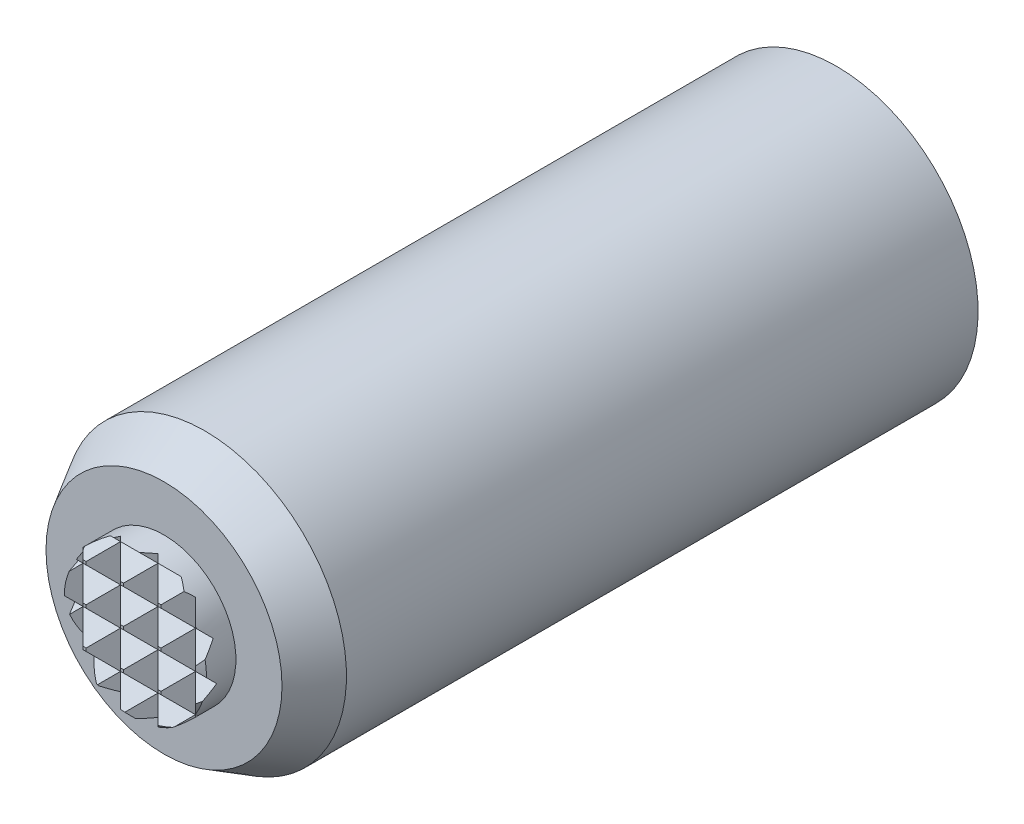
ISO-10303-21;
HEADER;
FILE_DESCRIPTION(('STEP AP214'),'2;1');
FILE_NAME('part.step','',(''),(''),'','','');
FILE_SCHEMA(('AUTOMOTIVE_DESIGN { 1 0 10303 214 1 1 1 1 }'));
ENDSEC;
DATA;
#1=APPLICATION_CONTEXT('core data for automotive mechanical design processes');
#2=APPLICATION_PROTOCOL_DEFINITION('international standard','automotive_design',2000,#1);
#3=PRODUCT_CONTEXT('',#1,'mechanical');
#4=PRODUCT('Part','Part','',(#3));
#5=PRODUCT_RELATED_PRODUCT_CATEGORY('part','',(#4));
#6=PRODUCT_DEFINITION_FORMATION('','',#4);
#7=PRODUCT_DEFINITION_CONTEXT('part definition',#1,'design');
#8=PRODUCT_DEFINITION('design','',#6,#7);
#9=PRODUCT_DEFINITION_SHAPE('','',#8);
#10=(LENGTH_UNIT() NAMED_UNIT(*) SI_UNIT(.MILLI.,.METRE.));
#11=(NAMED_UNIT(*) PLANE_ANGLE_UNIT() SI_UNIT($,.RADIAN.));
#12=(NAMED_UNIT(*) SI_UNIT($,.STERADIAN.) SOLID_ANGLE_UNIT());
#13=UNCERTAINTY_MEASURE_WITH_UNIT(LENGTH_MEASURE(1.E-05),#10,'distance_accuracy_value','');
#14=(GEOMETRIC_REPRESENTATION_CONTEXT(3) GLOBAL_UNCERTAINTY_ASSIGNED_CONTEXT((#13)) GLOBAL_UNIT_ASSIGNED_CONTEXT((#10,
#11,#12)) REPRESENTATION_CONTEXT('',''));
#15=CARTESIAN_POINT('',(0.,0.,0.));
#16=DIRECTION('',(0.,0.,1.));
#17=DIRECTION('',(1.,0.,0.));
#18=AXIS2_PLACEMENT_3D('',#15,#16,#17);
#19=CARTESIAN_POINT('',(0.,0.,-6.50368));
#20=DIRECTION('',(0.,0.,1.));
#21=DIRECTION('',(0.,1.,0.));
#22=AXIS2_PLACEMENT_3D('',#19,#20,#21);
#23=CYLINDRICAL_SURFACE('',#22,6.);
#24=CARTESIAN_POINT('',(0.,0.,26.7642691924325));
#25=DIRECTION('',(0.,0.,1.));
#26=DIRECTION('',(0.,1.,0.));
#27=AXIS2_PLACEMENT_3D('',#24,#25,#26);
#28=CIRCLE('',#27,6.);
#29=CARTESIAN_POINT('',(-2.45137243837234E-13,6.,26.7642691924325));
#30=VERTEX_POINT('',#29);
#31=EDGE_CURVE('E18',#30,#30,#28,.T.);
#32=ORIENTED_EDGE('',*,*,#31,.F.);
#33=EDGE_LOOP('',(#32));
#34=FACE_BOUND('',#33,.T.);
#35=CARTESIAN_POINT('',(0.,0.,0.));
#36=DIRECTION('',(0.,0.,-1.));
#37=DIRECTION('',(0.915871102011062,-0.401472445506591,0.));
#38=AXIS2_PLACEMENT_3D('',#35,#36,#37);
#39=CIRCLE('',#38,6.);
#40=CARTESIAN_POINT('',(5.49522661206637,-2.40883467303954,0.));
#41=VERTEX_POINT('',#40);
#42=EDGE_CURVE('E1646',#41,#41,#39,.T.);
#43=ORIENTED_EDGE('',*,*,#42,.F.);
#44=EDGE_LOOP('',(#43));
#45=FACE_BOUND('',#44,.T.);
#46=ADVANCED_FACE('F14',(#34,#45),#23,.T.);
#47=CARTESIAN_POINT('',(0.,0.,30.));
#48=DIRECTION('',(0.,0.,1.));
#49=DIRECTION('',(0.,1.,0.));
#50=AXIS2_PLACEMENT_3D('',#47,#48,#49);
#51=PLANE('',#50);
#52=DIRECTION('',(-1.,0.,0.));
#53=VECTOR('',#52,1.);
#54=CARTESIAN_POINT('',(-3.50012000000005,0.336549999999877,30.));
#55=LINE('',#54,#53);
#56=CARTESIAN_POINT('',(-0.209550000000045,0.33655,30.));
#57=VERTEX_POINT('',#56);
#58=CARTESIAN_POINT('',(-0.33655000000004,0.336549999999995,30.));
#59=VERTEX_POINT('',#58);
#60=EDGE_CURVE('E374',#57,#59,#55,.T.);
#61=ORIENTED_EDGE('',*,*,#60,.T.);
#62=DIRECTION('',(0.,1.,0.));
#63=VECTOR('',#62,1.);
#64=CARTESIAN_POINT('',(-0.336549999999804,-3.50012,30.));
#65=LINE('',#64,#63);
#66=CARTESIAN_POINT('',(-0.336549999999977,0.209549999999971,30.));
#67=VERTEX_POINT('',#66);
#68=EDGE_CURVE('E351',#59,#67,#65,.F.);
#69=ORIENTED_EDGE('',*,*,#68,.T.);
#70=DIRECTION('',(-1.,0.,0.));
#71=VECTOR('',#70,1.);
#72=CARTESIAN_POINT('',(-3.50012,0.209549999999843,30.));
#73=LINE('',#72,#71);
#74=CARTESIAN_POINT('',(-0.209549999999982,0.209549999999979,30.));
#75=VERTEX_POINT('',#74);
#76=EDGE_CURVE('E344',#67,#75,#73,.F.);
#77=ORIENTED_EDGE('',*,*,#76,.T.);
#78=DIRECTION('',(0.,1.,0.));
#79=VECTOR('',#78,1.);
#80=CARTESIAN_POINT('',(-0.209549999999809,-3.50012,30.));
#81=LINE('',#80,#79);
#82=EDGE_CURVE('E349',#75,#57,#81,.T.);
#83=ORIENTED_EDGE('',*,*,#82,.T.);
#84=EDGE_LOOP('',(#61,#69,#77,#83));
#85=FACE_BOUND('',#84,.T.);
#86=ADVANCED_FACE('F347',(#85),#51,.T.);
#87=CARTESIAN_POINT('',(-3.50012,-0.520700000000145,29.26975));
#88=DIRECTION('',(0.,0.707106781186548,-0.707106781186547));
#89=DIRECTION('',(0.,-0.707106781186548,-0.707106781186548));
#90=AXIS2_PLACEMENT_3D('',#87,#88,#89);
#91=PLANE('',#90);
#92=DIRECTION('',(-0.577350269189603,-0.577350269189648,-0.577350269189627));
#93=VECTOR('',#92,1.);
#94=CARTESIAN_POINT('',(-0.336549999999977,0.209549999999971,30.));
#95=LINE('',#94,#93);
#96=CARTESIAN_POINT('',(-1.06679999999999,-0.520700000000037,29.26975));
#97=VERTEX_POINT('',#96);
#98=EDGE_CURVE('E380',#67,#97,#95,.T.);
#99=ORIENTED_EDGE('',*,*,#98,.T.);
#100=DIRECTION('',(-1.,0.,0.));
#101=VECTOR('',#100,1.);
#102=CARTESIAN_POINT('',(-3.50012,-0.520700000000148,29.26975));
#103=LINE('',#102,#101);
#104=CARTESIAN_POINT('',(0.520700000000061,-0.5207,29.26975));
#105=VERTEX_POINT('',#104);
#106=EDGE_CURVE('E359',#97,#105,#103,.F.);
#107=ORIENTED_EDGE('',*,*,#106,.T.);
#108=DIRECTION('',(-0.577350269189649,0.577350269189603,0.577350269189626));
#109=VECTOR('',#108,1.);
#110=CARTESIAN_POINT('',(0.520700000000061,-0.5207,29.26975));
#111=LINE('',#110,#109);
#112=EDGE_CURVE('E356',#105,#75,#111,.T.);
#113=ORIENTED_EDGE('',*,*,#112,.T.);
#114=ORIENTED_EDGE('',*,*,#76,.F.);
#115=EDGE_LOOP('',(#99,#107,#113,#114));
#116=FACE_BOUND('',#115,.T.);
#117=ADVANCED_FACE('F357',(#116),#91,.F.);
#118=CARTESIAN_POINT('',(-1.06679999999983,-3.50012000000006,29.26975));
#119=DIRECTION('',(0.707106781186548,0.,-0.707106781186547));
#120=DIRECTION('',(-0.707106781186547,0.,-0.707106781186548));
#121=AXIS2_PLACEMENT_3D('',#118,#119,#120);
#122=PLANE('',#121);
#123=ORIENTED_EDGE('',*,*,#98,.F.);
#124=ORIENTED_EDGE('',*,*,#68,.F.);
#125=DIRECTION('',(-0.57735026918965,0.577350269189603,-0.577350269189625));
#126=VECTOR('',#125,1.);
#127=CARTESIAN_POINT('',(-0.33655000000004,0.336549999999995,30.));
#128=LINE('',#127,#126);
#129=CARTESIAN_POINT('',(-1.0668,1.06679999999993,29.26975));
#130=VERTEX_POINT('',#129);
#131=EDGE_CURVE('E376',#59,#130,#128,.T.);
#132=ORIENTED_EDGE('',*,*,#131,.T.);
#133=DIRECTION('',(0.,1.,0.));
#134=VECTOR('',#133,1.);
#135=CARTESIAN_POINT('',(-1.06679999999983,-3.50012000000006,29.26975));
#136=LINE('',#135,#134);
#137=EDGE_CURVE('E367',#130,#97,#136,.F.);
#138=ORIENTED_EDGE('',*,*,#137,.T.);
#139=EDGE_LOOP('',(#123,#124,#132,#138));
#140=FACE_BOUND('',#139,.T.);
#141=ADVANCED_FACE('F1124',(#140),#122,.F.);
#142=CARTESIAN_POINT('',(-3.50012000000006,1.06679999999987,29.26975));
#143=DIRECTION('',(0.,-0.707106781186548,-0.707106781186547));
#144=DIRECTION('',(0.,-0.707106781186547,0.707106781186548));
#145=AXIS2_PLACEMENT_3D('',#142,#143,#144);
#146=PLANE('',#145);
#147=DIRECTION('',(0.577350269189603,0.577350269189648,-0.577350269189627));
#148=VECTOR('',#147,1.);
#149=CARTESIAN_POINT('',(-0.209550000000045,0.33655,30.));
#150=LINE('',#149,#148);
#151=CARTESIAN_POINT('',(0.520699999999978,1.0668,29.26975));
#152=VERTEX_POINT('',#151);
#153=EDGE_CURVE('E363',#57,#152,#150,.T.);
#154=ORIENTED_EDGE('',*,*,#153,.T.);
#155=DIRECTION('',(-1.,0.,0.));
#156=VECTOR('',#155,1.);
#157=CARTESIAN_POINT('',(-3.50012000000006,1.06679999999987,29.26975));
#158=LINE('',#157,#156);
#159=EDGE_CURVE('E1414',#152,#130,#158,.T.);
#160=ORIENTED_EDGE('',*,*,#159,.T.);
#161=ORIENTED_EDGE('',*,*,#131,.F.);
#162=ORIENTED_EDGE('',*,*,#60,.F.);
#163=EDGE_LOOP('',(#154,#160,#161,#162));
#164=FACE_BOUND('',#163,.T.);
#165=ADVANCED_FACE('F1127',(#164),#146,.F.);
#166=CARTESIAN_POINT('',(0.520700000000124,-3.50012,29.26975));
#167=DIRECTION('',(-0.707106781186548,0.,-0.707106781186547));
#168=DIRECTION('',(-0.707106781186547,0.,0.707106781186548));
#169=AXIS2_PLACEMENT_3D('',#166,#167,#168);
#170=PLANE('',#169);
#171=ORIENTED_EDGE('',*,*,#112,.F.);
#172=DIRECTION('',(0.,1.,0.));
#173=VECTOR('',#172,1.);
#174=CARTESIAN_POINT('',(0.520700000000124,-3.50012,29.26975));
#175=LINE('',#174,#173);
#176=EDGE_CURVE('E1412',#105,#152,#175,.T.);
#177=ORIENTED_EDGE('',*,*,#176,.T.);
#178=ORIENTED_EDGE('',*,*,#153,.F.);
#179=ORIENTED_EDGE('',*,*,#82,.F.);
#180=EDGE_LOOP('',(#171,#177,#178,#179));
#181=FACE_BOUND('',#180,.T.);
#182=ADVANCED_FACE('F365',(#181),#170,.F.);
#183=CARTESIAN_POINT('',(-3.50012,-0.520700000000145,29.26975));
#184=DIRECTION('',(0.,-0.707106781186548,-0.707106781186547));
#185=DIRECTION('',(0.,-0.707106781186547,0.707106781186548));
#186=AXIS2_PLACEMENT_3D('',#183,#184,#185);
#187=PLANE('',#186);
#188=DIRECTION('',(0.577350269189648,-0.577350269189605,0.577350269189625));
#189=VECTOR('',#188,1.);
#190=CARTESIAN_POINT('',(-1.06679999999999,-0.520700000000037,29.26975));
#191=LINE('',#190,#189);
#192=CARTESIAN_POINT('',(-0.33654999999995,-1.25095000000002,30.));
#193=VERTEX_POINT('',#192);
#194=EDGE_CURVE('E1355',#97,#193,#191,.T.);
#195=ORIENTED_EDGE('',*,*,#194,.T.);
#196=DIRECTION('',(-1.,0.,0.));
#197=VECTOR('',#196,1.);
#198=CARTESIAN_POINT('',(0.,-1.25095,30.));
#199=LINE('',#198,#197);
#200=CARTESIAN_POINT('',(-0.209549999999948,-1.25095,30.));
#201=VERTEX_POINT('',#200);
#202=EDGE_CURVE('E1382',#201,#193,#199,.T.);
#203=ORIENTED_EDGE('',*,*,#202,.F.);
#204=DIRECTION('',(0.577350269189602,0.577350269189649,-0.577350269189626));
#205=VECTOR('',#204,1.);
#206=CARTESIAN_POINT('',(-0.209549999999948,-1.25095,30.));
#207=LINE('',#206,#205);
#208=EDGE_CURVE('E1363',#201,#105,#207,.T.);
#209=ORIENTED_EDGE('',*,*,#208,.T.);
#210=ORIENTED_EDGE('',*,*,#106,.F.);
#211=EDGE_LOOP('',(#195,#203,#209,#210));
#212=FACE_BOUND('',#211,.T.);
#213=ADVANCED_FACE('F1134',(#212),#187,.F.);
#214=CARTESIAN_POINT('',(-1.06679999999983,-3.50012000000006,29.26975));
#215=DIRECTION('',(-0.707106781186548,0.,-0.707106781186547));
#216=DIRECTION('',(-0.707106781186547,0.,0.707106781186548));
#217=AXIS2_PLACEMENT_3D('',#214,#215,#216);
#218=PLANE('',#217);
#219=DIRECTION('',(0.577350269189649,-0.577350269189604,-0.577350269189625));
#220=VECTOR('',#219,1.);
#221=CARTESIAN_POINT('',(-1.79705000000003,0.209549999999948,30.));
#222=LINE('',#221,#220);
#223=CARTESIAN_POINT('',(-1.79705000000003,0.209549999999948,30.));
#224=VERTEX_POINT('',#223);
#225=EDGE_CURVE('E1338',#224,#97,#222,.T.);
#226=ORIENTED_EDGE('',*,*,#225,.T.);
#227=ORIENTED_EDGE('',*,*,#137,.F.);
#228=DIRECTION('',(-0.577350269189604,-0.577350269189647,0.577350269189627));
#229=VECTOR('',#228,1.);
#230=CARTESIAN_POINT('',(-1.0668,1.06679999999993,29.26975));
#231=LINE('',#230,#229);
#232=CARTESIAN_POINT('',(-1.79705,0.336549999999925,30.));
#233=VERTEX_POINT('',#232);
#234=EDGE_CURVE('E1330',#130,#233,#231,.T.);
#235=ORIENTED_EDGE('',*,*,#234,.T.);
#236=DIRECTION('',(0.,1.,0.));
#237=VECTOR('',#236,1.);
#238=CARTESIAN_POINT('',(-1.79704999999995,0.,30.));
#239=LINE('',#238,#237);
#240=EDGE_CURVE('E1352',#224,#233,#239,.T.);
#241=ORIENTED_EDGE('',*,*,#240,.F.);
#242=EDGE_LOOP('',(#226,#227,#235,#241));
#243=FACE_BOUND('',#242,.T.);
#244=ADVANCED_FACE('F1137',(#243),#218,.F.);
#245=CARTESIAN_POINT('',(-3.50012000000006,1.06679999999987,29.26975));
#246=DIRECTION('',(0.,0.707106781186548,-0.707106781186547));
#247=DIRECTION('',(0.,-0.707106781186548,-0.707106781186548));
#248=AXIS2_PLACEMENT_3D('',#245,#246,#247);
#249=PLANE('',#248);
#250=DIRECTION('',(-0.577350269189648,0.577350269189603,0.577350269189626));
#251=VECTOR('',#250,1.);
#252=CARTESIAN_POINT('',(0.520699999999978,1.0668,29.26975));
#253=LINE('',#252,#251);
#254=CARTESIAN_POINT('',(-0.209550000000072,1.79705,30.));
#255=VERTEX_POINT('',#254);
#256=EDGE_CURVE('E1306',#152,#255,#253,.T.);
#257=ORIENTED_EDGE('',*,*,#256,.T.);
#258=DIRECTION('',(-1.,0.,0.));
#259=VECTOR('',#258,1.);
#260=CARTESIAN_POINT('',(0.,1.79705,30.));
#261=LINE('',#260,#259);
#262=CARTESIAN_POINT('',(-0.336550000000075,1.79705,30.));
#263=VERTEX_POINT('',#262);
#264=EDGE_CURVE('E1327',#263,#255,#261,.F.);
#265=ORIENTED_EDGE('',*,*,#264,.F.);
#266=DIRECTION('',(-0.577350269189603,-0.577350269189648,-0.577350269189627));
#267=VECTOR('',#266,1.);
#268=CARTESIAN_POINT('',(-0.336550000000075,1.79705,30.));
#269=LINE('',#268,#267);
#270=EDGE_CURVE('E1313',#263,#130,#269,.T.);
#271=ORIENTED_EDGE('',*,*,#270,.T.);
#272=ORIENTED_EDGE('',*,*,#159,.F.);
#273=EDGE_LOOP('',(#257,#265,#271,#272));
#274=FACE_BOUND('',#273,.T.);
#275=ADVANCED_FACE('F1141',(#274),#249,.F.);
#276=CARTESIAN_POINT('',(0.520700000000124,-3.50012,29.26975));
#277=DIRECTION('',(0.707106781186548,0.,-0.707106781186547));
#278=DIRECTION('',(-0.707106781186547,0.,-0.707106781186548));
#279=AXIS2_PLACEMENT_3D('',#276,#277,#278);
#280=PLANE('',#279);
#281=DIRECTION('',(0.577350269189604,0.577350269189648,0.577350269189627));
#282=VECTOR('',#281,1.);
#283=CARTESIAN_POINT('',(0.520700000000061,-0.5207,29.26975));
#284=LINE('',#283,#282);
#285=CARTESIAN_POINT('',(1.25094999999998,0.209550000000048,30.));
#286=VERTEX_POINT('',#285);
#287=EDGE_CURVE('E1397',#105,#286,#284,.T.);
#288=ORIENTED_EDGE('',*,*,#287,.T.);
#289=DIRECTION('',(0.,1.,0.));
#290=VECTOR('',#289,1.);
#291=CARTESIAN_POINT('',(1.25094999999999,0.,30.));
#292=LINE('',#291,#290);
#293=CARTESIAN_POINT('',(1.25095000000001,0.336550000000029,30.));
#294=VERTEX_POINT('',#293);
#295=EDGE_CURVE('E1383',#294,#286,#292,.F.);
#296=ORIENTED_EDGE('',*,*,#295,.F.);
#297=DIRECTION('',(-0.577350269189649,0.577350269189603,-0.577350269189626));
#298=VECTOR('',#297,1.);
#299=CARTESIAN_POINT('',(1.25095000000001,0.336550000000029,30.));
#300=LINE('',#299,#298);
#301=EDGE_CURVE('E1300',#294,#152,#300,.T.);
#302=ORIENTED_EDGE('',*,*,#301,.T.);
#303=ORIENTED_EDGE('',*,*,#176,.F.);
#304=EDGE_LOOP('',(#288,#296,#302,#303));
#305=FACE_BOUND('',#304,.T.);
#306=ADVANCED_FACE('F1145',(#305),#280,.F.);
#307=CARTESIAN_POINT('',(-3.50012,-0.520700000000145,29.26975));
#308=DIRECTION('',(0.,0.707106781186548,-0.707106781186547));
#309=DIRECTION('',(0.,-0.707106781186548,-0.707106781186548));
#310=AXIS2_PLACEMENT_3D('',#307,#308,#309);
#311=PLANE('',#310);
#312=ORIENTED_EDGE('',*,*,#287,.F.);
#313=DIRECTION('',(-1.,0.,0.));
#314=VECTOR('',#313,1.);
#315=CARTESIAN_POINT('',(-3.50012,-0.520700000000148,29.26975));
#316=LINE('',#315,#314);
#317=CARTESIAN_POINT('',(2.10820000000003,-0.52069999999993,29.26975));
#318=VERTEX_POINT('',#317);
#319=EDGE_CURVE('E1380',#105,#318,#316,.F.);
#320=ORIENTED_EDGE('',*,*,#319,.T.);
#321=DIRECTION('',(-0.577350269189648,0.577350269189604,0.577350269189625));
#322=VECTOR('',#321,1.);
#323=CARTESIAN_POINT('',(2.10820000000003,-0.52069999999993,29.26975));
#324=LINE('',#323,#322);
#325=CARTESIAN_POINT('',(1.37794999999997,0.209550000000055,30.));
#326=VERTEX_POINT('',#325);
#327=EDGE_CURVE('E948',#318,#326,#324,.T.);
#328=ORIENTED_EDGE('',*,*,#327,.T.);
#329=DIRECTION('',(-1.,0.,0.));
#330=VECTOR('',#329,1.);
#331=CARTESIAN_POINT('',(0.,0.209549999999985,30.));
#332=LINE('',#331,#330);
#333=EDGE_CURVE('E1394',#286,#326,#332,.F.);
#334=ORIENTED_EDGE('',*,*,#333,.F.);
#335=EDGE_LOOP('',(#312,#320,#328,#334));
#336=FACE_BOUND('',#335,.T.);
#337=ADVANCED_FACE('F1149',(#336),#311,.F.);
#338=CARTESIAN_POINT('',(0.,0.,30.));
#339=DIRECTION('',(0.,0.,1.));
#340=DIRECTION('',(0.,1.,0.));
#341=AXIS2_PLACEMENT_3D('',#338,#339,#340);
#342=PLANE('',#341);
#343=DIRECTION('',(-1.,0.,0.));
#344=VECTOR('',#343,1.);
#345=CARTESIAN_POINT('',(-3.50012000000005,0.336549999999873,30.));
#346=LINE('',#345,#344);
#347=CARTESIAN_POINT('',(1.37795,0.33655000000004,30.));
#348=VERTEX_POINT('',#347);
#349=EDGE_CURVE('E1294',#348,#294,#346,.T.);
#350=ORIENTED_EDGE('',*,*,#349,.T.);
#351=ORIENTED_EDGE('',*,*,#295,.T.);
#352=ORIENTED_EDGE('',*,*,#333,.T.);
#353=DIRECTION('',(0.,1.,0.));
#354=VECTOR('',#353,1.);
#355=CARTESIAN_POINT('',(1.37795000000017,-3.50012,30.));
#356=LINE('',#355,#354);
#357=EDGE_CURVE('E1290',#326,#348,#356,.T.);
#358=ORIENTED_EDGE('',*,*,#357,.T.);
#359=EDGE_LOOP('',(#350,#351,#352,#358));
#360=FACE_BOUND('',#359,.T.);
#361=ADVANCED_FACE('F1153',(#360),#342,.T.);
#362=CARTESIAN_POINT('',(-3.50012,-0.520700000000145,29.26975));
#363=DIRECTION('',(0.,-0.707106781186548,-0.707106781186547));
#364=DIRECTION('',(0.,-0.707106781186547,0.707106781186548));
#365=AXIS2_PLACEMENT_3D('',#362,#363,#364);
#366=PLANE('',#365);
#367=DIRECTION('',(0.577350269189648,-0.577350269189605,0.577350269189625));
#368=VECTOR('',#367,1.);
#369=CARTESIAN_POINT('',(0.520700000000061,-0.5207,29.26975));
#370=LINE('',#369,#368);
#371=CARTESIAN_POINT('',(1.25095000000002,-1.25094999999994,30.));
#372=VERTEX_POINT('',#371);
#373=EDGE_CURVE('E1386',#105,#372,#370,.T.);
#374=ORIENTED_EDGE('',*,*,#373,.T.);
#375=DIRECTION('',(-1.,0.,0.));
#376=VECTOR('',#375,1.);
#377=CARTESIAN_POINT('',(0.,-1.25095,30.));
#378=LINE('',#377,#376);
#379=CARTESIAN_POINT('',(1.37795000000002,-1.25094999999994,30.));
#380=VERTEX_POINT('',#379);
#381=EDGE_CURVE('E1374',#380,#372,#378,.T.);
#382=ORIENTED_EDGE('',*,*,#381,.F.);
#383=DIRECTION('',(0.577350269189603,0.577350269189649,-0.577350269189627));
#384=VECTOR('',#383,1.);
#385=CARTESIAN_POINT('',(1.37795000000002,-1.25094999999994,30.));
#386=LINE('',#385,#384);
#387=EDGE_CURVE('E1282',#380,#318,#386,.T.);
#388=ORIENTED_EDGE('',*,*,#387,.T.);
#389=ORIENTED_EDGE('',*,*,#319,.F.);
#390=EDGE_LOOP('',(#374,#382,#388,#389));
#391=FACE_BOUND('',#390,.T.);
#392=ADVANCED_FACE('F1157',(#391),#366,.F.);
#393=CARTESIAN_POINT('',(0.,0.,30.));
#394=DIRECTION('',(0.,0.,1.));
#395=DIRECTION('',(0.,1.,0.));
#396=AXIS2_PLACEMENT_3D('',#393,#394,#395);
#397=PLANE('',#396);
#398=ORIENTED_EDGE('',*,*,#202,.T.);
#399=DIRECTION('',(0.,1.,0.));
#400=VECTOR('',#399,1.);
#401=CARTESIAN_POINT('',(-0.336549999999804,-3.50012,30.));
#402=LINE('',#401,#400);
#403=CARTESIAN_POINT('',(-0.336549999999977,-1.37795,30.));
#404=VERTEX_POINT('',#403);
#405=EDGE_CURVE('E1357',#193,#404,#402,.F.);
#406=ORIENTED_EDGE('',*,*,#405,.T.);
#407=DIRECTION('',(-1.,0.,0.));
#408=VECTOR('',#407,1.);
#409=CARTESIAN_POINT('',(-3.50012,-1.37795000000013,30.));
#410=LINE('',#409,#408);
#411=CARTESIAN_POINT('',(-0.209549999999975,-1.37795,30.));
#412=VERTEX_POINT('',#411);
#413=EDGE_CURVE('E1366',#404,#412,#410,.F.);
#414=ORIENTED_EDGE('',*,*,#413,.T.);
#415=DIRECTION('',(0.,1.,0.));
#416=VECTOR('',#415,1.);
#417=CARTESIAN_POINT('',(-0.209549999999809,-3.50012,30.));
#418=LINE('',#417,#416);
#419=EDGE_CURVE('E1358',#412,#201,#418,.T.);
#420=ORIENTED_EDGE('',*,*,#419,.T.);
#421=EDGE_LOOP('',(#398,#406,#414,#420));
#422=FACE_BOUND('',#421,.T.);
#423=ADVANCED_FACE('F1161',(#422),#397,.T.);
#424=CARTESIAN_POINT('',(0.520700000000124,-3.50012,29.26975));
#425=DIRECTION('',(-0.707106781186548,0.,-0.707106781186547));
#426=DIRECTION('',(-0.707106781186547,0.,0.707106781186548));
#427=AXIS2_PLACEMENT_3D('',#424,#425,#426);
#428=PLANE('',#427);
#429=DIRECTION('',(0.577350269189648,-0.577350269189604,-0.577350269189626));
#430=VECTOR('',#429,1.);
#431=CARTESIAN_POINT('',(-0.209549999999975,-1.37795,30.));
#432=LINE('',#431,#430);
#433=CARTESIAN_POINT('',(0.520700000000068,-2.10819999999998,29.26975));
#434=VERTEX_POINT('',#433);
#435=EDGE_CURVE('E552',#412,#434,#432,.T.);
#436=ORIENTED_EDGE('',*,*,#435,.T.);
#437=DIRECTION('',(0.,1.,0.));
#438=VECTOR('',#437,1.);
#439=CARTESIAN_POINT('',(0.520700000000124,-3.50012,29.26975));
#440=LINE('',#439,#438);
#441=EDGE_CURVE('E1377',#434,#105,#440,.T.);
#442=ORIENTED_EDGE('',*,*,#441,.T.);
#443=ORIENTED_EDGE('',*,*,#208,.F.);
#444=ORIENTED_EDGE('',*,*,#419,.F.);
#445=EDGE_LOOP('',(#436,#442,#443,#444));
#446=FACE_BOUND('',#445,.T.);
#447=ADVANCED_FACE('F1165',(#446),#428,.F.);
#448=CARTESIAN_POINT('',(-1.06679999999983,-3.50012000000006,29.26975));
#449=DIRECTION('',(0.707106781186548,0.,-0.707106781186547));
#450=DIRECTION('',(-0.707106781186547,0.,-0.707106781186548));
#451=AXIS2_PLACEMENT_3D('',#448,#449,#450);
#452=PLANE('',#451);
#453=DIRECTION('',(0.577350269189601,0.577350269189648,0.577350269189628));
#454=VECTOR('',#453,1.);
#455=CARTESIAN_POINT('',(-1.06679999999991,-2.10820000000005,29.26975));
#456=LINE('',#455,#454);
#457=CARTESIAN_POINT('',(-1.06679999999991,-2.10820000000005,29.26975));
#458=VERTEX_POINT('',#457);
#459=EDGE_CURVE('E1368',#458,#404,#456,.T.);
#460=ORIENTED_EDGE('',*,*,#459,.T.);
#461=ORIENTED_EDGE('',*,*,#405,.F.);
#462=ORIENTED_EDGE('',*,*,#194,.F.);
#463=DIRECTION('',(0.,1.,0.));
#464=VECTOR('',#463,1.);
#465=CARTESIAN_POINT('',(-1.06679999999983,-3.50012000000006,29.26975));
#466=LINE('',#465,#464);
#467=EDGE_CURVE('E549',#97,#458,#466,.F.);
#468=ORIENTED_EDGE('',*,*,#467,.T.);
#469=EDGE_LOOP('',(#460,#461,#462,#468));
#470=FACE_BOUND('',#469,.T.);
#471=ADVANCED_FACE('F1169',(#470),#452,.F.);
#472=CARTESIAN_POINT('',(0.,0.,30.));
#473=DIRECTION('',(0.,0.,1.));
#474=DIRECTION('',(0.,1.,0.));
#475=AXIS2_PLACEMENT_3D('',#472,#473,#474);
#476=PLANE('',#475);
#477=DIRECTION('',(-1.,0.,0.));
#478=VECTOR('',#477,1.);
#479=CARTESIAN_POINT('',(-3.50012000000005,0.33654999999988,30.));
#480=LINE('',#479,#478);
#481=CARTESIAN_POINT('',(-1.92405,0.336549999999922,30.));
#482=VERTEX_POINT('',#481);
#483=EDGE_CURVE('E1332',#233,#482,#480,.T.);
#484=ORIENTED_EDGE('',*,*,#483,.T.);
#485=DIRECTION('',(0.,1.,0.));
#486=VECTOR('',#485,1.);
#487=CARTESIAN_POINT('',(-1.92404999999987,-3.50012000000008,30.));
#488=LINE('',#487,#486);
#489=CARTESIAN_POINT('',(-1.92405000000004,0.209549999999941,30.));
#490=VERTEX_POINT('',#489);
#491=EDGE_CURVE('E594',#482,#490,#488,.F.);
#492=ORIENTED_EDGE('',*,*,#491,.T.);
#493=DIRECTION('',(-1.,0.,0.));
#494=VECTOR('',#493,1.);
#495=CARTESIAN_POINT('',(-3.50012,0.209549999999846,30.));
#496=LINE('',#495,#494);
#497=EDGE_CURVE('E1333',#490,#224,#496,.F.);
#498=ORIENTED_EDGE('',*,*,#497,.T.);
#499=ORIENTED_EDGE('',*,*,#240,.T.);
#500=EDGE_LOOP('',(#484,#492,#498,#499));
#501=FACE_BOUND('',#500,.T.);
#502=ADVANCED_FACE('F1173',(#501),#476,.T.);
#503=CARTESIAN_POINT('',(-3.50012,-0.520700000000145,29.26975));
#504=DIRECTION('',(0.,0.707106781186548,-0.707106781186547));
#505=DIRECTION('',(0.,-0.707106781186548,-0.707106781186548));
#506=AXIS2_PLACEMENT_3D('',#503,#504,#505);
#507=PLANE('',#506);
#508=DIRECTION('',(-0.577350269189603,-0.577350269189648,-0.577350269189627));
#509=VECTOR('',#508,1.);
#510=CARTESIAN_POINT('',(-1.92405000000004,0.209549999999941,30.));
#511=LINE('',#510,#509);
#512=CARTESIAN_POINT('',(-2.65429999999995,-0.520700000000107,29.26975));
#513=VERTEX_POINT('',#512);
#514=EDGE_CURVE('E591',#490,#513,#511,.T.);
#515=ORIENTED_EDGE('',*,*,#514,.T.);
#516=DIRECTION('',(-1.,0.,0.));
#517=VECTOR('',#516,1.);
#518=CARTESIAN_POINT('',(-3.50012,-0.520700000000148,29.26975));
#519=LINE('',#518,#517);
#520=EDGE_CURVE('E546',#513,#97,#519,.F.);
#521=ORIENTED_EDGE('',*,*,#520,.T.);
#522=ORIENTED_EDGE('',*,*,#225,.F.);
#523=ORIENTED_EDGE('',*,*,#497,.F.);
#524=EDGE_LOOP('',(#515,#521,#522,#523));
#525=FACE_BOUND('',#524,.T.);
#526=ADVANCED_FACE('F1177',(#525),#507,.F.);
#527=CARTESIAN_POINT('',(-3.50012000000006,1.06679999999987,29.26975));
#528=DIRECTION('',(0.,-0.707106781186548,-0.707106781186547));
#529=DIRECTION('',(0.,-0.707106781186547,0.707106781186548));
#530=AXIS2_PLACEMENT_3D('',#527,#528,#529);
#531=PLANE('',#530);
#532=DIRECTION('',(0.577350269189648,-0.577350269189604,0.577350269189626));
#533=VECTOR('',#532,1.);
#534=CARTESIAN_POINT('',(-2.65430000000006,1.06679999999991,29.26975));
#535=LINE('',#534,#533);
#536=CARTESIAN_POINT('',(-2.65430000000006,1.06679999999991,29.26975));
#537=VERTEX_POINT('',#536);
#538=EDGE_CURVE('E574',#537,#482,#535,.T.);
#539=ORIENTED_EDGE('',*,*,#538,.T.);
#540=ORIENTED_EDGE('',*,*,#483,.F.);
#541=ORIENTED_EDGE('',*,*,#234,.F.);
#542=DIRECTION('',(-1.,0.,0.));
#543=VECTOR('',#542,1.);
#544=CARTESIAN_POINT('',(-3.50012000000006,1.06679999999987,29.26975));
#545=LINE('',#544,#543);
#546=EDGE_CURVE('E593',#130,#537,#545,.T.);
#547=ORIENTED_EDGE('',*,*,#546,.T.);
#548=EDGE_LOOP('',(#539,#540,#541,#547));
#549=FACE_BOUND('',#548,.T.);
#550=ADVANCED_FACE('F1181',(#549),#531,.F.);
#551=CARTESIAN_POINT('',(0.,0.,30.));
#552=DIRECTION('',(0.,0.,1.));
#553=DIRECTION('',(0.,1.,0.));
#554=AXIS2_PLACEMENT_3D('',#551,#552,#553);
#555=PLANE('',#554);
#556=ORIENTED_EDGE('',*,*,#264,.T.);
#557=DIRECTION('',(0.,1.,0.));
#558=VECTOR('',#557,1.);
#559=CARTESIAN_POINT('',(-0.209549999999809,-3.50012,30.));
#560=LINE('',#559,#558);
#561=CARTESIAN_POINT('',(-0.209550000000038,1.92404999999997,30.));
#562=VERTEX_POINT('',#561);
#563=EDGE_CURVE('E1303',#255,#562,#560,.T.);
#564=ORIENTED_EDGE('',*,*,#563,.T.);
#565=DIRECTION('',(-1.,0.,0.));
#566=VECTOR('',#565,1.);
#567=CARTESIAN_POINT('',(-3.50012000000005,1.92404999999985,30.));
#568=LINE('',#567,#566);
#569=CARTESIAN_POINT('',(-0.33655000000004,1.92404999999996,30.));
#570=VERTEX_POINT('',#569);
#571=EDGE_CURVE('E658',#562,#570,#568,.T.);
#572=ORIENTED_EDGE('',*,*,#571,.T.);
#573=DIRECTION('',(0.,1.,0.));
#574=VECTOR('',#573,1.);
#575=CARTESIAN_POINT('',(-0.336549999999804,-3.50012,30.));
#576=LINE('',#575,#574);
#577=EDGE_CURVE('E1308',#570,#263,#576,.F.);
#578=ORIENTED_EDGE('',*,*,#577,.T.);
#579=EDGE_LOOP('',(#556,#564,#572,#578));
#580=FACE_BOUND('',#579,.T.);
#581=ADVANCED_FACE('F1185',(#580),#555,.T.);
#582=CARTESIAN_POINT('',(-1.06679999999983,-3.50012000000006,29.26975));
#583=DIRECTION('',(0.707106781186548,0.,-0.707106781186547));
#584=DIRECTION('',(-0.707106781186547,0.,-0.707106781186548));
#585=AXIS2_PLACEMENT_3D('',#582,#583,#584);
#586=PLANE('',#585);
#587=DIRECTION('',(-0.577350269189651,0.577350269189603,-0.577350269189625));
#588=VECTOR('',#587,1.);
#589=CARTESIAN_POINT('',(-0.33655000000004,1.92404999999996,30.));
#590=LINE('',#589,#588);
#591=CARTESIAN_POINT('',(-1.06680000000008,2.65429999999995,29.26975));
#592=VERTEX_POINT('',#591);
#593=EDGE_CURVE('E655',#570,#592,#590,.T.);
#594=ORIENTED_EDGE('',*,*,#593,.T.);
#595=DIRECTION('',(0.,1.,0.));
#596=VECTOR('',#595,1.);
#597=CARTESIAN_POINT('',(-1.06679999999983,-3.50012000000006,29.26975));
#598=LINE('',#597,#596);
#599=EDGE_CURVE('E623',#592,#130,#598,.F.);
#600=ORIENTED_EDGE('',*,*,#599,.T.);
#601=ORIENTED_EDGE('',*,*,#270,.F.);
#602=ORIENTED_EDGE('',*,*,#577,.F.);
#603=EDGE_LOOP('',(#594,#600,#601,#602));
#604=FACE_BOUND('',#603,.T.);
#605=ADVANCED_FACE('F1189',(#604),#586,.F.);
#606=CARTESIAN_POINT('',(0.520700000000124,-3.50012,29.26975));
#607=DIRECTION('',(-0.707106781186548,0.,-0.707106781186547));
#608=DIRECTION('',(-0.707106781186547,0.,0.707106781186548));
#609=AXIS2_PLACEMENT_3D('',#606,#607,#608);
#610=PLANE('',#609);
#611=DIRECTION('',(-0.577350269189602,-0.577350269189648,0.577350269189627));
#612=VECTOR('',#611,1.);
#613=CARTESIAN_POINT('',(0.520699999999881,2.6543,29.26975));
#614=LINE('',#613,#612);
#615=CARTESIAN_POINT('',(0.520699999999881,2.6543,29.26975));
#616=VERTEX_POINT('',#615);
#617=EDGE_CURVE('E632',#616,#562,#614,.T.);
#618=ORIENTED_EDGE('',*,*,#617,.T.);
#619=ORIENTED_EDGE('',*,*,#563,.F.);
#620=ORIENTED_EDGE('',*,*,#256,.F.);
#621=DIRECTION('',(0.,1.,0.));
#622=VECTOR('',#621,1.);
#623=CARTESIAN_POINT('',(0.520700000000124,-3.50012,29.26975));
#624=LINE('',#623,#622);
#625=EDGE_CURVE('E657',#152,#616,#624,.T.);
#626=ORIENTED_EDGE('',*,*,#625,.T.);
#627=EDGE_LOOP('',(#618,#619,#620,#626));
#628=FACE_BOUND('',#627,.T.);
#629=ADVANCED_FACE('F1193',(#628),#610,.F.);
#630=CARTESIAN_POINT('',(-3.50012000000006,1.06679999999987,29.26975));
#631=DIRECTION('',(0.,-0.707106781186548,-0.707106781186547));
#632=DIRECTION('',(0.,-0.707106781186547,0.707106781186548));
#633=AXIS2_PLACEMENT_3D('',#630,#631,#632);
#634=PLANE('',#633);
#635=DIRECTION('',(0.577350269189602,0.57735026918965,-0.577350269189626));
#636=VECTOR('',#635,1.);
#637=CARTESIAN_POINT('',(1.37795,0.33655000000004,30.));
#638=LINE('',#637,#636);
#639=CARTESIAN_POINT('',(2.10819999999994,1.06680000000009,29.26975));
#640=VERTEX_POINT('',#639);
#641=EDGE_CURVE('E947',#348,#640,#638,.T.);
#642=ORIENTED_EDGE('',*,*,#641,.T.);
#643=DIRECTION('',(-1.,0.,0.));
#644=VECTOR('',#643,1.);
#645=CARTESIAN_POINT('',(-3.50012000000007,1.06679999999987,29.26975));
#646=LINE('',#645,#644);
#647=EDGE_CURVE('E676',#640,#152,#646,.T.);
#648=ORIENTED_EDGE('',*,*,#647,.T.);
#649=ORIENTED_EDGE('',*,*,#301,.F.);
#650=ORIENTED_EDGE('',*,*,#349,.F.);
#651=EDGE_LOOP('',(#642,#648,#649,#650));
#652=FACE_BOUND('',#651,.T.);
#653=ADVANCED_FACE('F1197',(#652),#634,.F.);
#654=CARTESIAN_POINT('',(2.1082000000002,-3.50011999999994,29.26975));
#655=DIRECTION('',(-0.707106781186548,0.,-0.707106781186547));
#656=DIRECTION('',(-0.707106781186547,0.,0.707106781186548));
#657=AXIS2_PLACEMENT_3D('',#654,#655,#656);
#658=PLANE('',#657);
#659=ORIENTED_EDGE('',*,*,#327,.F.);
#660=DIRECTION('',(0.,1.,0.));
#661=VECTOR('',#660,1.);
#662=CARTESIAN_POINT('',(2.1082000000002,-3.50011999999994,29.26975));
#663=LINE('',#662,#661);
#664=EDGE_CURVE('E695',#318,#640,#663,.T.);
#665=ORIENTED_EDGE('',*,*,#664,.T.);
#666=ORIENTED_EDGE('',*,*,#641,.F.);
#667=ORIENTED_EDGE('',*,*,#357,.F.);
#668=EDGE_LOOP('',(#659,#665,#666,#667));
#669=FACE_BOUND('',#668,.T.);
#670=ADVANCED_FACE('F945',(#669),#658,.F.);
#671=CARTESIAN_POINT('',(0.520700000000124,-3.50012,29.26975));
#672=DIRECTION('',(0.707106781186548,0.,-0.707106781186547));
#673=DIRECTION('',(-0.707106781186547,0.,-0.707106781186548));
#674=AXIS2_PLACEMENT_3D('',#671,#672,#673);
#675=PLANE('',#674);
#676=DIRECTION('',(0.577350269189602,0.577350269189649,0.577350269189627));
#677=VECTOR('',#676,1.);
#678=CARTESIAN_POINT('',(0.520700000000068,-2.10819999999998,29.26975));
#679=LINE('',#678,#677);
#680=CARTESIAN_POINT('',(1.25095000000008,-1.37794999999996,30.));
#681=VERTEX_POINT('',#680);
#682=EDGE_CURVE('E935',#434,#681,#679,.T.);
#683=ORIENTED_EDGE('',*,*,#682,.T.);
#684=DIRECTION('',(0.,1.,0.));
#685=VECTOR('',#684,1.);
#686=CARTESIAN_POINT('',(1.25094999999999,0.,30.));
#687=LINE('',#686,#685);
#688=EDGE_CURVE('E1286',#372,#681,#687,.F.);
#689=ORIENTED_EDGE('',*,*,#688,.F.);
#690=ORIENTED_EDGE('',*,*,#373,.F.);
#691=ORIENTED_EDGE('',*,*,#441,.F.);
#692=EDGE_LOOP('',(#683,#689,#690,#691));
#693=FACE_BOUND('',#692,.T.);
#694=ADVANCED_FACE('F1203',(#693),#675,.F.);
#695=CARTESIAN_POINT('',(0.,0.,30.));
#696=DIRECTION('',(0.,0.,1.));
#697=DIRECTION('',(0.,1.,0.));
#698=AXIS2_PLACEMENT_3D('',#695,#696,#697);
#699=PLANE('',#698);
#700=ORIENTED_EDGE('',*,*,#381,.T.);
#701=ORIENTED_EDGE('',*,*,#688,.T.);
#702=DIRECTION('',(-1.,0.,0.));
#703=VECTOR('',#702,1.);
#704=CARTESIAN_POINT('',(-3.50012,-1.37795000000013,30.));
#705=LINE('',#704,#703);
#706=CARTESIAN_POINT('',(1.37795000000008,-1.37794999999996,30.));
#707=VERTEX_POINT('',#706);
#708=EDGE_CURVE('E1750',#681,#707,#705,.F.);
#709=ORIENTED_EDGE('',*,*,#708,.T.);
#710=DIRECTION('',(0.,1.,0.));
#711=VECTOR('',#710,1.);
#712=CARTESIAN_POINT('',(1.37795000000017,-3.50012,30.));
#713=LINE('',#712,#711);
#714=EDGE_CURVE('E1285',#707,#380,#713,.T.);
#715=ORIENTED_EDGE('',*,*,#714,.T.);
#716=EDGE_LOOP('',(#700,#701,#709,#715));
#717=FACE_BOUND('',#716,.T.);
#718=ADVANCED_FACE('F1206',(#717),#699,.T.);
#719=CARTESIAN_POINT('',(2.1082000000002,-3.50011999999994,29.26975));
#720=DIRECTION('',(-0.707106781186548,0.,-0.707106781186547));
#721=DIRECTION('',(-0.707106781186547,0.,0.707106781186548));
#722=AXIS2_PLACEMENT_3D('',#719,#720,#721);
#723=PLANE('',#722);
#724=DIRECTION('',(0.57735026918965,-0.577350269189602,-0.577350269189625));
#725=VECTOR('',#724,1.);
#726=CARTESIAN_POINT('',(1.37795000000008,-1.37794999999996,30.));
#727=LINE('',#726,#725);
#728=CARTESIAN_POINT('',(2.10820000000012,-2.10819999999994,29.26975));
#729=VERTEX_POINT('',#728);
#730=EDGE_CURVE('E1060',#707,#729,#727,.T.);
#731=ORIENTED_EDGE('',*,*,#730,.T.);
#732=DIRECTION('',(0.,1.,0.));
#733=VECTOR('',#732,1.);
#734=CARTESIAN_POINT('',(2.1082000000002,-3.50011999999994,29.26975));
#735=LINE('',#734,#733);
#736=EDGE_CURVE('E927',#729,#318,#735,.T.);
#737=ORIENTED_EDGE('',*,*,#736,.T.);
#738=ORIENTED_EDGE('',*,*,#387,.F.);
#739=ORIENTED_EDGE('',*,*,#714,.F.);
#740=EDGE_LOOP('',(#731,#737,#738,#739));
#741=FACE_BOUND('',#740,.T.);
#742=ADVANCED_FACE('F1210',(#741),#723,.F.);
#743=CARTESIAN_POINT('',(-3.50012,-2.10820000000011,29.26975));
#744=DIRECTION('',(0.,0.707106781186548,-0.707106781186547));
#745=DIRECTION('',(0.,-0.707106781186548,-0.707106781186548));
#746=AXIS2_PLACEMENT_3D('',#743,#744,#745);
#747=PLANE('',#746);
#748=ORIENTED_EDGE('',*,*,#435,.F.);
#749=ORIENTED_EDGE('',*,*,#413,.F.);
#750=ORIENTED_EDGE('',*,*,#459,.F.);
#751=DIRECTION('',(-1.,0.,0.));
#752=VECTOR('',#751,1.);
#753=CARTESIAN_POINT('',(-3.50012,-2.10820000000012,29.26975));
#754=LINE('',#753,#752);
#755=EDGE_CURVE('E1057',#458,#434,#754,.F.);
#756=ORIENTED_EDGE('',*,*,#755,.T.);
#757=EDGE_LOOP('',(#748,#749,#750,#756));
#758=FACE_BOUND('',#757,.T.);
#759=ADVANCED_FACE('F1214',(#758),#747,.F.);
#760=CARTESIAN_POINT('',(-1.06679999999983,-3.50012000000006,29.26975));
#761=DIRECTION('',(-0.707106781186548,0.,-0.707106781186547));
#762=DIRECTION('',(-0.707106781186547,0.,0.707106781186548));
#763=AXIS2_PLACEMENT_3D('',#760,#761,#762);
#764=PLANE('',#763);
#765=DIRECTION('',(0.57735026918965,-0.577350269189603,-0.577350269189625));
#766=VECTOR('',#765,1.);
#767=CARTESIAN_POINT('',(-1.79704999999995,-1.37795000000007,30.));
#768=LINE('',#767,#766);
#769=CARTESIAN_POINT('',(-1.79704999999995,-1.37795000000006,30.));
#770=VERTEX_POINT('',#769);
#771=EDGE_CURVE('E555',#770,#458,#768,.T.);
#772=ORIENTED_EDGE('',*,*,#771,.T.);
#773=ORIENTED_EDGE('',*,*,#467,.F.);
#774=DIRECTION('',(-0.577350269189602,-0.577350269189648,0.577350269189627));
#775=VECTOR('',#774,1.);
#776=CARTESIAN_POINT('',(-1.06679999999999,-0.520700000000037,29.26975));
#777=LINE('',#776,#775);
#778=CARTESIAN_POINT('',(-1.79704999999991,-1.25095000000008,30.));
#779=VERTEX_POINT('',#778);
#780=EDGE_CURVE('E551',#97,#779,#777,.T.);
#781=ORIENTED_EDGE('',*,*,#780,.T.);
#782=DIRECTION('',(0.,1.,0.));
#783=VECTOR('',#782,1.);
#784=CARTESIAN_POINT('',(-1.79704999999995,0.,30.));
#785=LINE('',#784,#783);
#786=EDGE_CURVE('E542',#770,#779,#785,.T.);
#787=ORIENTED_EDGE('',*,*,#786,.F.);
#788=EDGE_LOOP('',(#772,#773,#781,#787));
#789=FACE_BOUND('',#788,.T.);
#790=ADVANCED_FACE('F1218',(#789),#764,.F.);
#791=CARTESIAN_POINT('',(-3.50012,-0.520700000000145,29.26975));
#792=DIRECTION('',(0.,-0.707106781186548,-0.707106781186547));
#793=DIRECTION('',(0.,-0.707106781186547,0.707106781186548));
#794=AXIS2_PLACEMENT_3D('',#791,#792,#793);
#795=PLANE('',#794);
#796=DIRECTION('',(0.577350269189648,-0.577350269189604,0.577350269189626));
#797=VECTOR('',#796,1.);
#798=CARTESIAN_POINT('',(-2.65429999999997,-0.52070000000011,29.26975));
#799=LINE('',#798,#797);
#800=CARTESIAN_POINT('',(-1.92404999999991,-1.25095000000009,30.));
#801=VERTEX_POINT('',#800);
#802=EDGE_CURVE('E581',#513,#801,#799,.T.);
#803=ORIENTED_EDGE('',*,*,#802,.T.);
#804=DIRECTION('',(-1.,0.,0.));
#805=VECTOR('',#804,1.);
#806=CARTESIAN_POINT('',(0.,-1.25095,30.));
#807=LINE('',#806,#805);
#808=EDGE_CURVE('E545',#779,#801,#807,.T.);
#809=ORIENTED_EDGE('',*,*,#808,.F.);
#810=ORIENTED_EDGE('',*,*,#780,.F.);
#811=ORIENTED_EDGE('',*,*,#520,.F.);
#812=EDGE_LOOP('',(#803,#809,#810,#811));
#813=FACE_BOUND('',#812,.T.);
#814=ADVANCED_FACE('F1222',(#813),#795,.F.);
#815=CARTESIAN_POINT('',(0.,0.,30.));
#816=DIRECTION('',(0.,0.,1.));
#817=DIRECTION('',(0.,1.,0.));
#818=AXIS2_PLACEMENT_3D('',#815,#816,#817);
#819=PLANE('',#818);
#820=ORIENTED_EDGE('',*,*,#808,.T.);
#821=DIRECTION('',(0.,1.,0.));
#822=VECTOR('',#821,1.);
#823=CARTESIAN_POINT('',(-1.92404999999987,-3.50012000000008,30.));
#824=LINE('',#823,#822);
#825=CARTESIAN_POINT('',(-1.92404999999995,-1.37795000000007,30.));
#826=VERTEX_POINT('',#825);
#827=EDGE_CURVE('E577',#801,#826,#824,.F.);
#828=ORIENTED_EDGE('',*,*,#827,.T.);
#829=DIRECTION('',(-1.,0.,0.));
#830=VECTOR('',#829,1.);
#831=CARTESIAN_POINT('',(-3.50012,-1.37795000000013,30.));
#832=LINE('',#831,#830);
#833=EDGE_CURVE('E559',#826,#770,#832,.F.);
#834=ORIENTED_EDGE('',*,*,#833,.T.);
#835=ORIENTED_EDGE('',*,*,#786,.T.);
#836=EDGE_LOOP('',(#820,#828,#834,#835));
#837=FACE_BOUND('',#836,.T.);
#838=ADVANCED_FACE('F1226',(#837),#819,.T.);
#839=CARTESIAN_POINT('',(-2.65429999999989,-3.50012000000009,29.26975));
#840=DIRECTION('',(0.707106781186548,0.,-0.707106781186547));
#841=DIRECTION('',(-0.707106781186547,0.,-0.707106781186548));
#842=AXIS2_PLACEMENT_3D('',#839,#840,#841);
#843=PLANE('',#842);
#844=ORIENTED_EDGE('',*,*,#514,.F.);
#845=ORIENTED_EDGE('',*,*,#491,.F.);
#846=ORIENTED_EDGE('',*,*,#538,.F.);
#847=DIRECTION('',(0.,1.,0.));
#848=VECTOR('',#847,1.);
#849=CARTESIAN_POINT('',(-2.65429999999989,-3.50012000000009,29.26975));
#850=LINE('',#849,#848);
#851=EDGE_CURVE('E601',#537,#513,#850,.F.);
#852=ORIENTED_EDGE('',*,*,#851,.T.);
#853=EDGE_LOOP('',(#844,#845,#846,#852));
#854=FACE_BOUND('',#853,.T.);
#855=ADVANCED_FACE('F1230',(#854),#843,.F.);
#856=CARTESIAN_POINT('',(-3.50012000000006,1.06679999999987,29.26975));
#857=DIRECTION('',(0.,0.707106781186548,-0.707106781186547));
#858=DIRECTION('',(0.,-0.707106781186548,-0.707106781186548));
#859=AXIS2_PLACEMENT_3D('',#856,#857,#858);
#860=PLANE('',#859);
#861=DIRECTION('',(-0.577350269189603,-0.577350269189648,-0.577350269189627));
#862=VECTOR('',#861,1.);
#863=CARTESIAN_POINT('',(-1.92405000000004,1.79704999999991,30.));
#864=LINE('',#863,#862);
#865=CARTESIAN_POINT('',(-1.92405000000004,1.79704999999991,30.));
#866=VERTEX_POINT('',#865);
#867=EDGE_CURVE('E612',#866,#537,#864,.T.);
#868=ORIENTED_EDGE('',*,*,#867,.T.);
#869=ORIENTED_EDGE('',*,*,#546,.F.);
#870=DIRECTION('',(-0.577350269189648,0.577350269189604,0.577350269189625));
#871=VECTOR('',#870,1.);
#872=CARTESIAN_POINT('',(-1.0668,1.06679999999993,29.26975));
#873=LINE('',#872,#871);
#874=CARTESIAN_POINT('',(-1.79705000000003,1.79704999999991,30.));
#875=VERTEX_POINT('',#874);
#876=EDGE_CURVE('E609',#130,#875,#873,.T.);
#877=ORIENTED_EDGE('',*,*,#876,.T.);
#878=DIRECTION('',(-1.,0.,0.));
#879=VECTOR('',#878,1.);
#880=CARTESIAN_POINT('',(0.,1.79705,30.));
#881=LINE('',#880,#879);
#882=EDGE_CURVE('E619',#866,#875,#881,.F.);
#883=ORIENTED_EDGE('',*,*,#882,.F.);
#884=EDGE_LOOP('',(#868,#869,#877,#883));
#885=FACE_BOUND('',#884,.T.);
#886=ADVANCED_FACE('F1234',(#885),#860,.F.);
#887=CARTESIAN_POINT('',(-1.06679999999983,-3.50012000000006,29.26975));
#888=DIRECTION('',(-0.707106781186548,0.,-0.707106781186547));
#889=DIRECTION('',(-0.707106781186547,0.,0.707106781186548));
#890=AXIS2_PLACEMENT_3D('',#887,#888,#889);
#891=PLANE('',#890);
#892=DIRECTION('',(-0.577350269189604,-0.577350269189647,0.577350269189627));
#893=VECTOR('',#892,1.);
#894=CARTESIAN_POINT('',(-1.06680000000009,2.65429999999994,29.26975));
#895=LINE('',#894,#893);
#896=CARTESIAN_POINT('',(-1.7970500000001,1.92404999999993,30.));
#897=VERTEX_POINT('',#896);
#898=EDGE_CURVE('E639',#592,#897,#895,.T.);
#899=ORIENTED_EDGE('',*,*,#898,.T.);
#900=DIRECTION('',(0.,1.,0.));
#901=VECTOR('',#900,1.);
#902=CARTESIAN_POINT('',(-1.79704999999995,0.,30.));
#903=LINE('',#902,#901);
#904=EDGE_CURVE('E622',#875,#897,#903,.T.);
#905=ORIENTED_EDGE('',*,*,#904,.F.);
#906=ORIENTED_EDGE('',*,*,#876,.F.);
#907=ORIENTED_EDGE('',*,*,#599,.F.);
#908=EDGE_LOOP('',(#899,#905,#906,#907));
#909=FACE_BOUND('',#908,.T.);
#910=ADVANCED_FACE('F1238',(#909),#891,.F.);
#911=CARTESIAN_POINT('',(0.,0.,30.));
#912=DIRECTION('',(0.,0.,1.));
#913=DIRECTION('',(0.,1.,0.));
#914=AXIS2_PLACEMENT_3D('',#911,#912,#913);
#915=PLANE('',#914);
#916=ORIENTED_EDGE('',*,*,#882,.T.);
#917=ORIENTED_EDGE('',*,*,#904,.T.);
#918=DIRECTION('',(-1.,0.,0.));
#919=VECTOR('',#918,1.);
#920=CARTESIAN_POINT('',(-3.50012000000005,1.92404999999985,30.));
#921=LINE('',#920,#919);
#922=CARTESIAN_POINT('',(-1.9240500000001,1.92404999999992,30.));
#923=VERTEX_POINT('',#922);
#924=EDGE_CURVE('E635',#897,#923,#921,.T.);
#925=ORIENTED_EDGE('',*,*,#924,.T.);
#926=DIRECTION('',(0.,1.,0.));
#927=VECTOR('',#926,1.);
#928=CARTESIAN_POINT('',(-1.92404999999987,-3.50012000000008,30.));
#929=LINE('',#928,#927);
#930=EDGE_CURVE('E642',#923,#866,#929,.F.);
#931=ORIENTED_EDGE('',*,*,#930,.T.);
#932=EDGE_LOOP('',(#916,#917,#925,#931));
#933=FACE_BOUND('',#932,.T.);
#934=ADVANCED_FACE('F1242',(#933),#915,.T.);
#935=CARTESIAN_POINT('',(-3.50012000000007,2.65429999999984,29.26975));
#936=DIRECTION('',(0.,-0.707106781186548,-0.707106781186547));
#937=DIRECTION('',(0.,-0.707106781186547,0.707106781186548));
#938=AXIS2_PLACEMENT_3D('',#935,#936,#937);
#939=PLANE('',#938);
#940=ORIENTED_EDGE('',*,*,#593,.F.);
#941=ORIENTED_EDGE('',*,*,#571,.F.);
#942=ORIENTED_EDGE('',*,*,#617,.F.);
#943=DIRECTION('',(-1.,0.,0.));
#944=VECTOR('',#943,1.);
#945=CARTESIAN_POINT('',(-3.50012000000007,2.65429999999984,29.26975));
#946=LINE('',#945,#944);
#947=EDGE_CURVE('E665',#616,#592,#946,.T.);
#948=ORIENTED_EDGE('',*,*,#947,.T.);
#949=EDGE_LOOP('',(#940,#941,#942,#948));
#950=FACE_BOUND('',#949,.T.);
#951=ADVANCED_FACE('F1246',(#950),#939,.F.);
#952=CARTESIAN_POINT('',(0.520700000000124,-3.50012,29.26975));
#953=DIRECTION('',(0.707106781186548,0.,-0.707106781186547));
#954=DIRECTION('',(-0.707106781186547,0.,-0.707106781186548));
#955=AXIS2_PLACEMENT_3D('',#952,#953,#954);
#956=PLANE('',#955);
#957=DIRECTION('',(-0.577350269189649,0.577350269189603,-0.577350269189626));
#958=VECTOR('',#957,1.);
#959=CARTESIAN_POINT('',(1.25094999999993,1.92405000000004,30.));
#960=LINE('',#959,#958);
#961=CARTESIAN_POINT('',(1.25094999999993,1.92405000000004,30.));
#962=VERTEX_POINT('',#961);
#963=EDGE_CURVE('E682',#962,#616,#960,.T.);
#964=ORIENTED_EDGE('',*,*,#963,.T.);
#965=ORIENTED_EDGE('',*,*,#625,.F.);
#966=DIRECTION('',(0.577350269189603,0.577350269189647,0.577350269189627));
#967=VECTOR('',#966,1.);
#968=CARTESIAN_POINT('',(0.520699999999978,1.0668,29.26975));
#969=LINE('',#968,#967);
#970=CARTESIAN_POINT('',(1.2509499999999,1.79705000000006,30.));
#971=VERTEX_POINT('',#970);
#972=EDGE_CURVE('E218',#152,#971,#969,.T.);
#973=ORIENTED_EDGE('',*,*,#972,.T.);
#974=DIRECTION('',(0.,1.,0.));
#975=VECTOR('',#974,1.);
#976=CARTESIAN_POINT('',(1.25094999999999,0.,30.));
#977=LINE('',#976,#975);
#978=EDGE_CURVE('E672',#962,#971,#977,.F.);
#979=ORIENTED_EDGE('',*,*,#978,.F.);
#980=EDGE_LOOP('',(#964,#965,#973,#979));
#981=FACE_BOUND('',#980,.T.);
#982=ADVANCED_FACE('F1250',(#981),#956,.F.);
#983=CARTESIAN_POINT('',(-3.50012000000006,1.06679999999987,29.26975));
#984=DIRECTION('',(0.,0.707106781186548,-0.707106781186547));
#985=DIRECTION('',(0.,-0.707106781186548,-0.707106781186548));
#986=AXIS2_PLACEMENT_3D('',#983,#984,#985);
#987=PLANE('',#986);
#988=DIRECTION('',(-0.57735026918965,0.5773502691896,0.577350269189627));
#989=VECTOR('',#988,1.);
#990=CARTESIAN_POINT('',(2.10819999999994,1.06680000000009,29.26975));
#991=LINE('',#990,#989);
#992=CARTESIAN_POINT('',(1.3779499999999,1.79705000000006,30.));
#993=VERTEX_POINT('',#992);
#994=EDGE_CURVE('E702',#640,#993,#991,.T.);
#995=ORIENTED_EDGE('',*,*,#994,.T.);
#996=DIRECTION('',(-1.,0.,0.));
#997=VECTOR('',#996,1.);
#998=CARTESIAN_POINT('',(0.,1.79705,30.));
#999=LINE('',#998,#997);
#1000=EDGE_CURVE('E675',#971,#993,#999,.F.);
#1001=ORIENTED_EDGE('',*,*,#1000,.F.);
#1002=ORIENTED_EDGE('',*,*,#972,.F.);
#1003=ORIENTED_EDGE('',*,*,#647,.F.);
#1004=EDGE_LOOP('',(#995,#1001,#1002,#1003));
#1005=FACE_BOUND('',#1004,.T.);
#1006=ADVANCED_FACE('F954',(#1005),#987,.F.);
#1007=CARTESIAN_POINT('',(0.,0.,30.));
#1008=DIRECTION('',(0.,0.,1.));
#1009=DIRECTION('',(0.,1.,0.));
#1010=AXIS2_PLACEMENT_3D('',#1007,#1008,#1009);
#1011=PLANE('',#1010);
#1012=ORIENTED_EDGE('',*,*,#1000,.T.);
#1013=DIRECTION('',(0.,1.,0.));
#1014=VECTOR('',#1013,1.);
#1015=CARTESIAN_POINT('',(1.37795000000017,-3.50012,30.));
#1016=LINE('',#1015,#1014);
#1017=CARTESIAN_POINT('',(1.37794999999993,1.92405000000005,30.));
#1018=VERTEX_POINT('',#1017);
#1019=EDGE_CURVE('E698',#993,#1018,#1016,.T.);
#1020=ORIENTED_EDGE('',*,*,#1019,.T.);
#1021=DIRECTION('',(-1.,0.,0.));
#1022=VECTOR('',#1021,1.);
#1023=CARTESIAN_POINT('',(-3.50012000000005,1.92404999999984,30.));
#1024=LINE('',#1023,#1022);
#1025=EDGE_CURVE('E686',#1018,#962,#1024,.T.);
#1026=ORIENTED_EDGE('',*,*,#1025,.T.);
#1027=ORIENTED_EDGE('',*,*,#978,.T.);
#1028=EDGE_LOOP('',(#1012,#1020,#1026,#1027));
#1029=FACE_BOUND('',#1028,.T.);
#1030=ADVANCED_FACE('F1256',(#1029),#1011,.T.);
#1031=CARTESIAN_POINT('',(2.1082000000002,-3.50011999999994,29.26975));
#1032=DIRECTION('',(0.707106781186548,0.,-0.707106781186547));
#1033=DIRECTION('',(-0.707106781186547,0.,-0.707106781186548));
#1034=AXIS2_PLACEMENT_3D('',#1031,#1032,#1033);
#1035=PLANE('',#1034);
#1036=DIRECTION('',(0.577350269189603,0.577350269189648,0.577350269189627));
#1037=VECTOR('',#1036,1.);
#1038=CARTESIAN_POINT('',(2.10820000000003,-0.52069999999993,29.26975));
#1039=LINE('',#1038,#1037);
#1040=CARTESIAN_POINT('',(2.81320944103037,0.184309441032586,29.974759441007));
#1041=VERTEX_POINT('',#1040);
#1042=EDGE_CURVE('E752',#318,#1041,#1039,.T.);
#1043=ORIENTED_EDGE('',*,*,#1042,.T.);
#1044=CARTESIAN_POINT('',(2.80400688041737,0.370993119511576,29.9655568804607));
#1045=CARTESIAN_POINT('',(2.80451891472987,0.363219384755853,29.9660689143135));
#1046=CARTESIAN_POINT('',(2.80501498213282,0.355443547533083,29.9665650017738));
#1047=CARTESIAN_POINT('',(2.80597490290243,0.339891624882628,29.9675249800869));
#1048=CARTESIAN_POINT('',(2.80643877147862,0.332115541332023,29.967988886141));
#1049=CARTESIAN_POINT('',(2.80733431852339,0.316562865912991,29.9688845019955));
#1050=CARTESIAN_POINT('',(2.80776601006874,0.308786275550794,29.9693162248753));
#1051=CARTESIAN_POINT('',(2.80859721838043,0.29323232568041,29.9701474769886));
#1052=CARTESIAN_POINT('',(2.80899674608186,0.28545496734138,29.9705470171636));
#1053=CARTESIAN_POINT('',(2.80976363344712,0.26989921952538,29.9713139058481));
#1054=CARTESIAN_POINT('',(2.81013100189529,0.262120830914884,29.9716812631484));
#1055=CARTESIAN_POINT('',(2.81083356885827,0.246562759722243,29.9723837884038));
#1056=CARTESIAN_POINT('',(2.81116877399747,0.238783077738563,29.9727189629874));
#1057=CARTESIAN_POINT('',(2.81180700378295,0.223222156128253,29.973357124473));
#1058=CARTESIAN_POINT('',(2.81211003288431,0.21544091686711,29.9736601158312));
#1059=CARTESIAN_POINT('',(2.81268389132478,0.199876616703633,29.9742339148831));
#1060=CARTESIAN_POINT('',(2.81295472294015,0.192093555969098,29.9745047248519));
#1061=CARTESIAN_POINT('',(2.81320944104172,0.184309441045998,29.9747594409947));
#1062=B_SPLINE_CURVE_WITH_KNOTS('',3,(#1044,#1045,#1046,#1047,#1048,#1049,#1050,#1051,#1052,
#1053,#1054,#1055,#1056,#1057,#1058,#1059,#1060,#1061),.UNSPECIFIED.,.F.,.F.,(4,2,2,2,2,2,2,2,
4),(0.,0.0234221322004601,0.0468331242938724,0.0702345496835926,0.0936279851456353,
0.117015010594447,0.140397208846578,0.163776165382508,0.187153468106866),.UNSPECIFIED.);
#1063=CARTESIAN_POINT('',(2.80400689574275,0.370992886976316,29.965556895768));
#1064=VERTEX_POINT('',#1063);
#1065=EDGE_CURVE('E723',#1064,#1041,#1062,.T.);
#1066=ORIENTED_EDGE('',*,*,#1065,.F.);
#1067=DIRECTION('',(-0.577350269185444,0.577350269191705,-0.577350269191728));
#1068=VECTOR('',#1067,1.);
#1069=CARTESIAN_POINT('',(2.80400688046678,0.370993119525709,29.9655568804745));
#1070=LINE('',#1069,#1068);
#1071=EDGE_CURVE('E759',#1064,#640,#1070,.T.);
#1072=ORIENTED_EDGE('',*,*,#1071,.T.);
#1073=ORIENTED_EDGE('',*,*,#664,.F.);
#1074=EDGE_LOOP('',(#1043,#1066,#1072,#1073));
#1075=FACE_BOUND('',#1074,.T.);
#1076=ADVANCED_FACE('F967',(#1075),#1035,.F.);
#1077=CARTESIAN_POINT('',(2.1082000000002,-3.50011999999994,29.26975));
#1078=DIRECTION('',(0.707106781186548,0.,-0.707106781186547));
#1079=DIRECTION('',(-0.707106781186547,0.,-0.707106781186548));
#1080=AXIS2_PLACEMENT_3D('',#1077,#1078,#1079);
#1081=PLANE('',#1080);
#1082=DIRECTION('',(-0.577350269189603,-0.577350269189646,-0.577350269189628));
#1083=VECTOR('',#1082,1.);
#1084=CARTESIAN_POINT('',(2.55613387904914,-1.66026612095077,29.717683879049));
#1085=LINE('',#1084,#1083);
#1086=CARTESIAN_POINT('',(2.55613387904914,-1.66026612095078,29.717683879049));
#1087=VERTEX_POINT('',#1086);
#1088=EDGE_CURVE('E900',#1087,#729,#1085,.T.);
#1089=ORIENTED_EDGE('',*,*,#1088,.F.);
#1090=CARTESIAN_POINT('',(0.,0.,27.16155));
#1091=DIRECTION('',(0.707106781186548,0.,-0.707106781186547));
#1092=DIRECTION('',(-0.707106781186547,0.,-0.707106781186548));
#1093=AXIS2_PLACEMENT_3D('',#1090,#1091,#1092);
#1094=ELLIPSE('',#1093,4.3105229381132,3.048);
#1095=CARTESIAN_POINT('',(2.58444999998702,-1.61583482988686,29.745999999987));
#1096=VERTEX_POINT('',#1095);
#1097=EDGE_CURVE('E898',#1096,#1087,#1094,.T.);
#1098=ORIENTED_EDGE('',*,*,#1097,.F.);
#1099=CARTESIAN_POINT('',(2.70530610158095,-1.11780602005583,29.866856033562));
#1100=CARTESIAN_POINT('',(2.69691437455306,-1.1600922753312,29.8584643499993));
#1101=CARTESIAN_POINT('',(2.68808081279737,-1.20220207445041,29.849630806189));
#1102=CARTESIAN_POINT('',(2.66956820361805,-1.2860123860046,29.831118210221));
#1103=CARTESIAN_POINT('',(2.65988982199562,-1.32771319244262,29.8214398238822));
#1104=CARTESIAN_POINT('',(2.63971298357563,-1.41071349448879,29.8012629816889));
#1105=CARTESIAN_POINT('',(2.62921456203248,-1.45201300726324,29.7907645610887));
#1106=CARTESIAN_POINT('',(2.60742076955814,-1.53422631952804,29.7689707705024));
#1107=CARTESIAN_POINT('',(2.59612478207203,-1.5751397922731,29.7576747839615));
#1108=CARTESIAN_POINT('',(2.58444999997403,-1.6158348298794,29.745999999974));
#1109=B_SPLINE_CURVE_WITH_KNOTS('',3,(#1099,#1100,#1101,#1102,#1103,#1104,#1105,#1106,#1107,
#1108),.UNSPECIFIED.,.F.,.F.,(4,2,2,2,4),(0.,0.131753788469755,0.263404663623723,
0.395049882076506,0.526798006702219),.UNSPECIFIED.);
#1110=CARTESIAN_POINT('',(2.7053060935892,-1.11780606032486,29.866856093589));
#1111=VERTEX_POINT('',#1110);
#1112=EDGE_CURVE('E209',#1111,#1096,#1109,.T.);
#1113=ORIENTED_EDGE('',*,*,#1112,.F.);
#1114=DIRECTION('',(-0.577350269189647,0.577350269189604,-0.577350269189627));
#1115=VECTOR('',#1114,1.);
#1116=CARTESIAN_POINT('',(2.70530608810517,-1.11780608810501,29.866856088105));
#1117=LINE('',#1116,#1115);
#1118=EDGE_CURVE('E751',#1111,#318,#1117,.T.);
#1119=ORIENTED_EDGE('',*,*,#1118,.T.);
#1120=ORIENTED_EDGE('',*,*,#736,.F.);
#1121=EDGE_LOOP('',(#1089,#1098,#1113,#1119,#1120));
#1122=FACE_BOUND('',#1121,.T.);
#1123=ADVANCED_FACE('F907',(#1122),#1081,.F.);
#1124=CARTESIAN_POINT('',(-3.50012,-2.10820000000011,29.26975));
#1125=DIRECTION('',(0.,0.707106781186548,-0.707106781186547));
#1126=DIRECTION('',(0.,-0.707106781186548,-0.707106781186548));
#1127=AXIS2_PLACEMENT_3D('',#1124,#1125,#1126);
#1128=PLANE('',#1127);
#1129=ORIENTED_EDGE('',*,*,#730,.F.);
#1130=ORIENTED_EDGE('',*,*,#708,.F.);
#1131=ORIENTED_EDGE('',*,*,#682,.F.);
#1132=DIRECTION('',(-1.,0.,0.));
#1133=VECTOR('',#1132,1.);
#1134=CARTESIAN_POINT('',(-3.50011999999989,-2.10820000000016,29.26975));
#1135=LINE('',#1134,#1133);
#1136=EDGE_CURVE('E1066',#434,#729,#1135,.F.);
#1137=ORIENTED_EDGE('',*,*,#1136,.T.);
#1138=EDGE_LOOP('',(#1129,#1130,#1131,#1137));
#1139=FACE_BOUND('',#1138,.T.);
#1140=ADVANCED_FACE('F1263',(#1139),#1128,.F.);
#1141=CARTESIAN_POINT('',(-3.50012,-2.10820000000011,29.26975));
#1142=DIRECTION('',(0.,-0.707106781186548,-0.707106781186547));
#1143=DIRECTION('',(0.,-0.707106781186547,0.707106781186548));
#1144=AXIS2_PLACEMENT_3D('',#1141,#1142,#1143);
#1145=PLANE('',#1144);
#1146=DIRECTION('',(0.577350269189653,-0.577350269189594,0.57735026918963));
#1147=VECTOR('',#1146,1.);
#1148=CARTESIAN_POINT('',(-1.06679999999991,-2.10820000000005,29.26975));
#1149=LINE('',#1148,#1147);
#1150=CARTESIAN_POINT('',(-0.370992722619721,-2.80400690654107,29.965556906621));
#1151=VERTEX_POINT('',#1150);
#1152=EDGE_CURVE('E534',#458,#1151,#1149,.T.);
#1153=ORIENTED_EDGE('',*,*,#1152,.T.);
#1154=CARTESIAN_POINT('',(-0.184309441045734,-2.81320944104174,29.9747594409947));
#1155=CARTESIAN_POINT('',(-0.192093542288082,-2.8129547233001,29.9745047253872));
#1156=CARTESIAN_POINT('',(-0.199876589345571,-2.81268389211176,29.9742339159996));
#1157=CARTESIAN_POINT('',(-0.215440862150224,-2.81211003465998,29.9736601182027));
#1158=CARTESIAN_POINT('',(-0.223222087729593,-2.81180700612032,29.9733571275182));
#1159=CARTESIAN_POINT('',(-0.238782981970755,-2.811168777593,29.9727189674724));
#1160=CARTESIAN_POINT('',(-0.246562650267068,-2.81083357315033,29.972383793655));
#1161=CARTESIAN_POINT('',(-0.262120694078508,-2.81013100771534,29.9716812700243));
#1162=CARTESIAN_POINT('',(-0.26989906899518,-2.80976364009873,29.9713139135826));
#1163=CARTESIAN_POINT('',(-0.28545478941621,-2.80899675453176,29.9705470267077));
#1164=CARTESIAN_POINT('',(-0.293232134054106,-2.80859722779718,29.9701474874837));
#1165=CARTESIAN_POINT('',(-0.308786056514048,-2.80776602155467,29.9693162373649));
#1166=CARTESIAN_POINT('',(-0.316562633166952,-2.80733433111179,29.9688845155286));
#1167=CARTESIAN_POINT('',(-0.332115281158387,-2.80643878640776,29.9679889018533));
#1168=CARTESIAN_POINT('',(-0.339891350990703,-2.80597491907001,29.9675249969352));
#1169=CARTESIAN_POINT('',(-0.355443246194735,-2.80501500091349,29.9665650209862));
#1170=CARTESIAN_POINT('',(-0.363219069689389,-2.80451893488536,29.9660689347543));
#1171=CARTESIAN_POINT('',(-0.370992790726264,-2.80400690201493,29.9655569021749));
#1172=B_SPLINE_CURVE_WITH_KNOTS('',3,(#1154,#1155,#1156,#1157,#1158,#1159,#1160,#1161,#1162,
#1163,#1164,#1165,#1166,#1167,#1168,#1169,#1170,#1171),.UNSPECIFIED.,.F.,.F.,(4,2,2,2,2,2,2,2,
4),(0.,0.0233772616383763,0.0467561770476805,0.0701383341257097,0.0935253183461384,
0.116918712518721,0.140320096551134,0.163731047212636,0.187153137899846),.UNSPECIFIED.);
#1173=CARTESIAN_POINT('',(-0.184309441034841,-2.81320944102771,29.9747594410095));
#1174=VERTEX_POINT('',#1173);
#1175=EDGE_CURVE('E526',#1174,#1151,#1172,.T.);
#1176=ORIENTED_EDGE('',*,*,#1175,.F.);
#1177=DIRECTION('',(0.577350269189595,0.577350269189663,-0.57735026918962));
#1178=VECTOR('',#1177,1.);
#1179=CARTESIAN_POINT('',(-0.184309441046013,-2.81320944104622,29.974759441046));
#1180=LINE('',#1179,#1178);
#1181=EDGE_CURVE('E499',#1174,#434,#1180,.T.);
#1182=ORIENTED_EDGE('',*,*,#1181,.T.);
#1183=ORIENTED_EDGE('',*,*,#755,.F.);
#1184=EDGE_LOOP('',(#1153,#1176,#1182,#1183));
#1185=FACE_BOUND('',#1184,.T.);
#1186=ADVANCED_FACE('F519',(#1185),#1145,.F.);
#1187=CARTESIAN_POINT('',(0.,0.,29.7460000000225));
#1188=DIRECTION('',(0.,0.,-1.));
#1189=DIRECTION('',(-1.,0.,0.));
#1190=AXIS2_PLACEMENT_3D('',#1187,#1188,#1189);
#1191=CONICAL_SURFACE('',#1190,3.04799999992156,0.785398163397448);
#1192=CARTESIAN_POINT('',(-0.370993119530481,-2.80400688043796,29.9655568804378));
#1193=CARTESIAN_POINT('',(-0.379812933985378,-2.81173662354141,29.9567370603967));
#1194=CARTESIAN_POINT('',(-0.388642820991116,-2.81944330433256,29.9479071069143));
#1195=CARTESIAN_POINT('',(-0.406393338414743,-2.83487294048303,29.9301564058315));
#1196=CARTESIAN_POINT('',(-0.415314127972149,-2.84259552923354,29.9212354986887));
#1197=CARTESIAN_POINT('',(-0.433246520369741,-2.85805658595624,29.9033028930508));
#1198=CARTESIAN_POINT('',(-0.442258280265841,-2.86579468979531,29.8942910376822));
#1199=CARTESIAN_POINT('',(-0.460372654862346,-2.88128639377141,29.876176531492));
#1200=CARTESIAN_POINT('',(-0.469475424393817,-2.88903963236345,29.8670737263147));
#1201=CARTESIAN_POINT('',(-0.487771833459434,-2.90456123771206,29.8487773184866));
#1202=CARTESIAN_POINT('',(-0.496965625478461,-2.91232924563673,29.8395835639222));
#1203=CARTESIAN_POINT('',(-0.515444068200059,-2.92788003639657,29.8211052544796));
#1204=CARTESIAN_POINT('',(-0.524728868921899,-2.93566246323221,29.8118205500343));
#1205=CARTESIAN_POINT('',(-0.543389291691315,-2.95124175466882,29.7931603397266));
#1206=CARTESIAN_POINT('',(-0.552765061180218,-2.95903826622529,29.783784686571));
#1207=CARTESIAN_POINT('',(-0.571607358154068,-2.97464540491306,29.7649425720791));
#1208=CARTESIAN_POINT('',(-0.581074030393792,-2.98245568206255,29.7554759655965));
#1209=CARTESIAN_POINT('',(-0.590549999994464,-2.99024325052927,29.7459999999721));
#1210=B_SPLINE_CURVE_WITH_KNOTS('',3,(#1192,#1193,#1194,#1195,#1196,#1197,#1198,#1199,#1200,
#1201,#1202,#1203,#1204,#1205,#1206,#1207,#1208,#1209),.UNSPECIFIED.,.F.,.F.,(4,2,2,2,2,2,2,2,
4),(0.,0.0440220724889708,0.0883977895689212,0.133127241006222,0.178210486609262,
0.223647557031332,0.269438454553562,0.315583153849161,0.362081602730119),.UNSPECIFIED.);
#1211=CARTESIAN_POINT('',(-0.590549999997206,-2.99024325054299,29.745999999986));
#1212=VERTEX_POINT('',#1211);
#1213=EDGE_CURVE('E530',#1151,#1212,#1210,.T.);
#1214=ORIENTED_EDGE('',*,*,#1213,.T.);
#1215=CARTESIAN_POINT('',(0.,0.,29.746));
#1216=DIRECTION('',(0.,0.,-1.));
#1217=DIRECTION('',(0.,-1.,0.));
#1218=AXIS2_PLACEMENT_3D('',#1215,#1216,#1217);
#1219=CIRCLE('',#1218,3.048);
#1220=CARTESIAN_POINT('',(0.0444500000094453,-3.04767586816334,29.7459999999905));
#1221=VERTEX_POINT('',#1220);
#1222=EDGE_CURVE('E489',#1221,#1212,#1219,.T.);
#1223=ORIENTED_EDGE('',*,*,#1222,.F.);
#1224=CARTESIAN_POINT('',(0.0444500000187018,-3.04767586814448,29.7459999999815));
#1225=CARTESIAN_POINT('',(0.00579839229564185,-3.00962303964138,29.7846516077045));
#1226=CARTESIAN_POINT('',(-0.0325906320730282,-2.97105782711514,29.8230406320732));
#1227=CARTESIAN_POINT('',(-0.108843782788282,-2.89290235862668,29.8992937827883));
#1228=CARTESIAN_POINT('',(-0.14670790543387,-2.85331209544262,29.9371579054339));
#1229=CARTESIAN_POINT('',(-0.184309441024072,-2.8132094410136,29.974759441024));
#1230=B_SPLINE_CURVE_WITH_KNOTS('',3,(#1224,#1225,#1226,#1227,#1228,#1229),.UNSPECIFIED.,.F.,
.F.,(4,2,4),(0.,0.199780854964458,0.39956311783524),.UNSPECIFIED.);
#1231=EDGE_CURVE('E490',#1221,#1174,#1230,.T.);
#1232=ORIENTED_EDGE('',*,*,#1231,.T.);
#1233=ORIENTED_EDGE('',*,*,#1175,.T.);
#1234=EDGE_LOOP('',(#1214,#1223,#1232,#1233));
#1235=FACE_BOUND('',#1234,.T.);
#1236=ADVANCED_FACE('F513',(#1235),#1191,.T.);
#1237=CARTESIAN_POINT('',(-1.06679999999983,-3.50012000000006,29.26975));
#1238=DIRECTION('',(0.707106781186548,0.,-0.707106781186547));
#1239=DIRECTION('',(-0.707106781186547,0.,-0.707106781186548));
#1240=AXIS2_PLACEMENT_3D('',#1237,#1238,#1239);
#1241=PLANE('',#1240);
#1242=ORIENTED_EDGE('',*,*,#1152,.F.);
#1243=DIRECTION('',(0.,1.,0.));
#1244=VECTOR('',#1243,1.);
#1245=CARTESIAN_POINT('',(-1.06679999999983,-3.50012000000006,29.26975));
#1246=LINE('',#1245,#1244);
#1247=CARTESIAN_POINT('',(-1.06679999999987,-2.85521308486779,29.26975));
#1248=VERTEX_POINT('',#1247);
#1249=EDGE_CURVE('E533',#458,#1248,#1246,.F.);
#1250=ORIENTED_EDGE('',*,*,#1249,.T.);
#1251=CARTESIAN_POINT('',(0.,0.,30.33655));
#1252=DIRECTION('',(0.707106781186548,0.,-0.707106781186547));
#1253=DIRECTION('',(-0.707106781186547,0.,-0.707106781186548));
#1254=AXIS2_PLACEMENT_3D('',#1251,#1252,#1253);
#1255=ELLIPSE('',#1254,4.3105229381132,3.048);
#1256=EDGE_CURVE('E486',#1212,#1248,#1255,.T.);
#1257=ORIENTED_EDGE('',*,*,#1256,.F.);
#1258=ORIENTED_EDGE('',*,*,#1213,.F.);
#1259=EDGE_LOOP('',(#1242,#1250,#1257,#1258));
#1260=FACE_BOUND('',#1259,.T.);
#1261=ADVANCED_FACE('F518',(#1260),#1241,.F.);
#1262=CARTESIAN_POINT('',(-1.06679999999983,-3.50012000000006,29.26975));
#1263=DIRECTION('',(-0.707106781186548,0.,-0.707106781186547));
#1264=DIRECTION('',(-0.707106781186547,0.,0.707106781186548));
#1265=AXIS2_PLACEMENT_3D('',#1262,#1263,#1264);
#1266=PLANE('',#1265);
#1267=DIRECTION('',(-0.577350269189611,-0.577350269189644,0.577350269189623));
#1268=VECTOR('',#1267,1.);
#1269=CARTESIAN_POINT('',(-1.06679999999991,-2.10820000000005,29.26975));
#1270=LINE('',#1269,#1268);
#1271=CARTESIAN_POINT('',(-1.55905326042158,-2.60045326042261,29.7620032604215));
#1272=VERTEX_POINT('',#1271);
#1273=EDGE_CURVE('E562',#458,#1272,#1270,.T.);
#1274=ORIENTED_EDGE('',*,*,#1273,.T.);
#1275=CARTESIAN_POINT('',(-1.54304999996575,-2.62855486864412,29.7459999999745));
#1276=CARTESIAN_POINT('',(-1.54572590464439,-2.62388117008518,29.7486759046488));
#1277=CARTESIAN_POINT('',(-1.54839746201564,-2.61920252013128,29.7513474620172));
#1278=CARTESIAN_POINT('',(-1.55373188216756,-2.60983531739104,29.7566818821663));
#1279=CARTESIAN_POINT('',(-1.55639474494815,-2.60514676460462,29.7593447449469));
#1280=CARTESIAN_POINT('',(-1.55905326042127,-2.60045326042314,29.7620032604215));
#1281=B_SPLINE_CURVE_WITH_KNOTS('',3,(#1275,#1276,#1277,#1278,#1279,#1280),.UNSPECIFIED.,.F.,
.F.,(4,2,4),(0.,0.0180410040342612,0.036082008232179),.UNSPECIFIED.);
#1282=CARTESIAN_POINT('',(-1.54304999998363,-2.62855486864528,29.745999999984));
#1283=VERTEX_POINT('',#1282);
#1284=EDGE_CURVE('E565',#1283,#1272,#1281,.T.);
#1285=ORIENTED_EDGE('',*,*,#1284,.F.);
#1286=CARTESIAN_POINT('',(0.,0.,28.20295));
#1287=DIRECTION('',(-0.707106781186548,0.,-0.707106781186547));
#1288=DIRECTION('',(0.707106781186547,0.,-0.707106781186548));
#1289=AXIS2_PLACEMENT_3D('',#1286,#1287,#1288);
#1290=ELLIPSE('',#1289,4.3105229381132,3.048);
#1291=EDGE_CURVE('E483',#1248,#1283,#1290,.T.);
#1292=ORIENTED_EDGE('',*,*,#1291,.F.);
#1293=ORIENTED_EDGE('',*,*,#1249,.F.);
#1294=EDGE_LOOP('',(#1274,#1285,#1292,#1293));
#1295=FACE_BOUND('',#1294,.T.);
#1296=ADVANCED_FACE('F888',(#1295),#1266,.F.);
#1297=CARTESIAN_POINT('',(0.,0.,29.7460000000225));
#1298=DIRECTION('',(0.,0.,-1.));
#1299=DIRECTION('',(-1.,0.,0.));
#1300=AXIS2_PLACEMENT_3D('',#1297,#1298,#1299);
#1301=CONICAL_SURFACE('',#1300,3.04799999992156,0.785398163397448);
#1302=CARTESIAN_POINT('',(0.,0.,29.746));
#1303=DIRECTION('',(0.,0.,-1.));
#1304=DIRECTION('',(0.,-1.,0.));
#1305=AXIS2_PLACEMENT_3D('',#1302,#1303,#1304);
#1306=CIRCLE('',#1305,3.048);
#1307=CARTESIAN_POINT('',(-1.61583482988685,-2.58444999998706,29.745999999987));
#1308=VERTEX_POINT('',#1307);
#1309=EDGE_CURVE('E482',#1283,#1308,#1306,.T.);
#1310=ORIENTED_EDGE('',*,*,#1309,.F.);
#1311=ORIENTED_EDGE('',*,*,#1284,.T.);
#1312=CARTESIAN_POINT('',(-1.55905326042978,-2.60045326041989,29.76200326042));
#1313=CARTESIAN_POINT('',(-1.56854005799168,-2.59782721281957,29.7593772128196));
#1314=CARTESIAN_POINT('',(-1.57801525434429,-2.59518058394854,29.7567305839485));
#1315=CARTESIAN_POINT('',(-1.59694244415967,-2.58984616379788,29.7513961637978));
#1316=CARTESIAN_POINT('',(-1.60639443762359,-2.58715837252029,29.7487083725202));
#1317=CARTESIAN_POINT('',(-1.61583482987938,-2.58444999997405,29.745999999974));
#1318=B_SPLINE_CURVE_WITH_KNOTS('',3,(#1312,#1313,#1314,#1315,#1316,#1317),.UNSPECIFIED.,.F.,
.F.,(4,2,4),(0.,0.0305630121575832,0.0611260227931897),.UNSPECIFIED.);
#1319=EDGE_CURVE('E564',#1272,#1308,#1318,.T.);
#1320=ORIENTED_EDGE('',*,*,#1319,.T.);
#1321=EDGE_LOOP('',(#1310,#1311,#1320));
#1322=FACE_BOUND('',#1321,.T.);
#1323=ADVANCED_FACE('F884',(#1322),#1301,.T.);
#1324=CARTESIAN_POINT('',(-3.50012,-2.10820000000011,29.26975));
#1325=DIRECTION('',(0.,-0.707106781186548,-0.707106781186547));
#1326=DIRECTION('',(0.,-0.707106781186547,0.707106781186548));
#1327=AXIS2_PLACEMENT_3D('',#1324,#1325,#1326);
#1328=PLANE('',#1327);
#1329=CARTESIAN_POINT('',(0.,0.,27.16155));
#1330=DIRECTION('',(0.,-0.707106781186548,-0.707106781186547));
#1331=DIRECTION('',(0.,0.707106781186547,-0.707106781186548));
#1332=AXIS2_PLACEMENT_3D('',#1329,#1330,#1331);
#1333=ELLIPSE('',#1332,4.3105229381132,3.048);
#1334=CARTESIAN_POINT('',(-2.20131705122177,-2.10820000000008,29.26975));
#1335=VERTEX_POINT('',#1334);
#1336=EDGE_CURVE('E479',#1308,#1335,#1333,.T.);
#1337=ORIENTED_EDGE('',*,*,#1336,.F.);
#1338=ORIENTED_EDGE('',*,*,#1319,.F.);
#1339=ORIENTED_EDGE('',*,*,#1273,.F.);
#1340=DIRECTION('',(-1.,0.,0.));
#1341=VECTOR('',#1340,1.);
#1342=CARTESIAN_POINT('',(-3.50012,-2.10820000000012,29.26975));
#1343=LINE('',#1342,#1341);
#1344=EDGE_CURVE('E558',#458,#1335,#1343,.T.);
#1345=ORIENTED_EDGE('',*,*,#1344,.T.);
#1346=EDGE_LOOP('',(#1337,#1338,#1339,#1345));
#1347=FACE_BOUND('',#1346,.T.);
#1348=ADVANCED_FACE('F880',(#1347),#1328,.F.);
#1349=CARTESIAN_POINT('',(-3.50012,-2.10820000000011,29.26975));
#1350=DIRECTION('',(0.,0.707106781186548,-0.707106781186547));
#1351=DIRECTION('',(0.,-0.707106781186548,-0.707106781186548));
#1352=AXIS2_PLACEMENT_3D('',#1349,#1350,#1351);
#1353=PLANE('',#1352);
#1354=ORIENTED_EDGE('',*,*,#771,.F.);
#1355=ORIENTED_EDGE('',*,*,#833,.F.);
#1356=DIRECTION('',(-0.577350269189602,-0.57735026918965,-0.577350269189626));
#1357=VECTOR('',#1356,1.);
#1358=CARTESIAN_POINT('',(-1.92404999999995,-1.37795000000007,30.));
#1359=LINE('',#1358,#1357);
#1360=CARTESIAN_POINT('',(-2.41094515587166,-1.86484515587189,29.513104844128));
#1361=VERTEX_POINT('',#1360);
#1362=EDGE_CURVE('E580',#826,#1361,#1359,.T.);
#1363=ORIENTED_EDGE('',*,*,#1362,.T.);
#1364=CARTESIAN_POINT('',(0.,0.,31.37795));
#1365=DIRECTION('',(0.,0.707106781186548,-0.707106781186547));
#1366=DIRECTION('',(0.,-0.707106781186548,-0.707106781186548));
#1367=AXIS2_PLACEMENT_3D('',#1364,#1365,#1366);
#1368=ELLIPSE('',#1367,4.3105229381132,3.048);
#1369=EDGE_CURVE('E476',#1335,#1361,#1368,.T.);
#1370=ORIENTED_EDGE('',*,*,#1369,.F.);
#1371=ORIENTED_EDGE('',*,*,#1344,.F.);
#1372=EDGE_LOOP('',(#1354,#1355,#1363,#1370,#1371));
#1373=FACE_BOUND('',#1372,.T.);
#1374=ADVANCED_FACE('F877',(#1373),#1353,.F.);
#1375=CARTESIAN_POINT('',(-2.65429999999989,-3.50012000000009,29.26975));
#1376=DIRECTION('',(0.707106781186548,0.,-0.707106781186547));
#1377=DIRECTION('',(-0.707106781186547,0.,-0.707106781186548));
#1378=AXIS2_PLACEMENT_3D('',#1375,#1376,#1377);
#1379=PLANE('',#1378);
#1380=ORIENTED_EDGE('',*,*,#1362,.F.);
#1381=ORIENTED_EDGE('',*,*,#827,.F.);
#1382=ORIENTED_EDGE('',*,*,#802,.F.);
#1383=DIRECTION('',(0.,1.,0.));
#1384=VECTOR('',#1383,1.);
#1385=CARTESIAN_POINT('',(-2.65429999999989,-3.50012000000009,29.26975));
#1386=LINE('',#1385,#1384);
#1387=CARTESIAN_POINT('',(-2.65429999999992,-1.49833090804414,29.26975));
#1388=VERTEX_POINT('',#1387);
#1389=EDGE_CURVE('E1039',#513,#1388,#1386,.F.);
#1390=ORIENTED_EDGE('',*,*,#1389,.T.);
#1391=CARTESIAN_POINT('',(0.,0.,31.92405));
#1392=DIRECTION('',(0.707106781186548,0.,-0.707106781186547));
#1393=DIRECTION('',(-0.707106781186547,0.,-0.707106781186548));
#1394=AXIS2_PLACEMENT_3D('',#1391,#1392,#1393);
#1395=ELLIPSE('',#1394,4.3105229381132,3.048);
#1396=EDGE_CURVE('E473',#1361,#1388,#1395,.T.);
#1397=ORIENTED_EDGE('',*,*,#1396,.F.);
#1398=EDGE_LOOP('',(#1380,#1381,#1382,#1390,#1397));
#1399=FACE_BOUND('',#1398,.T.);
#1400=ADVANCED_FACE('F873',(#1399),#1379,.F.);
#1401=CARTESIAN_POINT('',(-2.65429999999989,-3.50012000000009,29.26975));
#1402=DIRECTION('',(-0.707106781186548,0.,-0.707106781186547));
#1403=DIRECTION('',(-0.707106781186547,0.,0.707106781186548));
#1404=AXIS2_PLACEMENT_3D('',#1401,#1402,#1403);
#1405=PLANE('',#1404);
#1406=DIRECTION('',(-0.577350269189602,-0.577350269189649,0.577350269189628));
#1407=VECTOR('',#1406,1.);
#1408=CARTESIAN_POINT('',(-2.65429999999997,-0.52070000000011,29.26975));
#1409=LINE('',#1408,#1407);
#1410=CARTESIAN_POINT('',(-2.93952255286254,-0.805922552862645,29.5549725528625));
#1411=VERTEX_POINT('',#1410);
#1412=EDGE_CURVE('E1035',#513,#1411,#1409,.T.);
#1413=ORIENTED_EDGE('',*,*,#1412,.T.);
#1414=CARTESIAN_POINT('',(0.,0.,26.61545));
#1415=DIRECTION('',(-0.707106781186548,0.,-0.707106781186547));
#1416=DIRECTION('',(0.707106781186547,0.,-0.707106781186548));
#1417=AXIS2_PLACEMENT_3D('',#1414,#1415,#1416);
#1418=ELLIPSE('',#1417,4.3105229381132,3.048);
#1419=EDGE_CURVE('E470',#1388,#1411,#1418,.T.);
#1420=ORIENTED_EDGE('',*,*,#1419,.F.);
#1421=ORIENTED_EDGE('',*,*,#1389,.F.);
#1422=EDGE_LOOP('',(#1413,#1420,#1421));
#1423=FACE_BOUND('',#1422,.T.);
#1424=ADVANCED_FACE('F869',(#1423),#1405,.F.);
#1425=CARTESIAN_POINT('',(-3.50012,-0.520700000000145,29.26975));
#1426=DIRECTION('',(0.,-0.707106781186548,-0.707106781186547));
#1427=DIRECTION('',(0.,-0.707106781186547,0.707106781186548));
#1428=AXIS2_PLACEMENT_3D('',#1425,#1426,#1427);
#1429=PLANE('',#1428);
#1430=DIRECTION('',(-1.,0.,0.));
#1431=VECTOR('',#1430,1.);
#1432=CARTESIAN_POINT('',(-3.50012,-0.520700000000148,29.26975));
#1433=LINE('',#1432,#1431);
#1434=CARTESIAN_POINT('',(-3.0031942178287,-0.52070000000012,29.26975));
#1435=VERTEX_POINT('',#1434);
#1436=EDGE_CURVE('E605',#513,#1435,#1433,.T.);
#1437=ORIENTED_EDGE('',*,*,#1436,.T.);
#1438=CARTESIAN_POINT('',(0.,0.,28.74905));
#1439=DIRECTION('',(0.,-0.707106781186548,-0.707106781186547));
#1440=DIRECTION('',(0.,0.707106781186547,-0.707106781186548));
#1441=AXIS2_PLACEMENT_3D('',#1438,#1439,#1440);
#1442=ELLIPSE('',#1441,4.3105229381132,3.048);
#1443=EDGE_CURVE('E467',#1411,#1435,#1442,.T.);
#1444=ORIENTED_EDGE('',*,*,#1443,.F.);
#1445=ORIENTED_EDGE('',*,*,#1412,.F.);
#1446=EDGE_LOOP('',(#1437,#1444,#1445));
#1447=FACE_BOUND('',#1446,.T.);
#1448=ADVANCED_FACE('F865',(#1447),#1429,.F.);
#1449=CARTESIAN_POINT('',(-3.50012,-0.520700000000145,29.26975));
#1450=DIRECTION('',(0.,0.707106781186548,-0.707106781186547));
#1451=DIRECTION('',(0.,-0.707106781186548,-0.707106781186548));
#1452=AXIS2_PLACEMENT_3D('',#1449,#1450,#1451);
#1453=PLANE('',#1452);
#1454=DIRECTION('',(-0.577350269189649,0.577350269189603,0.577350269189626));
#1455=VECTOR('',#1454,1.);
#1456=CARTESIAN_POINT('',(-2.65429999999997,-0.52070000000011,29.26975));
#1457=LINE('',#1456,#1455);
#1458=CARTESIAN_POINT('',(-3.04523651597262,-0.129763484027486,29.6606865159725));
#1459=VERTEX_POINT('',#1458);
#1460=EDGE_CURVE('E604',#513,#1459,#1457,.T.);
#1461=ORIENTED_EDGE('',*,*,#1460,.T.);
#1462=CARTESIAN_POINT('',(0.,0.,29.79045));
#1463=DIRECTION('',(0.,0.707106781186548,-0.707106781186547));
#1464=DIRECTION('',(0.,-0.707106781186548,-0.707106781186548));
#1465=AXIS2_PLACEMENT_3D('',#1462,#1463,#1464);
#1466=ELLIPSE('',#1465,4.3105229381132,3.048);
#1467=EDGE_CURVE('E464',#1435,#1459,#1466,.T.);
#1468=ORIENTED_EDGE('',*,*,#1467,.F.);
#1469=ORIENTED_EDGE('',*,*,#1436,.F.);
#1470=EDGE_LOOP('',(#1461,#1468,#1469));
#1471=FACE_BOUND('',#1470,.T.);
#1472=ADVANCED_FACE('F861',(#1471),#1453,.F.);
#1473=CARTESIAN_POINT('',(-2.65429999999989,-3.50012000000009,29.26975));
#1474=DIRECTION('',(-0.707106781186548,0.,-0.707106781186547));
#1475=DIRECTION('',(-0.707106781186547,0.,0.707106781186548));
#1476=AXIS2_PLACEMENT_3D('',#1473,#1474,#1475);
#1477=PLANE('',#1476);
#1478=ORIENTED_EDGE('',*,*,#1460,.F.);
#1479=ORIENTED_EDGE('',*,*,#851,.F.);
#1480=DIRECTION('',(-0.577350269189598,-0.577350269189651,0.57735026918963));
#1481=VECTOR('',#1480,1.);
#1482=CARTESIAN_POINT('',(-2.65430000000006,1.06679999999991,29.26975));
#1483=LINE('',#1482,#1481);
#1484=CARTESIAN_POINT('',(-2.94844048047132,0.772659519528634,29.563890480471));
#1485=VERTEX_POINT('',#1484);
#1486=EDGE_CURVE('E1025',#537,#1485,#1483,.T.);
#1487=ORIENTED_EDGE('',*,*,#1486,.T.);
#1488=CARTESIAN_POINT('',(0.,0.,26.61545));
#1489=DIRECTION('',(-0.707106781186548,0.,-0.707106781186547));
#1490=DIRECTION('',(0.707106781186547,0.,-0.707106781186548));
#1491=AXIS2_PLACEMENT_3D('',#1488,#1489,#1490);
#1492=ELLIPSE('',#1491,4.3105229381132,3.048);
#1493=EDGE_CURVE('E461',#1459,#1485,#1492,.T.);
#1494=ORIENTED_EDGE('',*,*,#1493,.F.);
#1495=EDGE_LOOP('',(#1478,#1479,#1487,#1494));
#1496=FACE_BOUND('',#1495,.T.);
#1497=ADVANCED_FACE('F857',(#1496),#1477,.F.);
#1498=CARTESIAN_POINT('',(-3.50012000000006,1.06679999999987,29.26975));
#1499=DIRECTION('',(0.,-0.707106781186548,-0.707106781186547));
#1500=DIRECTION('',(0.,-0.707106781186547,0.707106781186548));
#1501=AXIS2_PLACEMENT_3D('',#1498,#1499,#1500);
#1502=PLANE('',#1501);
#1503=ORIENTED_EDGE('',*,*,#1486,.F.);
#1504=DIRECTION('',(-1.,0.,0.));
#1505=VECTOR('',#1504,1.);
#1506=CARTESIAN_POINT('',(-3.50012000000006,1.06679999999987,29.26975));
#1507=LINE('',#1506,#1505);
#1508=CARTESIAN_POINT('',(-2.85521308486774,1.06679999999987,29.26975));
#1509=VERTEX_POINT('',#1508);
#1510=EDGE_CURVE('E1021',#537,#1509,#1507,.T.);
#1511=ORIENTED_EDGE('',*,*,#1510,.T.);
#1512=CARTESIAN_POINT('',(0.,0.,30.33655));
#1513=DIRECTION('',(0.,-0.707106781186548,-0.707106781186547));
#1514=DIRECTION('',(0.,0.707106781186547,-0.707106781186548));
#1515=AXIS2_PLACEMENT_3D('',#1512,#1513,#1514);
#1516=ELLIPSE('',#1515,4.3105229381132,3.048);
#1517=EDGE_CURVE('E458',#1485,#1509,#1516,.T.);
#1518=ORIENTED_EDGE('',*,*,#1517,.F.);
#1519=EDGE_LOOP('',(#1503,#1511,#1518));
#1520=FACE_BOUND('',#1519,.T.);
#1521=ADVANCED_FACE('F853',(#1520),#1502,.F.);
#1522=CARTESIAN_POINT('',(-3.50012000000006,1.06679999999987,29.26975));
#1523=DIRECTION('',(0.,0.707106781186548,-0.707106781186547));
#1524=DIRECTION('',(0.,-0.707106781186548,-0.707106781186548));
#1525=AXIS2_PLACEMENT_3D('',#1522,#1523,#1524);
#1526=PLANE('',#1525);
#1527=DIRECTION('',(-0.577350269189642,0.577350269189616,0.57735026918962));
#1528=VECTOR('',#1527,1.);
#1529=CARTESIAN_POINT('',(-2.65430000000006,1.06679999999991,29.26975));
#1530=LINE('',#1529,#1528);
#1531=CARTESIAN_POINT('',(-2.79752467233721,1.21002467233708,29.412974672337));
#1532=VERTEX_POINT('',#1531);
#1533=EDGE_CURVE('E616',#537,#1532,#1530,.T.);
#1534=ORIENTED_EDGE('',*,*,#1533,.T.);
#1535=CARTESIAN_POINT('',(0.,0.,28.20295));
#1536=DIRECTION('',(0.,0.707106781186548,-0.707106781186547));
#1537=DIRECTION('',(0.,-0.707106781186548,-0.707106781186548));
#1538=AXIS2_PLACEMENT_3D('',#1535,#1536,#1537);
#1539=ELLIPSE('',#1538,4.3105229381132,3.048);
#1540=EDGE_CURVE('E455',#1509,#1532,#1539,.T.);
#1541=ORIENTED_EDGE('',*,*,#1540,.F.);
#1542=ORIENTED_EDGE('',*,*,#1510,.F.);
#1543=EDGE_LOOP('',(#1534,#1541,#1542));
#1544=FACE_BOUND('',#1543,.T.);
#1545=ADVANCED_FACE('F849',(#1544),#1526,.F.);
#1546=CARTESIAN_POINT('',(-2.65429999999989,-3.50012000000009,29.26975));
#1547=DIRECTION('',(-0.707106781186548,0.,-0.707106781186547));
#1548=DIRECTION('',(-0.707106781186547,0.,0.707106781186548));
#1549=AXIS2_PLACEMENT_3D('',#1546,#1547,#1548);
#1550=PLANE('',#1549);
#1551=DIRECTION('',(0.,1.,0.));
#1552=VECTOR('',#1551,1.);
#1553=CARTESIAN_POINT('',(-2.65429999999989,-3.50012000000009,29.26975));
#1554=LINE('',#1553,#1552);
#1555=CARTESIAN_POINT('',(-2.65430000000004,1.4983309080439,29.26975));
#1556=VERTEX_POINT('',#1555);
#1557=EDGE_CURVE('E615',#537,#1556,#1554,.T.);
#1558=ORIENTED_EDGE('',*,*,#1557,.T.);
#1559=CARTESIAN_POINT('',(-2.79752467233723,1.21002467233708,29.4129746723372));
#1560=CARTESIAN_POINT('',(-2.7922270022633,1.22227267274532,29.4076769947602));
#1561=CARTESIAN_POINT('',(-2.78685986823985,1.23446048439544,29.4023097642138));
#1562=CARTESIAN_POINT('',(-2.7759548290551,1.25879214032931,29.3914044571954));
#1563=CARTESIAN_POINT('',(-2.77041604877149,1.2709352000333,29.3858655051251));
#1564=CARTESIAN_POINT('',(-2.75916762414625,1.29517477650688,29.3746167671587));
#1565=CARTESIAN_POINT('',(-2.75345710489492,1.30727048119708,29.3689061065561));
#1566=CARTESIAN_POINT('',(-2.74186514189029,1.33141279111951,29.3573139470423));
#1567=CARTESIAN_POINT('',(-2.73598282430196,1.34345855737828,29.3514315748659));
#1568=CARTESIAN_POINT('',(-2.72404724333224,1.36749840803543,29.3394959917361));
#1569=CARTESIAN_POINT('',(-2.71799310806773,1.37949162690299,29.3334419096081));
#1570=CARTESIAN_POINT('',(-2.70571390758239,1.40342378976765,29.3211629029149));
#1571=CARTESIAN_POINT('',(-2.69948797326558,1.41536184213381,29.3149371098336));
#1572=CARTESIAN_POINT('',(-2.68686523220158,1.43918105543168,29.302314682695));
#1573=CARTESIAN_POINT('',(-2.68046755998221,1.45106129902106,29.29591718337));
#1574=CARTESIAN_POINT('',(-2.66750142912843,1.47476229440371,29.2829513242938));
#1575=CARTESIAN_POINT('',(-2.66093210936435,1.48658210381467,29.2763821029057));
#1576=CARTESIAN_POINT('',(-2.65430000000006,1.4983309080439,29.26975));
#1577=B_SPLINE_CURVE_WITH_KNOTS('',3,(#1559,#1560,#1561,#1562,#1563,#1564,#1565,#1566,#1567,
#1568,#1569,#1570,#1571,#1572,#1573,#1574,#1575,#1576),.UNSPECIFIED.,.F.,.F.,(4,2,2,2,2,2,2,2,
4),(0.,0.0430726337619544,0.0864217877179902,0.130051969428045,0.173967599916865,
0.218173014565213,0.262672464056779,0.307470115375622,0.352570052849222),.UNSPECIFIED.);
#1578=EDGE_CURVE('E454',#1532,#1556,#1577,.T.);
#1579=ORIENTED_EDGE('',*,*,#1578,.F.);
#1580=ORIENTED_EDGE('',*,*,#1533,.F.);
#1581=EDGE_LOOP('',(#1558,#1579,#1580));
#1582=FACE_BOUND('',#1581,.T.);
#1583=ADVANCED_FACE('F845',(#1582),#1550,.F.);
#1584=CARTESIAN_POINT('',(-2.65429999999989,-3.50012000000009,29.26975));
#1585=DIRECTION('',(0.707106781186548,0.,-0.707106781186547));
#1586=DIRECTION('',(-0.707106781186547,0.,-0.707106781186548));
#1587=AXIS2_PLACEMENT_3D('',#1584,#1585,#1586);
#1588=PLANE('',#1587);
#1589=DIRECTION('',(-0.577350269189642,0.577350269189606,-0.57735026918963));
#1590=VECTOR('',#1589,1.);
#1591=CARTESIAN_POINT('',(-1.9240500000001,1.92404999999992,30.));
#1592=LINE('',#1591,#1590);
#1593=CARTESIAN_POINT('',(-2.10024512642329,2.10024510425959,29.8238048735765));
#1594=VERTEX_POINT('',#1593);
#1595=EDGE_CURVE('E638',#923,#1594,#1592,.T.);
#1596=ORIENTED_EDGE('',*,*,#1595,.T.);
#1597=CARTESIAN_POINT('',(-2.17805000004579,2.13222939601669,29.74599999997));
#1598=CARTESIAN_POINT('',(-2.16507489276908,2.12693582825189,29.7589751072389));
#1599=CARTESIAN_POINT('',(-2.15210360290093,2.1216236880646,29.7719463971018));
#1600=CARTESIAN_POINT('',(-2.12616865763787,2.11096226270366,29.7978813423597));
#1601=CARTESIAN_POINT('',(-2.11320500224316,2.10561297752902,29.8108449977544));
#1602=CARTESIAN_POINT('',(-2.10024516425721,2.1002451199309,29.823804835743));
#1603=B_SPLINE_CURVE_WITH_KNOTS('',3,(#1597,#1598,#1599,#1600,#1601,#1602),.UNSPECIFIED.,.F.,
.F.,(4,2,4),(0.,0.057293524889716,0.114587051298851),.UNSPECIFIED.);
#1604=CARTESIAN_POINT('',(-2.17805000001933,2.13222939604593,29.745999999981));
#1605=VERTEX_POINT('',#1604);
#1606=EDGE_CURVE('E645',#1605,#1594,#1603,.T.);
#1607=ORIENTED_EDGE('',*,*,#1606,.F.);
#1608=CARTESIAN_POINT('',(0.,0.,31.92405));
#1609=DIRECTION('',(0.707106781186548,0.,-0.707106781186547));
#1610=DIRECTION('',(-0.707106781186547,0.,-0.707106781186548));
#1611=AXIS2_PLACEMENT_3D('',#1608,#1609,#1610);
#1612=ELLIPSE('',#1611,4.3105229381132,3.048);
#1613=EDGE_CURVE('E451',#1556,#1605,#1612,.T.);
#1614=ORIENTED_EDGE('',*,*,#1613,.F.);
#1615=ORIENTED_EDGE('',*,*,#1557,.F.);
#1616=ORIENTED_EDGE('',*,*,#867,.F.);
#1617=ORIENTED_EDGE('',*,*,#930,.F.);
#1618=EDGE_LOOP('',(#1596,#1607,#1614,#1615,#1616,#1617));
#1619=FACE_BOUND('',#1618,.T.);
#1620=ADVANCED_FACE('F841',(#1619),#1588,.F.);
#1621=CARTESIAN_POINT('',(0.,0.,29.7460000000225));
#1622=DIRECTION('',(0.,0.,-1.));
#1623=DIRECTION('',(-1.,0.,0.));
#1624=AXIS2_PLACEMENT_3D('',#1621,#1622,#1623);
#1625=CONICAL_SURFACE('',#1624,3.04799999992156,0.785398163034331);
#1626=CARTESIAN_POINT('',(0.,0.,29.746));
#1627=DIRECTION('',(0.,0.,-1.));
#1628=DIRECTION('',(0.,-1.,0.));
#1629=AXIS2_PLACEMENT_3D('',#1626,#1627,#1628);
#1630=CIRCLE('',#1629,3.048);
#1631=CARTESIAN_POINT('',(-2.13222939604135,2.17805000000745,29.7459999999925));
#1632=VERTEX_POINT('',#1631);
#1633=EDGE_CURVE('E450',#1605,#1632,#1630,.T.);
#1634=ORIENTED_EDGE('',*,*,#1633,.F.);
#1635=ORIENTED_EDGE('',*,*,#1606,.T.);
#1636=CARTESIAN_POINT('',(-2.10024511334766,2.1002451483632,29.8238048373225));
#1637=CARTESIAN_POINT('',(-2.10561297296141,2.11320499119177,29.810845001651));
#1638=CARTESIAN_POINT('',(-2.11096225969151,2.12616865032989,29.7978813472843));
#1639=CARTESIAN_POINT('',(-2.12162368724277,2.1521036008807,29.7719464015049));
#1640=CARTESIAN_POINT('',(-2.12693582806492,2.16507489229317,29.7589751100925));
#1641=CARTESIAN_POINT('',(-2.13222939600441,2.178050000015,29.745999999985));
#1642=B_SPLINE_CURVE_WITH_KNOTS('',3,(#1636,#1637,#1638,#1639,#1640,#1641),.UNSPECIFIED.,.F.,
.F.,(4,2,4),(0.,0.0572935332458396,0.114587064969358),.UNSPECIFIED.);
#1643=EDGE_CURVE('E649',#1594,#1632,#1642,.T.);
#1644=ORIENTED_EDGE('',*,*,#1643,.T.);
#1645=EDGE_LOOP('',(#1634,#1635,#1644));
#1646=FACE_BOUND('',#1645,.T.);
#1647=ADVANCED_FACE('F818',(#1646),#1625,.T.);
#1648=CARTESIAN_POINT('',(-3.50012000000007,2.65429999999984,29.26975));
#1649=DIRECTION('',(0.,-0.707106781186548,-0.707106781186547));
#1650=DIRECTION('',(0.,-0.707106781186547,0.707106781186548));
#1651=AXIS2_PLACEMENT_3D('',#1648,#1649,#1650);
#1652=PLANE('',#1651);
#1653=CARTESIAN_POINT('',(0.,0.,31.92405));
#1654=DIRECTION('',(0.,-0.707106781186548,-0.707106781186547));
#1655=DIRECTION('',(0.,0.707106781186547,-0.707106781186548));
#1656=AXIS2_PLACEMENT_3D('',#1653,#1654,#1655);
#1657=ELLIPSE('',#1656,4.3105229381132,3.048);
#1658=CARTESIAN_POINT('',(-1.4983309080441,2.65429999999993,29.26975));
#1659=VERTEX_POINT('',#1658);
#1660=EDGE_CURVE('E447',#1632,#1659,#1657,.T.);
#1661=ORIENTED_EDGE('',*,*,#1660,.F.);
#1662=ORIENTED_EDGE('',*,*,#1643,.F.);
#1663=ORIENTED_EDGE('',*,*,#1595,.F.);
#1664=ORIENTED_EDGE('',*,*,#924,.F.);
#1665=ORIENTED_EDGE('',*,*,#898,.F.);
#1666=DIRECTION('',(-1.,0.,0.));
#1667=VECTOR('',#1666,1.);
#1668=CARTESIAN_POINT('',(-3.50012000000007,2.65429999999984,29.26975));
#1669=LINE('',#1668,#1667);
#1670=EDGE_CURVE('E827',#592,#1659,#1669,.T.);
#1671=ORIENTED_EDGE('',*,*,#1670,.T.);
#1672=EDGE_LOOP('',(#1661,#1662,#1663,#1664,#1665,#1671));
#1673=FACE_BOUND('',#1672,.T.);
#1674=ADVANCED_FACE('F813',(#1673),#1652,.F.);
#1675=CARTESIAN_POINT('',(-3.50012000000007,2.65429999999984,29.26975));
#1676=DIRECTION('',(0.,0.707106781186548,-0.707106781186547));
#1677=DIRECTION('',(0.,-0.707106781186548,-0.707106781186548));
#1678=AXIS2_PLACEMENT_3D('',#1675,#1676,#1677);
#1679=PLANE('',#1678);
#1680=DIRECTION('',(-0.577350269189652,0.577350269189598,0.577350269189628));
#1681=VECTOR('',#1680,1.);
#1682=CARTESIAN_POINT('',(-1.06680000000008,2.65429999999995,29.26975));
#1683=LINE('',#1682,#1681);
#1684=CARTESIAN_POINT('',(-1.21002467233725,2.79752467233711,29.412974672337));
#1685=VERTEX_POINT('',#1684);
#1686=EDGE_CURVE('E1008',#592,#1685,#1683,.T.);
#1687=ORIENTED_EDGE('',*,*,#1686,.T.);
#1688=CARTESIAN_POINT('',(-1.49833090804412,2.65429999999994,29.26975));
#1689=CARTESIAN_POINT('',(-1.48658210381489,2.66093210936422,29.2763821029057));
#1690=CARTESIAN_POINT('',(-1.47476229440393,2.66750142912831,29.2829513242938));
#1691=CARTESIAN_POINT('',(-1.45106129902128,2.68046755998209,29.29591718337));
#1692=CARTESIAN_POINT('',(-1.43918105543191,2.68686523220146,29.302314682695));
#1693=CARTESIAN_POINT('',(-1.41536184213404,2.69948797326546,29.3149371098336));
#1694=CARTESIAN_POINT('',(-1.40342378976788,2.70571390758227,29.3211629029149));
#1695=CARTESIAN_POINT('',(-1.37949162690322,2.71799310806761,29.3334419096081));
#1696=CARTESIAN_POINT('',(-1.36749840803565,2.72404724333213,29.3394959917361));
#1697=CARTESIAN_POINT('',(-1.3434585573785,2.73598282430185,29.3514315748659));
#1698=CARTESIAN_POINT('',(-1.33141279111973,2.74186514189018,29.3573139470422));
#1699=CARTESIAN_POINT('',(-1.30727048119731,2.75345710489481,29.3689061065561));
#1700=CARTESIAN_POINT('',(-1.2951747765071,2.75916762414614,29.3746167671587));
#1701=CARTESIAN_POINT('',(-1.27093520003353,2.77041604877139,29.3858655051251));
#1702=CARTESIAN_POINT('',(-1.25879214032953,2.775954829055,29.3914044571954));
#1703=CARTESIAN_POINT('',(-1.23446048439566,2.78685986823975,29.4023097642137));
#1704=CARTESIAN_POINT('',(-1.22227267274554,2.7922270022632,29.4076769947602));
#1705=CARTESIAN_POINT('',(-1.21002467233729,2.79752467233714,29.4129746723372));
#1706=B_SPLINE_CURVE_WITH_KNOTS('',3,(#1688,#1689,#1690,#1691,#1692,#1693,#1694,#1695,#1696,
#1697,#1698,#1699,#1700,#1701,#1702,#1703,#1704,#1705),.UNSPECIFIED.,.F.,.F.,(4,2,2,2,2,2,2,2,
4),(0.,0.0450999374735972,0.0898975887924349,0.134397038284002,0.178602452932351,
0.222518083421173,0.266148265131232,0.309497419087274,0.352570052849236),.UNSPECIFIED.);
#1707=EDGE_CURVE('E446',#1659,#1685,#1706,.T.);
#1708=ORIENTED_EDGE('',*,*,#1707,.F.);
#1709=ORIENTED_EDGE('',*,*,#1670,.F.);
#1710=EDGE_LOOP('',(#1687,#1708,#1709));
#1711=FACE_BOUND('',#1710,.T.);
#1712=ADVANCED_FACE('F809',(#1711),#1679,.F.);
#1713=CARTESIAN_POINT('',(-1.06679999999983,-3.50012000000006,29.26975));
#1714=DIRECTION('',(-0.707106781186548,0.,-0.707106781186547));
#1715=DIRECTION('',(-0.707106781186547,0.,0.707106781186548));
#1716=AXIS2_PLACEMENT_3D('',#1713,#1714,#1715);
#1717=PLANE('',#1716);
#1718=ORIENTED_EDGE('',*,*,#1686,.F.);
#1719=DIRECTION('',(0.,1.,0.));
#1720=VECTOR('',#1719,1.);
#1721=CARTESIAN_POINT('',(-1.06679999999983,-3.50012000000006,29.26975));
#1722=LINE('',#1721,#1720);
#1723=CARTESIAN_POINT('',(-1.06680000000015,2.85521308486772,29.26975));
#1724=VERTEX_POINT('',#1723);
#1725=EDGE_CURVE('E1004',#592,#1724,#1722,.T.);
#1726=ORIENTED_EDGE('',*,*,#1725,.T.);
#1727=CARTESIAN_POINT('',(0.,0.,28.20295));
#1728=DIRECTION('',(-0.707106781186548,0.,-0.707106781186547));
#1729=DIRECTION('',(0.707106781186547,0.,-0.707106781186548));
#1730=AXIS2_PLACEMENT_3D('',#1727,#1728,#1729);
#1731=ELLIPSE('',#1730,4.3105229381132,3.048);
#1732=EDGE_CURVE('E443',#1685,#1724,#1731,.T.);
#1733=ORIENTED_EDGE('',*,*,#1732,.F.);
#1734=EDGE_LOOP('',(#1718,#1726,#1733));
#1735=FACE_BOUND('',#1734,.T.);
#1736=ADVANCED_FACE('F805',(#1735),#1717,.F.);
#1737=CARTESIAN_POINT('',(-1.06679999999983,-3.50012000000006,29.26975));
#1738=DIRECTION('',(0.707106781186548,0.,-0.707106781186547));
#1739=DIRECTION('',(-0.707106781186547,0.,-0.707106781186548));
#1740=AXIS2_PLACEMENT_3D('',#1737,#1738,#1739);
#1741=PLANE('',#1740);
#1742=DIRECTION('',(0.577350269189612,0.577350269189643,0.577350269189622));
#1743=VECTOR('',#1742,1.);
#1744=CARTESIAN_POINT('',(-1.06680000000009,2.65429999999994,29.26975));
#1745=LINE('',#1744,#1743);
#1746=CARTESIAN_POINT('',(-0.772659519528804,2.94844048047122,29.563890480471));
#1747=VERTEX_POINT('',#1746);
#1748=EDGE_CURVE('E669',#592,#1747,#1745,.T.);
#1749=ORIENTED_EDGE('',*,*,#1748,.T.);
#1750=CARTESIAN_POINT('',(0.,0.,30.33655));
#1751=DIRECTION('',(0.707106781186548,0.,-0.707106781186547));
#1752=DIRECTION('',(-0.707106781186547,0.,-0.707106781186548));
#1753=AXIS2_PLACEMENT_3D('',#1750,#1751,#1752);
#1754=ELLIPSE('',#1753,4.3105229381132,3.048);
#1755=EDGE_CURVE('E440',#1724,#1747,#1754,.T.);
#1756=ORIENTED_EDGE('',*,*,#1755,.F.);
#1757=ORIENTED_EDGE('',*,*,#1725,.F.);
#1758=EDGE_LOOP('',(#1749,#1756,#1757));
#1759=FACE_BOUND('',#1758,.T.);
#1760=ADVANCED_FACE('F801',(#1759),#1741,.F.);
#1761=CARTESIAN_POINT('',(-3.50012000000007,2.65429999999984,29.26975));
#1762=DIRECTION('',(0.,0.707106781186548,-0.707106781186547));
#1763=DIRECTION('',(0.,-0.707106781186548,-0.707106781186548));
#1764=AXIS2_PLACEMENT_3D('',#1761,#1762,#1763);
#1765=PLANE('',#1764);
#1766=DIRECTION('',(-0.577350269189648,0.577350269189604,0.577350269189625));
#1767=VECTOR('',#1766,1.);
#1768=CARTESIAN_POINT('',(0.520699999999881,2.6543,29.26975));
#1769=LINE('',#1768,#1767);
#1770=CARTESIAN_POINT('',(0.129763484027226,3.04523651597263,29.6606865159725));
#1771=VERTEX_POINT('',#1770);
#1772=EDGE_CURVE('E668',#616,#1771,#1769,.T.);
#1773=ORIENTED_EDGE('',*,*,#1772,.T.);
#1774=CARTESIAN_POINT('',(0.,0.,26.61545));
#1775=DIRECTION('',(0.,0.707106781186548,-0.707106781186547));
#1776=DIRECTION('',(0.,-0.707106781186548,-0.707106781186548));
#1777=AXIS2_PLACEMENT_3D('',#1774,#1775,#1776);
#1778=ELLIPSE('',#1777,4.3105229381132,3.048);
#1779=EDGE_CURVE('E437',#1747,#1771,#1778,.T.);
#1780=ORIENTED_EDGE('',*,*,#1779,.F.);
#1781=ORIENTED_EDGE('',*,*,#1748,.F.);
#1782=ORIENTED_EDGE('',*,*,#947,.F.);
#1783=EDGE_LOOP('',(#1773,#1780,#1781,#1782));
#1784=FACE_BOUND('',#1783,.T.);
#1785=ADVANCED_FACE('F797',(#1784),#1765,.F.);
#1786=CARTESIAN_POINT('',(0.520700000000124,-3.50012,29.26975));
#1787=DIRECTION('',(-0.707106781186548,0.,-0.707106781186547));
#1788=DIRECTION('',(-0.707106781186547,0.,0.707106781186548));
#1789=AXIS2_PLACEMENT_3D('',#1786,#1787,#1788);
#1790=PLANE('',#1789);
#1791=ORIENTED_EDGE('',*,*,#1772,.F.);
#1792=DIRECTION('',(0.,1.,0.));
#1793=VECTOR('',#1792,1.);
#1794=CARTESIAN_POINT('',(0.520700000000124,-3.50012,29.26975));
#1795=LINE('',#1794,#1793);
#1796=CARTESIAN_POINT('',(0.520699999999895,3.00319421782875,29.26975));
#1797=VERTEX_POINT('',#1796);
#1798=EDGE_CURVE('E994',#616,#1797,#1795,.T.);
#1799=ORIENTED_EDGE('',*,*,#1798,.T.);
#1800=CARTESIAN_POINT('',(0.,0.,29.79045));
#1801=DIRECTION('',(-0.707106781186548,0.,-0.707106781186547));
#1802=DIRECTION('',(0.707106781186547,0.,-0.707106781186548));
#1803=AXIS2_PLACEMENT_3D('',#1800,#1801,#1802);
#1804=ELLIPSE('',#1803,4.3105229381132,3.048);
#1805=EDGE_CURVE('E434',#1771,#1797,#1804,.T.);
#1806=ORIENTED_EDGE('',*,*,#1805,.F.);
#1807=EDGE_LOOP('',(#1791,#1799,#1806));
#1808=FACE_BOUND('',#1807,.T.);
#1809=ADVANCED_FACE('F793',(#1808),#1790,.F.);
#1810=CARTESIAN_POINT('',(0.520700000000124,-3.50012,29.26975));
#1811=DIRECTION('',(0.707106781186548,0.,-0.707106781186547));
#1812=DIRECTION('',(-0.707106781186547,0.,-0.707106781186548));
#1813=AXIS2_PLACEMENT_3D('',#1810,#1811,#1812);
#1814=PLANE('',#1813);
#1815=DIRECTION('',(0.577350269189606,0.577350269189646,0.577350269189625));
#1816=VECTOR('',#1815,1.);
#1817=CARTESIAN_POINT('',(0.520699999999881,2.6543,29.26975));
#1818=LINE('',#1817,#1816);
#1819=CARTESIAN_POINT('',(0.805922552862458,2.93952255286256,29.5549725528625));
#1820=VERTEX_POINT('',#1819);
#1821=EDGE_CURVE('E707',#616,#1820,#1818,.T.);
#1822=ORIENTED_EDGE('',*,*,#1821,.T.);
#1823=CARTESIAN_POINT('',(0.,0.,28.74905));
#1824=DIRECTION('',(0.707106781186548,0.,-0.707106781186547));
#1825=DIRECTION('',(-0.707106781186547,0.,-0.707106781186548));
#1826=AXIS2_PLACEMENT_3D('',#1823,#1824,#1825);
#1827=ELLIPSE('',#1826,4.3105229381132,3.048);
#1828=EDGE_CURVE('E431',#1797,#1820,#1827,.T.);
#1829=ORIENTED_EDGE('',*,*,#1828,.F.);
#1830=ORIENTED_EDGE('',*,*,#1798,.F.);
#1831=EDGE_LOOP('',(#1822,#1829,#1830));
#1832=FACE_BOUND('',#1831,.T.);
#1833=ADVANCED_FACE('F789',(#1832),#1814,.F.);
#1834=CARTESIAN_POINT('',(-3.50012000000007,2.65429999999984,29.26975));
#1835=DIRECTION('',(0.,0.707106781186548,-0.707106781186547));
#1836=DIRECTION('',(0.,-0.707106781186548,-0.707106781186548));
#1837=AXIS2_PLACEMENT_3D('',#1834,#1835,#1836);
#1838=PLANE('',#1837);
#1839=DIRECTION('',(-1.,0.,0.));
#1840=VECTOR('',#1839,1.);
#1841=CARTESIAN_POINT('',(-3.50012000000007,2.65429999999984,29.26975));
#1842=LINE('',#1841,#1840);
#1843=CARTESIAN_POINT('',(1.49833090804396,2.65430000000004,29.26975));
#1844=VERTEX_POINT('',#1843);
#1845=EDGE_CURVE('E685',#616,#1844,#1842,.F.);
#1846=ORIENTED_EDGE('',*,*,#1845,.T.);
#1847=CARTESIAN_POINT('',(0.,0.,26.61545));
#1848=DIRECTION('',(0.,0.707106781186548,-0.707106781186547));
#1849=DIRECTION('',(0.,-0.707106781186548,-0.707106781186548));
#1850=AXIS2_PLACEMENT_3D('',#1847,#1848,#1849);
#1851=ELLIPSE('',#1850,4.3105229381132,3.048);
#1852=EDGE_CURVE('E428',#1820,#1844,#1851,.T.);
#1853=ORIENTED_EDGE('',*,*,#1852,.F.);
#1854=ORIENTED_EDGE('',*,*,#1821,.F.);
#1855=EDGE_LOOP('',(#1846,#1853,#1854));
#1856=FACE_BOUND('',#1855,.T.);
#1857=ADVANCED_FACE('F785',(#1856),#1838,.F.);
#1858=CARTESIAN_POINT('',(-3.50012000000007,2.65429999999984,29.26975));
#1859=DIRECTION('',(0.,-0.707106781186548,-0.707106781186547));
#1860=DIRECTION('',(0.,-0.707106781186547,0.707106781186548));
#1861=AXIS2_PLACEMENT_3D('',#1858,#1859,#1860);
#1862=PLANE('',#1861);
#1863=ORIENTED_EDGE('',*,*,#963,.F.);
#1864=ORIENTED_EDGE('',*,*,#1025,.F.);
#1865=DIRECTION('',(0.577350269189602,0.57735026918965,-0.577350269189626));
#1866=VECTOR('',#1865,1.);
#1867=CARTESIAN_POINT('',(1.37794999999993,1.92405000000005,30.));
#1868=LINE('',#1867,#1866);
#1869=CARTESIAN_POINT('',(1.86484515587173,2.41094515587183,29.513104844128));
#1870=VERTEX_POINT('',#1869);
#1871=EDGE_CURVE('E701',#1018,#1870,#1868,.T.);
#1872=ORIENTED_EDGE('',*,*,#1871,.T.);
#1873=CARTESIAN_POINT('',(0.,0.,31.92405));
#1874=DIRECTION('',(0.,-0.707106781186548,-0.707106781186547));
#1875=DIRECTION('',(0.,0.707106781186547,-0.707106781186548));
#1876=AXIS2_PLACEMENT_3D('',#1873,#1874,#1875);
#1877=ELLIPSE('',#1876,4.3105229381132,3.048);
#1878=EDGE_CURVE('E425',#1844,#1870,#1877,.T.);
#1879=ORIENTED_EDGE('',*,*,#1878,.F.);
#1880=ORIENTED_EDGE('',*,*,#1845,.F.);
#1881=EDGE_LOOP('',(#1863,#1864,#1872,#1879,#1880));
#1882=FACE_BOUND('',#1881,.T.);
#1883=ADVANCED_FACE('F781',(#1882),#1862,.F.);
#1884=CARTESIAN_POINT('',(2.1082000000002,-3.50011999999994,29.26975));
#1885=DIRECTION('',(-0.707106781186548,0.,-0.707106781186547));
#1886=DIRECTION('',(-0.707106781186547,0.,0.707106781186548));
#1887=AXIS2_PLACEMENT_3D('',#1884,#1885,#1886);
#1888=PLANE('',#1887);
#1889=ORIENTED_EDGE('',*,*,#1871,.F.);
#1890=ORIENTED_EDGE('',*,*,#1019,.F.);
#1891=ORIENTED_EDGE('',*,*,#994,.F.);
#1892=DIRECTION('',(0.,1.,0.));
#1893=VECTOR('',#1892,1.);
#1894=CARTESIAN_POINT('',(2.1082000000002,-3.50011999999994,29.26975));
#1895=LINE('',#1894,#1893);
#1896=CARTESIAN_POINT('',(2.1081999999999,2.20131705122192,29.26975));
#1897=VERTEX_POINT('',#1896);
#1898=EDGE_CURVE('E961',#640,#1897,#1895,.T.);
#1899=ORIENTED_EDGE('',*,*,#1898,.T.);
#1900=CARTESIAN_POINT('',(0.,0.,31.37795));
#1901=DIRECTION('',(-0.707106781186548,0.,-0.707106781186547));
#1902=DIRECTION('',(0.707106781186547,0.,-0.707106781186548));
#1903=AXIS2_PLACEMENT_3D('',#1900,#1901,#1902);
#1904=ELLIPSE('',#1903,4.3105229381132,3.048);
#1905=EDGE_CURVE('E422',#1870,#1897,#1904,.T.);
#1906=ORIENTED_EDGE('',*,*,#1905,.F.);
#1907=EDGE_LOOP('',(#1889,#1890,#1891,#1899,#1906));
#1908=FACE_BOUND('',#1907,.T.);
#1909=ADVANCED_FACE('F777',(#1908),#1888,.F.);
#1910=CARTESIAN_POINT('',(2.1082000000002,-3.50011999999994,29.26975));
#1911=DIRECTION('',(0.707106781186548,0.,-0.707106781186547));
#1912=DIRECTION('',(-0.707106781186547,0.,-0.707106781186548));
#1913=AXIS2_PLACEMENT_3D('',#1910,#1911,#1912);
#1914=PLANE('',#1913);
#1915=DIRECTION('',(0.577350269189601,0.577350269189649,0.577350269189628));
#1916=VECTOR('',#1915,1.);
#1917=CARTESIAN_POINT('',(2.10819999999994,1.06680000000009,29.26975));
#1918=LINE('',#1917,#1916);
#1919=CARTESIAN_POINT('',(2.60045323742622,1.55905334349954,29.7620032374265));
#1920=VERTEX_POINT('',#1919);
#1921=EDGE_CURVE('E714',#640,#1920,#1918,.T.);
#1922=ORIENTED_EDGE('',*,*,#1921,.T.);
#1923=CARTESIAN_POINT('',(2.58444999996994,1.61583482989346,29.7459999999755));
#1924=CARTESIAN_POINT('',(2.58715836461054,1.60639446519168,29.7487083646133));
#1925=CARTESIAN_POINT('',(2.58984614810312,1.59694249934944,29.751396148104));
#1926=CARTESIAN_POINT('',(2.59518055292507,1.57801536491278,29.7567305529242));
#1927=CARTESIAN_POINT('',(2.5978271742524,1.5685401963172,29.7593771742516));
#1928=CARTESIAN_POINT('',(2.60045321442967,1.55905342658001,29.76200321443));
#1929=B_SPLINE_CURVE_WITH_KNOTS('',3,(#1923,#1924,#1925,#1926,#1927,#1928),.UNSPECIFIED.,.F.,
.F.,(4,2,4),(0.,0.0305629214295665,0.0611258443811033),.UNSPECIFIED.);
#1930=CARTESIAN_POINT('',(2.58444999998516,1.6158348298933,29.745999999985));
#1931=VERTEX_POINT('',#1930);
#1932=EDGE_CURVE('E717',#1931,#1920,#1929,.T.);
#1933=ORIENTED_EDGE('',*,*,#1932,.F.);
#1934=CARTESIAN_POINT('',(0.,0.,27.16155));
#1935=DIRECTION('',(0.707106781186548,0.,-0.707106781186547));
#1936=DIRECTION('',(-0.707106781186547,0.,-0.707106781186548));
#1937=AXIS2_PLACEMENT_3D('',#1934,#1935,#1936);
#1938=ELLIPSE('',#1937,4.3105229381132,3.048);
#1939=EDGE_CURVE('E419',#1897,#1931,#1938,.T.);
#1940=ORIENTED_EDGE('',*,*,#1939,.F.);
#1941=ORIENTED_EDGE('',*,*,#1898,.F.);
#1942=EDGE_LOOP('',(#1922,#1933,#1940,#1941));
#1943=FACE_BOUND('',#1942,.T.);
#1944=ADVANCED_FACE('F771',(#1943),#1914,.F.);
#1945=CARTESIAN_POINT('',(0.,0.,29.7460000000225));
#1946=DIRECTION('',(0.,0.,-1.));
#1947=DIRECTION('',(-1.,0.,0.));
#1948=AXIS2_PLACEMENT_3D('',#1945,#1946,#1947);
#1949=CONICAL_SURFACE('',#1948,3.04799999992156,0.785398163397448);
#1950=CARTESIAN_POINT('',(2.60045315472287,1.55905332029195,29.762003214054));
#1951=CARTESIAN_POINT('',(2.60514668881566,1.55639478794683,29.7593447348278));
#1952=CARTESIAN_POINT('',(2.60983526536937,1.55373191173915,29.7566818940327));
#1953=CARTESIAN_POINT('',(2.61920250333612,1.54839747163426,29.7513474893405));
#1954=CARTESIAN_POINT('',(2.62388116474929,1.54572590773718,29.7486759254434));
#1955=CARTESIAN_POINT('',(2.62855486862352,1.54304999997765,29.7459999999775));
#1956=B_SPLINE_CURVE_WITH_KNOTS('',3,(#1950,#1951,#1952,#1953,#1954,#1955),.UNSPECIFIED.,.F.,
.F.,(4,2,4),(0.,0.0180410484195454,0.0360820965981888),.UNSPECIFIED.);
#1957=CARTESIAN_POINT('',(2.62855486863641,1.54304999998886,29.7459999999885));
#1958=VERTEX_POINT('',#1957);
#1959=EDGE_CURVE('E716',#1920,#1958,#1956,.T.);
#1960=ORIENTED_EDGE('',*,*,#1959,.T.);
#1961=CARTESIAN_POINT('',(0.,0.,29.746));
#1962=DIRECTION('',(0.,0.,-1.));
#1963=DIRECTION('',(0.,-1.,0.));
#1964=AXIS2_PLACEMENT_3D('',#1961,#1962,#1963);
#1965=CIRCLE('',#1964,3.048);
#1966=EDGE_CURVE('E418',#1931,#1958,#1965,.T.);
#1967=ORIENTED_EDGE('',*,*,#1966,.F.);
#1968=ORIENTED_EDGE('',*,*,#1932,.T.);
#1969=EDGE_LOOP('',(#1960,#1967,#1968));
#1970=FACE_BOUND('',#1969,.T.);
#1971=ADVANCED_FACE('F768',(#1970),#1949,.T.);
#1972=CARTESIAN_POINT('',(-3.50012000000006,1.06679999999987,29.26975));
#1973=DIRECTION('',(0.,0.707106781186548,-0.707106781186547));
#1974=DIRECTION('',(0.,-0.707106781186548,-0.707106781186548));
#1975=AXIS2_PLACEMENT_3D('',#1972,#1973,#1974);
#1976=PLANE('',#1975);
#1977=ORIENTED_EDGE('',*,*,#1921,.F.);
#1978=DIRECTION('',(-1.,0.,0.));
#1979=VECTOR('',#1978,1.);
#1980=CARTESIAN_POINT('',(-3.50012000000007,1.06679999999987,29.26975));
#1981=LINE('',#1980,#1979);
#1982=CARTESIAN_POINT('',(2.8552130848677,1.06680000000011,29.26975));
#1983=VERTEX_POINT('',#1982);
#1984=EDGE_CURVE('E724',#640,#1983,#1981,.F.);
#1985=ORIENTED_EDGE('',*,*,#1984,.T.);
#1986=CARTESIAN_POINT('',(0.,0.,28.20295));
#1987=DIRECTION('',(0.,0.707106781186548,-0.707106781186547));
#1988=DIRECTION('',(0.,-0.707106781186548,-0.707106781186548));
#1989=AXIS2_PLACEMENT_3D('',#1986,#1987,#1988);
#1990=ELLIPSE('',#1989,4.3105229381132,3.048);
#1991=EDGE_CURVE('E415',#1958,#1983,#1990,.T.);
#1992=ORIENTED_EDGE('',*,*,#1991,.F.);
#1993=ORIENTED_EDGE('',*,*,#1959,.F.);
#1994=EDGE_LOOP('',(#1977,#1985,#1992,#1993));
#1995=FACE_BOUND('',#1994,.T.);
#1996=ADVANCED_FACE('F766',(#1995),#1976,.F.);
#1997=CARTESIAN_POINT('',(-3.50012000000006,1.06679999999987,29.26975));
#1998=DIRECTION('',(0.,-0.707106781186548,-0.707106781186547));
#1999=DIRECTION('',(0.,-0.707106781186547,0.707106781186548));
#2000=AXIS2_PLACEMENT_3D('',#1997,#1998,#1999);
#2001=PLANE('',#2000);
#2002=ORIENTED_EDGE('',*,*,#1071,.F.);
#2003=CARTESIAN_POINT('',(2.99024325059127,0.590550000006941,29.7459999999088));
#2004=CARTESIAN_POINT('',(2.98245569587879,0.581074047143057,29.7554759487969));
#2005=CARTESIAN_POINT('',(2.97464543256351,0.571607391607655,29.7649425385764));
#2006=CARTESIAN_POINT('',(2.95903832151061,0.552765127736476,29.7837846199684));
#2007=CARTESIAN_POINT('',(2.95124182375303,0.54338937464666,29.7931602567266));
#2008=CARTESIAN_POINT('',(2.93566255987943,0.524728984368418,29.8118204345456));
#2009=CARTESIAN_POINT('',(2.92788014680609,0.515444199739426,29.8211051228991));
#2010=CARTESIAN_POINT('',(2.91232938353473,0.496965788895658,29.8395834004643));
#2011=CARTESIAN_POINT('',(2.9045613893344,0.487772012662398,29.8487771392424));
#2012=CARTESIAN_POINT('',(2.88903981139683,0.469475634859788,29.8670735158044));
#2013=CARTESIAN_POINT('',(2.88128658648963,0.460372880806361,29.876176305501));
#2014=CARTESIAN_POINT('',(2.865794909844,0.442258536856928,29.8942907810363));
#2015=CARTESIAN_POINT('',(2.85805681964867,0.433246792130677,29.9033026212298));
#2016=CARTESIAN_POINT('',(2.84259579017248,0.41531442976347,29.921235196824));
#2017=CARTESIAN_POINT('',(2.83487321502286,0.40639365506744,29.9301560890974));
#2018=CARTESIAN_POINT('',(2.81944360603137,0.388643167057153,29.9479067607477));
#2019=CARTESIAN_POINT('',(2.81173693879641,0.379813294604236,29.9567366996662));
#2020=CARTESIAN_POINT('',(2.80400720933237,0.370993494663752,29.9655565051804));
#2021=B_SPLINE_CURVE_WITH_KNOTS('',3,(#2003,#2004,#2005,#2006,#2007,#2008,#2009,#2010,#2011,
#2012,#2013,#2014,#2015,#2016,#2017,#2018,#2019,#2020),.UNSPECIFIED.,.F.,.F.,(4,2,2,2,2,2,2,2,
4),(0.,0.0464983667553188,0.0926429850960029,0.13843380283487,0.183870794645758,
0.228953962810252,0.273683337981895,0.31805897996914,0.362080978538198),.UNSPECIFIED.);
#2022=CARTESIAN_POINT('',(2.99024325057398,0.590550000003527,29.7459999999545));
#2023=VERTEX_POINT('',#2022);
#2024=EDGE_CURVE('E718',#2023,#1064,#2021,.T.);
#2025=ORIENTED_EDGE('',*,*,#2024,.F.);
#2026=CARTESIAN_POINT('',(0.,0.,30.33655));
#2027=DIRECTION('',(0.,-0.707106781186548,-0.707106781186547));
#2028=DIRECTION('',(0.,0.707106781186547,-0.707106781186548));
#2029=AXIS2_PLACEMENT_3D('',#2026,#2027,#2028);
#2030=ELLIPSE('',#2029,4.3105229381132,3.048);
#2031=EDGE_CURVE('E412',#1983,#2023,#2030,.T.);
#2032=ORIENTED_EDGE('',*,*,#2031,.F.);
#2033=ORIENTED_EDGE('',*,*,#1984,.F.);
#2034=EDGE_LOOP('',(#2002,#2025,#2032,#2033));
#2035=FACE_BOUND('',#2034,.T.);
#2036=ADVANCED_FACE('F738',(#2035),#2001,.F.);
#2037=CARTESIAN_POINT('',(0.,0.,29.7460000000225));
#2038=DIRECTION('',(0.,0.,-1.));
#2039=DIRECTION('',(-1.,0.,0.));
#2040=AXIS2_PLACEMENT_3D('',#2037,#2038,#2039);
#2041=CONICAL_SURFACE('',#2040,3.04799999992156,0.785398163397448);
#2042=ORIENTED_EDGE('',*,*,#2024,.T.);
#2043=ORIENTED_EDGE('',*,*,#1065,.T.);
#2044=CARTESIAN_POINT('',(2.8132094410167,0.184309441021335,29.9747594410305));
#2045=CARTESIAN_POINT('',(2.85331209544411,0.146707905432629,29.9371579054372));
#2046=CARTESIAN_POINT('',(2.89290235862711,0.108843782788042,29.8992937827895));
#2047=CARTESIAN_POINT('',(2.97105782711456,0.0325906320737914,29.8230406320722));
#2048=CARTESIAN_POINT('',(3.00962303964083,-0.00579839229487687,29.7846516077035));
#2049=CARTESIAN_POINT('',(3.04767586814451,-0.0444500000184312,29.7459999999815));
#2050=B_SPLINE_CURVE_WITH_KNOTS('',3,(#2044,#2045,#2046,#2047,#2048,#2049),.UNSPECIFIED.,.F.,
.F.,(4,2,4),(0.,0.199782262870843,0.399563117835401),.UNSPECIFIED.);
#2051=CARTESIAN_POINT('',(3.04767586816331,-0.0444500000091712,29.7459999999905));
#2052=VERTEX_POINT('',#2051);
#2053=EDGE_CURVE('E745',#1041,#2052,#2050,.T.);
#2054=ORIENTED_EDGE('',*,*,#2053,.T.);
#2055=CARTESIAN_POINT('',(0.,0.,29.746));
#2056=DIRECTION('',(0.,0.,-1.));
#2057=DIRECTION('',(0.,-1.,0.));
#2058=AXIS2_PLACEMENT_3D('',#2055,#2056,#2057);
#2059=CIRCLE('',#2058,3.048);
#2060=EDGE_CURVE('E411',#2023,#2052,#2059,.T.);
#2061=ORIENTED_EDGE('',*,*,#2060,.F.);
#2062=EDGE_LOOP('',(#2042,#2043,#2054,#2061));
#2063=FACE_BOUND('',#2062,.T.);
#2064=ADVANCED_FACE('F727',(#2063),#2041,.T.);
#2065=CARTESIAN_POINT('',(-3.50012,-0.520700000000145,29.26975));
#2066=DIRECTION('',(0.,0.707106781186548,-0.707106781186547));
#2067=DIRECTION('',(0.,-0.707106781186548,-0.707106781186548));
#2068=AXIS2_PLACEMENT_3D('',#2065,#2066,#2067);
#2069=PLANE('',#2068);
#2070=ORIENTED_EDGE('',*,*,#1042,.F.);
#2071=DIRECTION('',(-1.,0.,0.));
#2072=VECTOR('',#2071,1.);
#2073=CARTESIAN_POINT('',(-3.50012,-0.520700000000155,29.26975));
#2074=LINE('',#2073,#2072);
#2075=CARTESIAN_POINT('',(3.00319421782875,-0.520699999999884,29.26975));
#2076=VERTEX_POINT('',#2075);
#2077=EDGE_CURVE('E924',#318,#2076,#2074,.F.);
#2078=ORIENTED_EDGE('',*,*,#2077,.T.);
#2079=CARTESIAN_POINT('',(0.,0.,29.79045));
#2080=DIRECTION('',(0.,0.707106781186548,-0.707106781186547));
#2081=DIRECTION('',(0.,-0.707106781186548,-0.707106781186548));
#2082=AXIS2_PLACEMENT_3D('',#2079,#2080,#2081);
#2083=ELLIPSE('',#2082,4.3105229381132,3.048);
#2084=EDGE_CURVE('E408',#2052,#2076,#2083,.T.);
#2085=ORIENTED_EDGE('',*,*,#2084,.F.);
#2086=ORIENTED_EDGE('',*,*,#2053,.F.);
#2087=EDGE_LOOP('',(#2070,#2078,#2085,#2086));
#2088=FACE_BOUND('',#2087,.T.);
#2089=ADVANCED_FACE('F737',(#2088),#2069,.F.);
#2090=CARTESIAN_POINT('',(-3.50012,-0.520700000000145,29.26975));
#2091=DIRECTION('',(0.,-0.707106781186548,-0.707106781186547));
#2092=DIRECTION('',(0.,-0.707106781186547,0.707106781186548));
#2093=AXIS2_PLACEMENT_3D('',#2090,#2091,#2092);
#2094=PLANE('',#2093);
#2095=ORIENTED_EDGE('',*,*,#1118,.F.);
#2096=CARTESIAN_POINT('',(2.88034628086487,-0.996950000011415,29.7459999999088));
#2097=CARTESIAN_POINT('',(2.87305948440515,-1.00213881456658,29.7511888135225));
#2098=CARTESIAN_POINT('',(2.86575876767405,-1.00731786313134,29.7563678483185));
#2099=CARTESIAN_POINT('',(2.85115923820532,-1.01763493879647,29.7666848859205));
#2100=CARTESIAN_POINT('',(2.8438605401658,-1.02277304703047,29.7718229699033));
#2101=CARTESIAN_POINT('',(2.82926509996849,-1.03300822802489,29.7820581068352));
#2102=CARTESIAN_POINT('',(2.82196847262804,-1.03810538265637,29.7871552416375));
#2103=CARTESIAN_POINT('',(2.80737722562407,-1.04825864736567,29.7973084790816));
#2104=CARTESIAN_POINT('',(2.80008272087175,-1.05331484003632,29.8023646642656));
#2105=CARTESIAN_POINT('',(2.78549577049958,-1.06338617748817,29.8124360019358));
#2106=CARTESIAN_POINT('',(2.77820343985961,-1.06840140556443,29.8174512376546));
#2107=CARTESIAN_POINT('',(2.76362088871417,-1.07839081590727,29.8274406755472));
#2108=CARTESIAN_POINT('',(2.75633078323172,-1.0833650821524,29.8324149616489));
#2109=CARTESIAN_POINT('',(2.74175273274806,-1.09327257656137,29.8423225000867));
#2110=CARTESIAN_POINT('',(2.73446490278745,-1.09820588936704,29.8472558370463));
#2111=CARTESIAN_POINT('',(2.71989145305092,-1.10803148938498,29.8570814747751));
#2112=CARTESIAN_POINT('',(2.71260594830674,-1.11292386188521,29.8619738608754));
#2113=CARTESIAN_POINT('',(2.70530649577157,-1.11780581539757,29.8668558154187));
#2114=B_SPLINE_CURVE_WITH_KNOTS('',3,(#2096,#2097,#2098,#2099,#2100,#2101,#2102,#2103,#2104,
#2105,#2106,#2107,#2108,#2109,#2110,#2111,#2112,#2113),.UNSPECIFIED.,.F.,.F.,(4,2,2,2,2,2,2,2,
4),(0.,0.0310242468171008,0.0619214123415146,0.0926918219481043,0.123335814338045,
0.153853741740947,0.184245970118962,0.214512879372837,0.24465486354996),.UNSPECIFIED.);
#2115=CARTESIAN_POINT('',(2.88034628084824,-0.996950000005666,29.7459999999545));
#2116=VERTEX_POINT('',#2115);
#2117=EDGE_CURVE('E919',#2116,#1111,#2114,.T.);
#2118=ORIENTED_EDGE('',*,*,#2117,.F.);
#2119=CARTESIAN_POINT('',(0.,0.,28.74905));
#2120=DIRECTION('',(0.,-0.707106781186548,-0.707106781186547));
#2121=DIRECTION('',(0.,0.707106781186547,-0.707106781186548));
#2122=AXIS2_PLACEMENT_3D('',#2119,#2120,#2121);
#2123=ELLIPSE('',#2122,4.3105229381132,3.048);
#2124=EDGE_CURVE('E405',#2076,#2116,#2123,.T.);
#2125=ORIENTED_EDGE('',*,*,#2124,.F.);
#2126=ORIENTED_EDGE('',*,*,#2077,.F.);
#2127=EDGE_LOOP('',(#2095,#2118,#2125,#2126));
#2128=FACE_BOUND('',#2127,.T.);
#2129=ADVANCED_FACE('F915',(#2128),#2094,.F.);
#2130=CARTESIAN_POINT('',(0.,0.,29.7460000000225));
#2131=DIRECTION('',(0.,0.,-1.));
#2132=DIRECTION('',(-1.,0.,0.));
#2133=AXIS2_PLACEMENT_3D('',#2130,#2131,#2132);
#2134=CONICAL_SURFACE('',#2133,3.04799999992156,0.785398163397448);
#2135=ORIENTED_EDGE('',*,*,#1112,.T.);
#2136=CARTESIAN_POINT('',(0.,0.,29.746));
#2137=DIRECTION('',(0.,0.,-1.));
#2138=DIRECTION('',(0.,-1.,0.));
#2139=AXIS2_PLACEMENT_3D('',#2136,#2137,#2138);
#2140=CIRCLE('',#2139,3.048);
#2141=EDGE_CURVE('E404',#2116,#1096,#2140,.T.);
#2142=ORIENTED_EDGE('',*,*,#2141,.F.);
#2143=ORIENTED_EDGE('',*,*,#2117,.T.);
#2144=EDGE_LOOP('',(#2135,#2142,#2143));
#2145=FACE_BOUND('',#2144,.T.);
#2146=ADVANCED_FACE('F910',(#2145),#2134,.T.);
#2147=CARTESIAN_POINT('',(-3.50012,-2.10820000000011,29.26975));
#2148=DIRECTION('',(0.,0.707106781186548,-0.707106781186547));
#2149=DIRECTION('',(0.,-0.707106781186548,-0.707106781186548));
#2150=AXIS2_PLACEMENT_3D('',#2147,#2148,#2149);
#2151=PLANE('',#2150);
#2152=CARTESIAN_POINT('',(0.,0.,31.37795));
#2153=DIRECTION('',(0.,0.707106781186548,-0.707106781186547));
#2154=DIRECTION('',(0.,-0.707106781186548,-0.707106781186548));
#2155=AXIS2_PLACEMENT_3D('',#2152,#2153,#2154);
#2156=ELLIPSE('',#2155,4.3105229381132,3.048);
#2157=CARTESIAN_POINT('',(2.20131705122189,-2.10819999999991,29.26975));
#2158=VERTEX_POINT('',#2157);
#2159=EDGE_CURVE('E401',#1087,#2158,#2156,.T.);
#2160=ORIENTED_EDGE('',*,*,#2159,.F.);
#2161=ORIENTED_EDGE('',*,*,#1088,.T.);
#2162=DIRECTION('',(-1.,0.,0.));
#2163=VECTOR('',#2162,1.);
#2164=CARTESIAN_POINT('',(-3.50011999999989,-2.10820000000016,29.26975));
#2165=LINE('',#2164,#2163);
#2166=EDGE_CURVE('E923',#729,#2158,#2165,.F.);
#2167=ORIENTED_EDGE('',*,*,#2166,.T.);
#2168=EDGE_LOOP('',(#2160,#2161,#2167));
#2169=FACE_BOUND('',#2168,.T.);
#2170=ADVANCED_FACE('F914',(#2169),#2151,.F.);
#2171=CARTESIAN_POINT('',(-3.50012,-2.10820000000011,29.26975));
#2172=DIRECTION('',(0.,-0.707106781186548,-0.707106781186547));
#2173=DIRECTION('',(0.,-0.707106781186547,0.707106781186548));
#2174=AXIS2_PLACEMENT_3D('',#2171,#2172,#2173);
#2175=PLANE('',#2174);
#2176=DIRECTION('',(0.577350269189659,-0.57735026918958,0.57735026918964));
#2177=VECTOR('',#2176,1.);
#2178=CARTESIAN_POINT('',(2.10820000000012,-2.10819999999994,29.26975));
#2179=LINE('',#2178,#2177);
#2180=CARTESIAN_POINT('',(2.15526146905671,-2.15526146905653,29.3168114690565));
#2181=VERTEX_POINT('',#2180);
#2182=EDGE_CURVE('E1512',#729,#2181,#2179,.T.);
#2183=ORIENTED_EDGE('',*,*,#2182,.T.);
#2184=CARTESIAN_POINT('',(0.,0.,27.16155));
#2185=DIRECTION('',(0.,-0.707106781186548,-0.707106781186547));
#2186=DIRECTION('',(0.,0.707106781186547,-0.707106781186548));
#2187=AXIS2_PLACEMENT_3D('',#2184,#2185,#2186);
#2188=ELLIPSE('',#2187,4.3105229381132,3.048);
#2189=EDGE_CURVE('E398',#2158,#2181,#2188,.T.);
#2190=ORIENTED_EDGE('',*,*,#2189,.F.);
#2191=ORIENTED_EDGE('',*,*,#2166,.F.);
#2192=EDGE_LOOP('',(#2183,#2190,#2191));
#2193=FACE_BOUND('',#2192,.T.);
#2194=ADVANCED_FACE('F1090',(#2193),#2175,.F.);
#2195=CARTESIAN_POINT('',(2.1082000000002,-3.50011999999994,29.26975));
#2196=DIRECTION('',(0.707106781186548,0.,-0.707106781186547));
#2197=DIRECTION('',(-0.707106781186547,0.,-0.707106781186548));
#2198=AXIS2_PLACEMENT_3D('',#2195,#2196,#2197);
#2199=PLANE('',#2198);
#2200=ORIENTED_EDGE('',*,*,#2182,.F.);
#2201=DIRECTION('',(0.,1.,0.));
#2202=VECTOR('',#2201,1.);
#2203=CARTESIAN_POINT('',(2.1082000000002,-3.50011999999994,29.26975));
#2204=LINE('',#2203,#2202);
#2205=CARTESIAN_POINT('',(2.10820000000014,-2.20131705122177,29.26975));
#2206=VERTEX_POINT('',#2205);
#2207=EDGE_CURVE('E1508',#729,#2206,#2204,.F.);
#2208=ORIENTED_EDGE('',*,*,#2207,.T.);
#2209=CARTESIAN_POINT('',(0.,0.,27.16155));
#2210=DIRECTION('',(0.707106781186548,0.,-0.707106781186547));
#2211=DIRECTION('',(-0.707106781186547,0.,-0.707106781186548));
#2212=AXIS2_PLACEMENT_3D('',#2209,#2210,#2211);
#2213=ELLIPSE('',#2212,4.3105229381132,3.048);
#2214=EDGE_CURVE('E395',#2181,#2206,#2213,.T.);
#2215=ORIENTED_EDGE('',*,*,#2214,.F.);
#2216=EDGE_LOOP('',(#2200,#2208,#2215));
#2217=FACE_BOUND('',#2216,.T.);
#2218=ADVANCED_FACE('F1087',(#2217),#2199,.F.);
#2219=CARTESIAN_POINT('',(2.1082000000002,-3.50011999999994,29.26975));
#2220=DIRECTION('',(-0.707106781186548,0.,-0.707106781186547));
#2221=DIRECTION('',(-0.707106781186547,0.,0.707106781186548));
#2222=AXIS2_PLACEMENT_3D('',#2219,#2220,#2221);
#2223=PLANE('',#2222);
#2224=DIRECTION('',(-0.577350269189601,-0.577350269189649,0.577350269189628));
#2225=VECTOR('',#2224,1.);
#2226=CARTESIAN_POINT('',(2.10820000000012,-2.10819999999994,29.26975));
#2227=LINE('',#2226,#2225);
#2228=CARTESIAN_POINT('',(1.66026612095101,-2.55613387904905,29.717683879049));
#2229=VERTEX_POINT('',#2228);
#2230=EDGE_CURVE('E1506',#729,#2229,#2227,.T.);
#2231=ORIENTED_EDGE('',*,*,#2230,.T.);
#2232=CARTESIAN_POINT('',(0.,0.,31.37795));
#2233=DIRECTION('',(-0.707106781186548,0.,-0.707106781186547));
#2234=DIRECTION('',(0.707106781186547,0.,-0.707106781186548));
#2235=AXIS2_PLACEMENT_3D('',#2232,#2233,#2234);
#2236=ELLIPSE('',#2235,4.3105229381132,3.048);
#2237=EDGE_CURVE('E392',#2206,#2229,#2236,.T.);
#2238=ORIENTED_EDGE('',*,*,#2237,.F.);
#2239=ORIENTED_EDGE('',*,*,#2207,.F.);
#2240=EDGE_LOOP('',(#2231,#2238,#2239));
#2241=FACE_BOUND('',#2240,.T.);
#2242=ADVANCED_FACE('F1083',(#2241),#2223,.F.);
#2243=CARTESIAN_POINT('',(-3.50012,-2.10820000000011,29.26975));
#2244=DIRECTION('',(0.,-0.707106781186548,-0.707106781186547));
#2245=DIRECTION('',(0.,-0.707106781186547,0.707106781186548));
#2246=AXIS2_PLACEMENT_3D('',#2243,#2244,#2245);
#2247=PLANE('',#2246);
#2248=DIRECTION('',(0.577350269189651,-0.5773502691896,0.577350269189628));
#2249=VECTOR('',#2248,1.);
#2250=CARTESIAN_POINT('',(0.520700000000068,-2.10819999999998,29.26975));
#2251=LINE('',#2250,#2249);
#2252=CARTESIAN_POINT('',(1.11780612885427,-2.70530607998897,29.866856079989));
#2253=VERTEX_POINT('',#2252);
#2254=EDGE_CURVE('E1065',#434,#2253,#2251,.T.);
#2255=ORIENTED_EDGE('',*,*,#2254,.T.);
#2256=CARTESIAN_POINT('',(1.61583482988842,-2.58444999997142,29.7459999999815));
#2257=CARTESIAN_POINT('',(1.5751398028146,-2.59612477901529,29.757674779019));
#2258=CARTESIAN_POINT('',(1.5342263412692,-2.60742076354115,29.7689707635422));
#2259=CARTESIAN_POINT('',(1.45201305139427,-2.62921455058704,29.7907645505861));
#2260=CARTESIAN_POINT('',(1.41071354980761,-2.63971296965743,29.8012629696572));
#2261=CARTESIAN_POINT('',(1.32771326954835,-2.65988980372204,29.8214398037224));
#2262=CARTESIAN_POINT('',(1.28601247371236,-2.66956818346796,29.8311181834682));
#2263=CARTESIAN_POINT('',(1.2022021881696,-2.6880807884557,29.8496307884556));
#2264=CARTESIAN_POINT('',(1.16009240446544,-2.69691434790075,29.8584643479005));
#2265=CARTESIAN_POINT('',(1.11780616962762,-2.70530607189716,29.866856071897));
#2266=B_SPLINE_CURVE_WITH_KNOTS('',3,(#2256,#2257,#2258,#2259,#2260,#2261,#2262,#2263,#2264,
#2265),.UNSPECIFIED.,.F.,.F.,(4,2,2,2,4),(0.,0.131748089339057,0.263393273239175,
0.395044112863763,0.526797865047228),.UNSPECIFIED.);
#2267=CARTESIAN_POINT('',(1.61583482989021,-2.58444999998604,29.745999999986));
#2268=VERTEX_POINT('',#2267);
#2269=EDGE_CURVE('E501',#2268,#2253,#2266,.T.);
#2270=ORIENTED_EDGE('',*,*,#2269,.F.);
#2271=CARTESIAN_POINT('',(0.,0.,27.16155));
#2272=DIRECTION('',(0.,-0.707106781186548,-0.707106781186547));
#2273=DIRECTION('',(0.,0.707106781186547,-0.707106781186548));
#2274=AXIS2_PLACEMENT_3D('',#2271,#2272,#2273);
#2275=ELLIPSE('',#2274,4.3105229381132,3.048);
#2276=EDGE_CURVE('E389',#2229,#2268,#2275,.T.);
#2277=ORIENTED_EDGE('',*,*,#2276,.F.);
#2278=ORIENTED_EDGE('',*,*,#2230,.F.);
#2279=ORIENTED_EDGE('',*,*,#1136,.F.);
#2280=EDGE_LOOP('',(#2255,#2270,#2277,#2278,#2279));
#2281=FACE_BOUND('',#2280,.T.);
#2282=ADVANCED_FACE('F1077',(#2281),#2247,.F.);
#2283=CARTESIAN_POINT('',(0.,0.,29.7460000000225));
#2284=DIRECTION('',(0.,0.,-1.));
#2285=DIRECTION('',(-1.,0.,0.));
#2286=AXIS2_PLACEMENT_3D('',#2283,#2284,#2285);
#2287=CONICAL_SURFACE('',#2286,3.04799999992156,0.785398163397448);
#2288=CARTESIAN_POINT('',(1.11780608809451,-2.70530608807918,29.8668560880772));
#2289=CARTESIAN_POINT('',(1.1129241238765,-2.71260555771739,29.861974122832));
#2290=CARTESIAN_POINT('',(1.10803174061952,-2.71989107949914,29.8570817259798));
#2291=CARTESIAN_POINT('',(1.09820611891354,-2.73446456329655,29.8472560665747));
#2292=CARTESIAN_POINT('',(1.09327279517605,-2.74175241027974,29.8423227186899));
#2293=CARTESIAN_POINT('',(1.08336527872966,-2.75633049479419,29.8324151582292));
#2294=CARTESIAN_POINT('',(1.07839100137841,-2.76362061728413,29.827440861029));
#2295=CARTESIAN_POINT('',(1.06840156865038,-2.77820320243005,29.8174514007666));
#2296=CARTESIAN_POINT('',(1.06338632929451,-2.78549555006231,29.8124361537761));
#2297=CARTESIAN_POINT('',(1.05331496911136,-2.80008253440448,29.8023647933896));
#2298=CARTESIAN_POINT('',(1.04825876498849,-2.80737705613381,29.7973085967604));
#2299=CARTESIAN_POINT('',(1.03810547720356,-2.82196833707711,29.7871553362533));
#2300=CARTESIAN_POINT('',(1.03300831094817,-2.82926498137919,29.7820581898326));
#2301=CARTESIAN_POINT('',(1.0227731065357,-2.84386045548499,29.771823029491));
#2302=CARTESIAN_POINT('',(1.01763498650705,-2.85115917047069,29.7666849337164));
#2303=CARTESIAN_POINT('',(1.0073178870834,-2.86575873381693,29.7563678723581));
#2304=CARTESIAN_POINT('',(1.00213882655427,-2.87305946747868,29.7511888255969));
#2305=CARTESIAN_POINT('',(0.996949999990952,-2.88034628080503,29.7459999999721));
#2306=B_SPLINE_CURVE_WITH_KNOTS('',3,(#2288,#2289,#2290,#2291,#2292,#2293,#2294,#2295,#2296,
#2297,#2298,#2299,#2300,#2301,#2302,#2303,#2304,#2305),.UNSPECIFIED.,.F.,.F.,(4,2,2,2,2,2,2,2,
4),(0.,0.0301420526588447,0.0604090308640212,0.0908013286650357,0.121319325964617,
0.151963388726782,0.182733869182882,0.213631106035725,0.244655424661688),.UNSPECIFIED.);
#2307=CARTESIAN_POINT('',(0.996949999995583,-2.88034628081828,29.745999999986));
#2308=VERTEX_POINT('',#2307);
#2309=EDGE_CURVE('E500',#2253,#2308,#2306,.T.);
#2310=ORIENTED_EDGE('',*,*,#2309,.T.);
#2311=CARTESIAN_POINT('',(0.,0.,29.746));
#2312=DIRECTION('',(0.,0.,-1.));
#2313=DIRECTION('',(0.,-1.,0.));
#2314=AXIS2_PLACEMENT_3D('',#2311,#2312,#2313);
#2315=CIRCLE('',#2314,3.048);
#2316=EDGE_CURVE('E388',#2268,#2308,#2315,.T.);
#2317=ORIENTED_EDGE('',*,*,#2316,.F.);
#2318=ORIENTED_EDGE('',*,*,#2269,.T.);
#2319=EDGE_LOOP('',(#2310,#2317,#2318));
#2320=FACE_BOUND('',#2319,.T.);
#2321=ADVANCED_FACE('F1068',(#2320),#2287,.T.);
#2322=CARTESIAN_POINT('',(0.520700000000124,-3.50012,29.26975));
#2323=DIRECTION('',(0.707106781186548,0.,-0.707106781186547));
#2324=DIRECTION('',(-0.707106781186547,0.,-0.707106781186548));
#2325=AXIS2_PLACEMENT_3D('',#2322,#2323,#2324);
#2326=PLANE('',#2325);
#2327=ORIENTED_EDGE('',*,*,#2254,.F.);
#2328=DIRECTION('',(0.,1.,0.));
#2329=VECTOR('',#2328,1.);
#2330=CARTESIAN_POINT('',(0.520700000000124,-3.50012,29.26975));
#2331=LINE('',#2330,#2329);
#2332=CARTESIAN_POINT('',(0.520700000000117,-3.00319421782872,29.26975));
#2333=VERTEX_POINT('',#2332);
#2334=EDGE_CURVE('E40',#434,#2333,#2331,.F.);
#2335=ORIENTED_EDGE('',*,*,#2334,.T.);
#2336=CARTESIAN_POINT('',(0.,0.,28.74905));
#2337=DIRECTION('',(0.707106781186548,0.,-0.707106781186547));
#2338=DIRECTION('',(-0.707106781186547,0.,-0.707106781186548));
#2339=AXIS2_PLACEMENT_3D('',#2336,#2337,#2338);
#2340=ELLIPSE('',#2339,4.3105229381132,3.048);
#2341=EDGE_CURVE('E385',#2308,#2333,#2340,.T.);
#2342=ORIENTED_EDGE('',*,*,#2341,.F.);
#2343=ORIENTED_EDGE('',*,*,#2309,.F.);
#2344=EDGE_LOOP('',(#2327,#2335,#2342,#2343));
#2345=FACE_BOUND('',#2344,.T.);
#2346=ADVANCED_FACE('F1076',(#2345),#2326,.F.);
#2347=CARTESIAN_POINT('',(0.520700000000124,-3.50012,29.26975));
#2348=DIRECTION('',(-0.707106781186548,0.,-0.707106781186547));
#2349=DIRECTION('',(-0.707106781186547,0.,0.707106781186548));
#2350=AXIS2_PLACEMENT_3D('',#2347,#2348,#2349);
#2351=PLANE('',#2350);
#2352=ORIENTED_EDGE('',*,*,#1181,.F.);
#2353=ORIENTED_EDGE('',*,*,#1231,.F.);
#2354=CARTESIAN_POINT('',(0.,0.,29.79045));
#2355=DIRECTION('',(-0.707106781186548,0.,-0.707106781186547));
#2356=DIRECTION('',(0.707106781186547,0.,-0.707106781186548));
#2357=AXIS2_PLACEMENT_3D('',#2354,#2355,#2356);
#2358=ELLIPSE('',#2357,4.3105229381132,3.048);
#2359=EDGE_CURVE('E23',#2333,#1221,#2358,.T.);
#2360=ORIENTED_EDGE('',*,*,#2359,.F.);
#2361=ORIENTED_EDGE('',*,*,#2334,.F.);
#2362=EDGE_LOOP('',(#2352,#2353,#2360,#2361));
#2363=FACE_BOUND('',#2362,.T.);
#2364=ADVANCED_FACE('F509',(#2363),#2351,.F.);
#2365=CARTESIAN_POINT('',(0.,0.,30.));
#2366=DIRECTION('',(0.,0.,-1.));
#2367=DIRECTION('',(0.,-1.,0.));
#2368=AXIS2_PLACEMENT_3D('',#2365,#2366,#2367);
#2369=CYLINDRICAL_SURFACE('',#2368,3.048);
#2370=CARTESIAN_POINT('',(0.,0.,28.49632));
#2371=DIRECTION('',(0.,0.,1.));
#2372=DIRECTION('',(-0.401472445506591,-0.915871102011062,0.));
#2373=AXIS2_PLACEMENT_3D('',#2370,#2371,#2372);
#2374=CIRCLE('',#2373,3.048);
#2375=CARTESIAN_POINT('',(-1.22368801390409,-2.79157511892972,28.49632));
#2376=VERTEX_POINT('',#2375);
#2377=EDGE_CURVE('E9',#2376,#2376,#2374,.F.);
#2378=ORIENTED_EDGE('',*,*,#2377,.F.);
#2379=EDGE_LOOP('',(#2378));
#2380=FACE_BOUND('',#2379,.T.);
#2381=ORIENTED_EDGE('',*,*,#2341,.T.);
#2382=ORIENTED_EDGE('',*,*,#2359,.T.);
#2383=ORIENTED_EDGE('',*,*,#1222,.T.);
#2384=ORIENTED_EDGE('',*,*,#1256,.T.);
#2385=ORIENTED_EDGE('',*,*,#1291,.T.);
#2386=ORIENTED_EDGE('',*,*,#1309,.T.);
#2387=ORIENTED_EDGE('',*,*,#1336,.T.);
#2388=ORIENTED_EDGE('',*,*,#1369,.T.);
#2389=ORIENTED_EDGE('',*,*,#1396,.T.);
#2390=ORIENTED_EDGE('',*,*,#1419,.T.);
#2391=ORIENTED_EDGE('',*,*,#1443,.T.);
#2392=ORIENTED_EDGE('',*,*,#1467,.T.);
#2393=ORIENTED_EDGE('',*,*,#1493,.T.);
#2394=ORIENTED_EDGE('',*,*,#1517,.T.);
#2395=ORIENTED_EDGE('',*,*,#1540,.T.);
#2396=ORIENTED_EDGE('',*,*,#1578,.T.);
#2397=ORIENTED_EDGE('',*,*,#1613,.T.);
#2398=ORIENTED_EDGE('',*,*,#1633,.T.);
#2399=ORIENTED_EDGE('',*,*,#1660,.T.);
#2400=ORIENTED_EDGE('',*,*,#1707,.T.);
#2401=ORIENTED_EDGE('',*,*,#1732,.T.);
#2402=ORIENTED_EDGE('',*,*,#1755,.T.);
#2403=ORIENTED_EDGE('',*,*,#1779,.T.);
#2404=ORIENTED_EDGE('',*,*,#1805,.T.);
#2405=ORIENTED_EDGE('',*,*,#1828,.T.);
#2406=ORIENTED_EDGE('',*,*,#1852,.T.);
#2407=ORIENTED_EDGE('',*,*,#1878,.T.);
#2408=ORIENTED_EDGE('',*,*,#1905,.T.);
#2409=ORIENTED_EDGE('',*,*,#1939,.T.);
#2410=ORIENTED_EDGE('',*,*,#1966,.T.);
#2411=ORIENTED_EDGE('',*,*,#1991,.T.);
#2412=ORIENTED_EDGE('',*,*,#2031,.T.);
#2413=ORIENTED_EDGE('',*,*,#2060,.T.);
#2414=ORIENTED_EDGE('',*,*,#2084,.T.);
#2415=ORIENTED_EDGE('',*,*,#2124,.T.);
#2416=ORIENTED_EDGE('',*,*,#2141,.T.);
#2417=ORIENTED_EDGE('',*,*,#1097,.T.);
#2418=ORIENTED_EDGE('',*,*,#2159,.T.);
#2419=ORIENTED_EDGE('',*,*,#2189,.T.);
#2420=ORIENTED_EDGE('',*,*,#2214,.T.);
#2421=ORIENTED_EDGE('',*,*,#2237,.T.);
#2422=ORIENTED_EDGE('',*,*,#2276,.T.);
#2423=ORIENTED_EDGE('',*,*,#2316,.T.);
#2424=EDGE_LOOP('',(#2381,#2382,#2383,#2384,#2385,#2386,#2387,#2388,#2389,#2390,#2391,#2392,
#2393,#2394,#2395,#2396,#2397,#2398,#2399,#2400,#2401,#2402,#2403,#2404,#2405,#2406,#2407,#2408,
#2409,#2410,#2411,#2412,#2413,#2414,#2415,#2416,#2417,#2418,#2419,#2420,#2421,#2422,#2423));
#2425=FACE_BOUND('',#2424,.T.);
#2426=ADVANCED_FACE('F1111',(#2380,#2425),#2369,.T.);
#2427=CARTESIAN_POINT('',(0.,0.,26.7642691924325));
#2428=DIRECTION('',(0.,0.,-1.));
#2429=DIRECTION('',(0.,-1.,0.));
#2430=AXIS2_PLACEMENT_3D('',#2427,#2428,#2429);
#2431=CONICAL_SURFACE('',#2430,6.,0.523598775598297);
#2432=CARTESIAN_POINT('',(0.,0.,28.4963200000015));
#2433=DIRECTION('',(0.,0.,1.));
#2434=DIRECTION('',(0.,1.,0.));
#2435=AXIS2_PLACEMENT_3D('',#2432,#2433,#2434);
#2436=CIRCLE('',#2435,5.);
#2437=CARTESIAN_POINT('',(-2.04281036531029E-13,5.,28.4963200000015));
#2438=VERTEX_POINT('',#2437);
#2439=EDGE_CURVE('E1660',#2438,#2438,#2436,.T.);
#2440=ORIENTED_EDGE('',*,*,#2439,.F.);
#2441=EDGE_LOOP('',(#2440));
#2442=FACE_BOUND('',#2441,.T.);
#2443=ORIENTED_EDGE('',*,*,#31,.T.);
#2444=EDGE_LOOP('',(#2443));
#2445=FACE_BOUND('',#2444,.T.);
#2446=ADVANCED_FACE('F1101',(#2442,#2445),#2431,.T.);
#2447=CARTESIAN_POINT('',(0.,0.,28.49632));
#2448=DIRECTION('',(0.,0.,1.));
#2449=DIRECTION('',(0.,1.,0.));
#2450=AXIS2_PLACEMENT_3D('',#2447,#2448,#2449);
#2451=PLANE('',#2450);
#2452=ORIENTED_EDGE('',*,*,#2377,.T.);
#2453=EDGE_LOOP('',(#2452));
#2454=FACE_BOUND('',#2453,.T.);
#2455=ORIENTED_EDGE('',*,*,#2439,.T.);
#2456=EDGE_LOOP('',(#2455));
#2457=FACE_BOUND('',#2456,.T.);
#2458=ADVANCED_FACE('F16',(#2454,#2457),#2451,.T.);
#2459=CARTESIAN_POINT('',(0.,0.,0.));
#2460=DIRECTION('',(0.,0.,-1.));
#2461=DIRECTION('',(0.915871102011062,-0.401472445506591,0.));
#2462=AXIS2_PLACEMENT_3D('',#2459,#2460,#2461);
#2463=PLANE('',#2462);
#2464=DIRECTION('',(0.866025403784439,0.5,0.));
#2465=VECTOR('',#2464,1.);
#2466=CARTESIAN_POINT('',(-3.,1.73205080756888,0.));
#2467=LINE('',#2466,#2465);
#2468=CARTESIAN_POINT('',(-3.,1.73205080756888,0.));
#2469=VERTEX_POINT('',#2468);
#2470=CARTESIAN_POINT('',(0.,3.46410161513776,0.));
#2471=VERTEX_POINT('',#2470);
#2472=EDGE_CURVE('E31',#2469,#2471,#2467,.T.);
#2473=ORIENTED_EDGE('',*,*,#2472,.F.);
#2474=DIRECTION('',(0.,1.,0.));
#2475=VECTOR('',#2474,1.);
#2476=CARTESIAN_POINT('',(-3.,-1.73205080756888,0.));
#2477=LINE('',#2476,#2475);
#2478=CARTESIAN_POINT('',(-3.,-1.73205080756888,0.));
#2479=VERTEX_POINT('',#2478);
#2480=EDGE_CURVE('E1616',#2479,#2469,#2477,.T.);
#2481=ORIENTED_EDGE('',*,*,#2480,.F.);
#2482=DIRECTION('',(-0.866025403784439,0.5,0.));
#2483=VECTOR('',#2482,1.);
#2484=CARTESIAN_POINT('',(0.,-3.46410161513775,0.));
#2485=LINE('',#2484,#2483);
#2486=CARTESIAN_POINT('',(0.,-3.46410161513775,0.));
#2487=VERTEX_POINT('',#2486);
#2488=EDGE_CURVE('E1621',#2487,#2479,#2485,.T.);
#2489=ORIENTED_EDGE('',*,*,#2488,.F.);
#2490=DIRECTION('',(-0.866025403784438,-0.5,0.));
#2491=VECTOR('',#2490,1.);
#2492=CARTESIAN_POINT('',(3.,-1.73205080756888,0.));
#2493=LINE('',#2492,#2491);
#2494=CARTESIAN_POINT('',(3.,-1.73205080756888,0.));
#2495=VERTEX_POINT('',#2494);
#2496=EDGE_CURVE('E1639',#2495,#2487,#2493,.T.);
#2497=ORIENTED_EDGE('',*,*,#2496,.F.);
#2498=DIRECTION('',(0.,-1.,0.));
#2499=VECTOR('',#2498,1.);
#2500=CARTESIAN_POINT('',(3.,1.73205080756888,0.));
#2501=LINE('',#2500,#2499);
#2502=CARTESIAN_POINT('',(3.,1.73205080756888,0.));
#2503=VERTEX_POINT('',#2502);
#2504=EDGE_CURVE('E1636',#2503,#2495,#2501,.T.);
#2505=ORIENTED_EDGE('',*,*,#2504,.F.);
#2506=DIRECTION('',(0.866025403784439,-0.5,0.));
#2507=VECTOR('',#2506,1.);
#2508=CARTESIAN_POINT('',(0.,3.46410161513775,0.));
#2509=LINE('',#2508,#2507);
#2510=EDGE_CURVE('E1633',#2471,#2503,#2509,.T.);
#2511=ORIENTED_EDGE('',*,*,#2510,.F.);
#2512=EDGE_LOOP('',(#2473,#2481,#2489,#2497,#2505,#2511));
#2513=FACE_BOUND('',#2512,.T.);
#2514=ORIENTED_EDGE('',*,*,#42,.T.);
#2515=EDGE_LOOP('',(#2514));
#2516=FACE_BOUND('',#2515,.T.);
#2517=ADVANCED_FACE('F1106',(#2513,#2516),#2463,.T.);
#2518=CARTESIAN_POINT('',(-3.,1.73205080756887,10.));
#2519=DIRECTION('',(-0.5,0.866025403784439,0.));
#2520=DIRECTION('',(-0.866025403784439,-0.5,0.));
#2521=AXIS2_PLACEMENT_3D('',#2518,#2519,#2520);
#2522=PLANE('',#2521);
#2523=ORIENTED_EDGE('',*,*,#2472,.T.);
#2524=DIRECTION('',(0.,0.,-1.));
#2525=VECTOR('',#2524,1.);
#2526=CARTESIAN_POINT('',(0.,3.46410161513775,10.));
#2527=LINE('',#2526,#2525);
#2528=CARTESIAN_POINT('',(0.,3.46410161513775,10.));
#2529=VERTEX_POINT('',#2528);
#2530=EDGE_CURVE('E1631',#2529,#2471,#2527,.T.);
#2531=ORIENTED_EDGE('',*,*,#2530,.F.);
#2532=DIRECTION('',(0.866025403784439,0.5,0.));
#2533=VECTOR('',#2532,1.);
#2534=CARTESIAN_POINT('',(-3.,1.73205080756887,10.));
#2535=LINE('',#2534,#2533);
#2536=CARTESIAN_POINT('',(-3.,1.73205080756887,10.));
#2537=VERTEX_POINT('',#2536);
#2538=EDGE_CURVE('E1605',#2537,#2529,#2535,.T.);
#2539=ORIENTED_EDGE('',*,*,#2538,.F.);
#2540=DIRECTION('',(0.,0.,-1.));
#2541=VECTOR('',#2540,1.);
#2542=CARTESIAN_POINT('',(-3.,1.73205080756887,10.));
#2543=LINE('',#2542,#2541);
#2544=EDGE_CURVE('E1644',#2537,#2469,#2543,.T.);
#2545=ORIENTED_EDGE('',*,*,#2544,.T.);
#2546=EDGE_LOOP('',(#2523,#2531,#2539,#2545));
#2547=FACE_BOUND('',#2546,.T.);
#2548=ADVANCED_FACE('F1571',(#2547),#2522,.F.);
#2549=CARTESIAN_POINT('',(-3.,-1.73205080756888,10.));
#2550=DIRECTION('',(-1.,0.,0.));
#2551=DIRECTION('',(0.,0.,1.));
#2552=AXIS2_PLACEMENT_3D('',#2549,#2550,#2551);
#2553=PLANE('',#2552);
#2554=ORIENTED_EDGE('',*,*,#2480,.T.);
#2555=ORIENTED_EDGE('',*,*,#2544,.F.);
#2556=DIRECTION('',(0.,1.,0.));
#2557=VECTOR('',#2556,1.);
#2558=CARTESIAN_POINT('',(-3.,-1.73205080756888,10.));
#2559=LINE('',#2558,#2557);
#2560=CARTESIAN_POINT('',(-3.,-1.73205080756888,10.));
#2561=VERTEX_POINT('',#2560);
#2562=EDGE_CURVE('E1613',#2561,#2537,#2559,.T.);
#2563=ORIENTED_EDGE('',*,*,#2562,.F.);
#2564=DIRECTION('',(0.,0.,-1.));
#2565=VECTOR('',#2564,1.);
#2566=CARTESIAN_POINT('',(-3.,-1.73205080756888,10.));
#2567=LINE('',#2566,#2565);
#2568=EDGE_CURVE('E1647',#2561,#2479,#2567,.T.);
#2569=ORIENTED_EDGE('',*,*,#2568,.T.);
#2570=EDGE_LOOP('',(#2554,#2555,#2563,#2569));
#2571=FACE_BOUND('',#2570,.T.);
#2572=ADVANCED_FACE('F1575',(#2571),#2553,.F.);
#2573=CARTESIAN_POINT('',(0.,-3.46410161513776,10.));
#2574=DIRECTION('',(-0.5,-0.866025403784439,0.));
#2575=DIRECTION('',(0.866025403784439,-0.5,0.));
#2576=AXIS2_PLACEMENT_3D('',#2573,#2574,#2575);
#2577=PLANE('',#2576);
#2578=ORIENTED_EDGE('',*,*,#2488,.T.);
#2579=ORIENTED_EDGE('',*,*,#2568,.F.);
#2580=DIRECTION('',(-0.866025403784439,0.5,0.));
#2581=VECTOR('',#2580,1.);
#2582=CARTESIAN_POINT('',(0.,-3.46410161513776,10.));
#2583=LINE('',#2582,#2581);
#2584=CARTESIAN_POINT('',(0.,-3.46410161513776,10.));
#2585=VERTEX_POINT('',#2584);
#2586=EDGE_CURVE('E1628',#2585,#2561,#2583,.T.);
#2587=ORIENTED_EDGE('',*,*,#2586,.F.);
#2588=DIRECTION('',(0.,0.,-1.));
#2589=VECTOR('',#2588,1.);
#2590=CARTESIAN_POINT('',(0.,-3.46410161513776,10.));
#2591=LINE('',#2590,#2589);
#2592=EDGE_CURVE('E1650',#2585,#2487,#2591,.T.);
#2593=ORIENTED_EDGE('',*,*,#2592,.T.);
#2594=EDGE_LOOP('',(#2578,#2579,#2587,#2593));
#2595=FACE_BOUND('',#2594,.T.);
#2596=ADVANCED_FACE('F1588',(#2595),#2577,.F.);
#2597=CARTESIAN_POINT('',(3.,-1.73205080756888,10.));
#2598=DIRECTION('',(0.5,-0.866025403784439,0.));
#2599=DIRECTION('',(0.866025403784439,0.5,0.));
#2600=AXIS2_PLACEMENT_3D('',#2597,#2598,#2599);
#2601=PLANE('',#2600);
#2602=ORIENTED_EDGE('',*,*,#2496,.T.);
#2603=ORIENTED_EDGE('',*,*,#2592,.F.);
#2604=DIRECTION('',(-0.866025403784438,-0.5,0.));
#2605=VECTOR('',#2604,1.);
#2606=CARTESIAN_POINT('',(3.,-1.73205080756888,10.));
#2607=LINE('',#2606,#2605);
#2608=CARTESIAN_POINT('',(3.,-1.73205080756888,10.));
#2609=VERTEX_POINT('',#2608);
#2610=EDGE_CURVE('E1625',#2609,#2585,#2607,.T.);
#2611=ORIENTED_EDGE('',*,*,#2610,.F.);
#2612=DIRECTION('',(0.,0.,-1.));
#2613=VECTOR('',#2612,1.);
#2614=CARTESIAN_POINT('',(3.,-1.73205080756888,10.));
#2615=LINE('',#2614,#2613);
#2616=EDGE_CURVE('E1653',#2609,#2495,#2615,.T.);
#2617=ORIENTED_EDGE('',*,*,#2616,.T.);
#2618=EDGE_LOOP('',(#2602,#2603,#2611,#2617));
#2619=FACE_BOUND('',#2618,.T.);
#2620=ADVANCED_FACE('F1584',(#2619),#2601,.F.);
#2621=CARTESIAN_POINT('',(3.,1.73205080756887,10.));
#2622=DIRECTION('',(1.,0.,0.));
#2623=DIRECTION('',(0.,0.,-1.));
#2624=AXIS2_PLACEMENT_3D('',#2621,#2622,#2623);
#2625=PLANE('',#2624);
#2626=ORIENTED_EDGE('',*,*,#2504,.T.);
#2627=ORIENTED_EDGE('',*,*,#2616,.F.);
#2628=DIRECTION('',(0.,-1.,0.));
#2629=VECTOR('',#2628,1.);
#2630=CARTESIAN_POINT('',(3.,1.73205080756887,10.));
#2631=LINE('',#2630,#2629);
#2632=CARTESIAN_POINT('',(3.,1.73205080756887,10.));
#2633=VERTEX_POINT('',#2632);
#2634=EDGE_CURVE('E1618',#2633,#2609,#2631,.T.);
#2635=ORIENTED_EDGE('',*,*,#2634,.F.);
#2636=DIRECTION('',(0.,0.,-1.));
#2637=VECTOR('',#2636,1.);
#2638=CARTESIAN_POINT('',(3.,1.73205080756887,10.));
#2639=LINE('',#2638,#2637);
#2640=EDGE_CURVE('E1656',#2633,#2503,#2639,.T.);
#2641=ORIENTED_EDGE('',*,*,#2640,.T.);
#2642=EDGE_LOOP('',(#2626,#2627,#2635,#2641));
#2643=FACE_BOUND('',#2642,.T.);
#2644=ADVANCED_FACE('F1580',(#2643),#2625,.F.);
#2645=CARTESIAN_POINT('',(0.,3.46410161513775,10.));
#2646=DIRECTION('',(0.5,0.866025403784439,0.));
#2647=DIRECTION('',(-0.866025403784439,0.5,0.));
#2648=AXIS2_PLACEMENT_3D('',#2645,#2646,#2647);
#2649=PLANE('',#2648);
#2650=ORIENTED_EDGE('',*,*,#2510,.T.);
#2651=ORIENTED_EDGE('',*,*,#2640,.F.);
#2652=DIRECTION('',(0.866025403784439,-0.5,0.));
#2653=VECTOR('',#2652,1.);
#2654=CARTESIAN_POINT('',(0.,3.46410161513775,10.));
#2655=LINE('',#2654,#2653);
#2656=EDGE_CURVE('E1609',#2529,#2633,#2655,.T.);
#2657=ORIENTED_EDGE('',*,*,#2656,.F.);
#2658=ORIENTED_EDGE('',*,*,#2530,.T.);
#2659=EDGE_LOOP('',(#2650,#2651,#2657,#2658));
#2660=FACE_BOUND('',#2659,.T.);
#2661=ADVANCED_FACE('F1576',(#2660),#2649,.F.);
#2662=CARTESIAN_POINT('',(0.,0.,10.));
#2663=DIRECTION('',(0.,0.,-1.));
#2664=DIRECTION('',(0.,1.,0.));
#2665=AXIS2_PLACEMENT_3D('',#2662,#2663,#2664);
#2666=PLANE('',#2665);
#2667=ORIENTED_EDGE('',*,*,#2538,.T.);
#2668=ORIENTED_EDGE('',*,*,#2656,.T.);
#2669=ORIENTED_EDGE('',*,*,#2634,.T.);
#2670=ORIENTED_EDGE('',*,*,#2610,.T.);
#2671=ORIENTED_EDGE('',*,*,#2586,.T.);
#2672=ORIENTED_EDGE('',*,*,#2562,.T.);
#2673=EDGE_LOOP('',(#2667,#2668,#2669,#2670,#2671,#2672));
#2674=FACE_BOUND('',#2673,.T.);
#2675=ADVANCED_FACE('F1579',(#2674),#2666,.T.);
#2676=CLOSED_SHELL('',(#46,#86,#117,#141,#165,#182,#213,#244,#275,#306,#337,#361,#392,#423,#447,
#471,#502,#526,#550,#581,#605,#629,#653,#670,#694,#718,#742,#759,#790,#814,#838,#855,#886,#910,
#934,#951,#982,#1006,#1030,#1076,#1123,#1140,#1186,#1236,#1261,#1296,#1323,#1348,#1374,#1400,
#1424,#1448,#1472,#1497,#1521,#1545,#1583,#1620,#1647,#1674,#1712,#1736,#1760,#1785,#1809,#1833,
#1857,#1883,#1909,#1944,#1971,#1996,#2036,#2064,#2089,#2129,#2146,#2170,#2194,#2218,#2242,#2282,
#2321,#2346,#2364,#2426,#2446,#2458,#2517,#2548,#2572,#2596,#2620,#2644,#2661,#2675));
#2677=MANIFOLD_SOLID_BREP('B1',#2676);
#2678=ADVANCED_BREP_SHAPE_REPRESENTATION('',(#18,#2677),#14);
#2679=SHAPE_DEFINITION_REPRESENTATION(#9,#2678);
ENDSEC;
END-ISO-10303-21;
